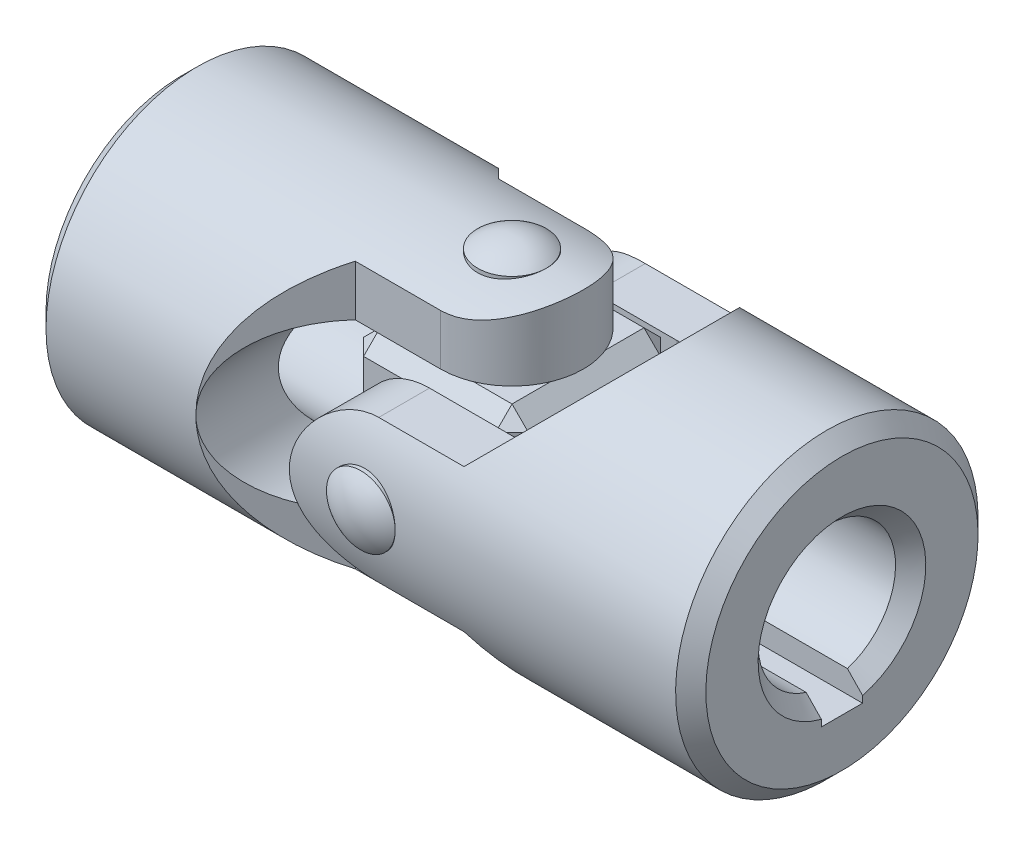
ISO-10303-21;
HEADER;
FILE_DESCRIPTION(('STEP AP214'),'2;1');
FILE_NAME('part.step','',(''),(''),'','','');
FILE_SCHEMA(('AUTOMOTIVE_DESIGN { 1 0 10303 214 1 1 1 1 }'));
ENDSEC;
DATA;
#1=APPLICATION_CONTEXT('core data for automotive mechanical design processes');
#2=APPLICATION_PROTOCOL_DEFINITION('international standard','automotive_design',2000,#1);
#3=PRODUCT_CONTEXT('',#1,'mechanical');
#4=PRODUCT('Part','Part','',(#3));
#5=PRODUCT_RELATED_PRODUCT_CATEGORY('part','',(#4));
#6=PRODUCT_DEFINITION_FORMATION('','',#4);
#7=PRODUCT_DEFINITION_CONTEXT('part definition',#1,'design');
#8=PRODUCT_DEFINITION('design','',#6,#7);
#9=PRODUCT_DEFINITION_SHAPE('','',#8);
#10=(LENGTH_UNIT() NAMED_UNIT(*) SI_UNIT(.MILLI.,.METRE.));
#11=(NAMED_UNIT(*) PLANE_ANGLE_UNIT() SI_UNIT($,.RADIAN.));
#12=(NAMED_UNIT(*) SI_UNIT($,.STERADIAN.) SOLID_ANGLE_UNIT());
#13=UNCERTAINTY_MEASURE_WITH_UNIT(LENGTH_MEASURE(1.E-05),#10,'distance_accuracy_value','');
#14=(GEOMETRIC_REPRESENTATION_CONTEXT(3) GLOBAL_UNCERTAINTY_ASSIGNED_CONTEXT((#13)) GLOBAL_UNIT_ASSIGNED_CONTEXT((#10,
#11,#12)) REPRESENTATION_CONTEXT('',''));
#15=CARTESIAN_POINT('',(0.,0.,0.));
#16=DIRECTION('',(0.,0.,1.));
#17=DIRECTION('',(1.,0.,0.));
#18=AXIS2_PLACEMENT_3D('',#15,#16,#17);
#19=CARTESIAN_POINT('',(0.,11.,0.));
#20=DIRECTION('',(0.,-1.,0.));
#21=DIRECTION('',(-1.,0.,0.));
#22=AXIS2_PLACEMENT_3D('',#19,#20,#21);
#23=CYLINDRICAL_SURFACE('',#22,2.5);
#24=CARTESIAN_POINT('',(0.,11.,0.));
#25=DIRECTION('',(0.,1.,0.));
#26=DIRECTION('',(1.,0.,0.));
#27=AXIS2_PLACEMENT_3D('',#24,#25,#26);
#28=CIRCLE('',#27,2.5);
#29=CARTESIAN_POINT('',(2.5,11.,0.));
#30=VERTEX_POINT('',#29);
#31=EDGE_CURVE('P0_E10',#30,#30,#28,.T.);
#32=ORIENTED_EDGE('',*,*,#31,.F.);
#33=EDGE_LOOP('',(#32));
#34=FACE_BOUND('',#33,.T.);
#35=CARTESIAN_POINT('',(0.,-11.,0.));
#36=DIRECTION('',(0.,-1.,0.));
#37=DIRECTION('',(0.,0.,-1.));
#38=AXIS2_PLACEMENT_3D('',#35,#36,#37);
#39=CIRCLE('',#38,2.5);
#40=CARTESIAN_POINT('',(0.,-11.,-2.5));
#41=VERTEX_POINT('',#40);
#42=EDGE_CURVE('P0_E20',#41,#41,#39,.T.);
#43=ORIENTED_EDGE('',*,*,#42,.F.);
#44=EDGE_LOOP('',(#43));
#45=FACE_BOUND('',#44,.T.);
#46=ADVANCED_FACE('P0_F14',(#34,#45),#23,.T.);
#47=CARTESIAN_POINT('',(0.,7.88886363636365,0.));
#48=DIRECTION('',(0.,-1.,0.));
#49=DIRECTION('',(0.,0.,-1.));
#50=AXIS2_PLACEMENT_3D('',#47,#48,#49);
#51=SPHERICAL_SURFACE('',#50,3.99113636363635);
#52=ORIENTED_EDGE('',*,*,#31,.T.);
#53=EDGE_LOOP('',(#52));
#54=FACE_BOUND('',#53,.T.);
#55=ADVANCED_FACE('P0_F29',(#54),#51,.T.);
#56=CARTESIAN_POINT('',(0.,-7.88886363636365,0.));
#57=DIRECTION('',(0.,1.,0.));
#58=DIRECTION('',(0.,0.,-1.));
#59=AXIS2_PLACEMENT_3D('',#56,#57,#58);
#60=SPHERICAL_SURFACE('',#59,3.99113636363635);
#61=ORIENTED_EDGE('',*,*,#42,.T.);
#62=EDGE_LOOP('',(#61));
#63=FACE_BOUND('',#62,.T.);
#64=ADVANCED_FACE('P0_F26',(#63),#60,.T.);
#65=CLOSED_SHELL('',(#46,#55,#64));
#66=MANIFOLD_SOLID_BREP('P0_B1',#65);
#67=CARTESIAN_POINT('',(0.,0.,11.));
#68=DIRECTION('',(0.,0.,-1.));
#69=DIRECTION('',(-1.,0.,0.));
#70=AXIS2_PLACEMENT_3D('',#67,#68,#69);
#71=CYLINDRICAL_SURFACE('',#70,2.5);
#72=CARTESIAN_POINT('',(0.,0.,11.));
#73=DIRECTION('',(0.,0.,1.));
#74=DIRECTION('',(1.,0.,0.));
#75=AXIS2_PLACEMENT_3D('',#72,#73,#74);
#76=CIRCLE('',#75,2.5);
#77=CARTESIAN_POINT('',(2.5,0.,11.));
#78=VERTEX_POINT('',#77);
#79=EDGE_CURVE('P1_E10',#78,#78,#76,.T.);
#80=ORIENTED_EDGE('',*,*,#79,.F.);
#81=EDGE_LOOP('',(#80));
#82=FACE_BOUND('',#81,.T.);
#83=CARTESIAN_POINT('',(0.,0.,-11.));
#84=DIRECTION('',(0.,0.,-1.));
#85=DIRECTION('',(0.,1.,0.));
#86=AXIS2_PLACEMENT_3D('',#83,#84,#85);
#87=CIRCLE('',#86,2.5);
#88=CARTESIAN_POINT('',(0.,2.5,-11.));
#89=VERTEX_POINT('',#88);
#90=EDGE_CURVE('P1_E20',#89,#89,#87,.T.);
#91=ORIENTED_EDGE('',*,*,#90,.F.);
#92=EDGE_LOOP('',(#91));
#93=FACE_BOUND('',#92,.T.);
#94=ADVANCED_FACE('P1_F14',(#82,#93),#71,.T.);
#95=CARTESIAN_POINT('',(0.,0.,7.88886363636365));
#96=DIRECTION('',(0.,0.,-1.));
#97=DIRECTION('',(0.,1.,0.));
#98=AXIS2_PLACEMENT_3D('',#95,#96,#97);
#99=SPHERICAL_SURFACE('',#98,3.99113636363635);
#100=ORIENTED_EDGE('',*,*,#79,.T.);
#101=EDGE_LOOP('',(#100));
#102=FACE_BOUND('',#101,.T.);
#103=ADVANCED_FACE('P1_F29',(#102),#99,.T.);
#104=CARTESIAN_POINT('',(0.,0.,-7.88886363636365));
#105=DIRECTION('',(0.,0.,1.));
#106=DIRECTION('',(0.,1.,0.));
#107=AXIS2_PLACEMENT_3D('',#104,#105,#106);
#108=SPHERICAL_SURFACE('',#107,3.99113636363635);
#109=ORIENTED_EDGE('',*,*,#90,.T.);
#110=EDGE_LOOP('',(#109));
#111=FACE_BOUND('',#110,.T.);
#112=ADVANCED_FACE('P1_F26',(#111),#108,.T.);
#113=CLOSED_SHELL('',(#94,#103,#112));
#114=MANIFOLD_SOLID_BREP('P1_B1',#113);
#115=CARTESIAN_POINT('',(0.,-11.,-5.2));
#116=DIRECTION('',(0.,0.,1.));
#117=DIRECTION('',(1.,0.,0.));
#118=AXIS2_PLACEMENT_3D('',#115,#116,#117);
#119=PLANE('',#118);
#120=DIRECTION('',(0.,1.,0.));
#121=VECTOR('',#120,1.);
#122=CARTESIAN_POINT('',(0.,-11.,-5.2));
#123=LINE('',#122,#121);
#124=CARTESIAN_POINT('',(0.,6.,-5.2));
#125=VERTEX_POINT('',#124);
#126=CARTESIAN_POINT('',(0.,9.69329665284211,-5.2));
#127=VERTEX_POINT('',#126);
#128=EDGE_CURVE('P2_E349',#125,#127,#123,.T.);
#129=ORIENTED_EDGE('',*,*,#128,.F.);
#130=DIRECTION('',(-1.,0.,0.));
#131=VECTOR('',#130,1.);
#132=CARTESIAN_POINT('',(0.,6.,-5.2));
#133=LINE('',#132,#131);
#134=CARTESIAN_POINT('',(-6.,6.,-5.2));
#135=VERTEX_POINT('',#134);
#136=EDGE_CURVE('P2_E179',#125,#135,#133,.T.);
#137=ORIENTED_EDGE('',*,*,#136,.T.);
#138=CARTESIAN_POINT('',(-6.00000000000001,0.,-5.2));
#139=DIRECTION('',(0.,0.,1.));
#140=DIRECTION('',(1.,0.,0.));
#141=AXIS2_PLACEMENT_3D('',#138,#139,#140);
#142=CIRCLE('',#141,6.);
#143=CARTESIAN_POINT('',(-6.20000000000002,5.99666574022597,-5.2));
#144=VERTEX_POINT('',#143);
#145=EDGE_CURVE('P2_E196',#135,#144,#142,.T.);
#146=ORIENTED_EDGE('',*,*,#145,.T.);
#147=DIRECTION('',(0.,1.,0.));
#148=VECTOR('',#147,1.);
#149=CARTESIAN_POINT('',(-6.20000000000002,-11.,-5.2));
#150=LINE('',#149,#148);
#151=CARTESIAN_POINT('',(-6.20000000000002,9.6932966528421,-5.2));
#152=VERTEX_POINT('',#151);
#153=EDGE_CURVE('P2_E356',#144,#152,#150,.T.);
#154=ORIENTED_EDGE('',*,*,#153,.T.);
#155=DIRECTION('',(1.,0.,0.));
#156=VECTOR('',#155,1.);
#157=CARTESIAN_POINT('',(-24.,9.69329665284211,-5.19999999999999));
#158=LINE('',#157,#156);
#159=EDGE_CURVE('P2_E283',#127,#152,#158,.F.);
#160=ORIENTED_EDGE('',*,*,#159,.F.);
#161=EDGE_LOOP('',(#129,#137,#146,#154,#160));
#162=FACE_BOUND('',#161,.T.);
#163=ADVANCED_FACE('P2_F16',(#162),#119,.F.);
#164=CARTESIAN_POINT('',(-6.20000000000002,-11.,-5.2));
#165=DIRECTION('',(-0.707106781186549,0.,0.707106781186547));
#166=DIRECTION('',(0.707106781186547,0.,0.707106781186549));
#167=AXIS2_PLACEMENT_3D('',#164,#165,#166);
#168=PLANE('',#167);
#169=CARTESIAN_POINT('',(-1.00000000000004,0.,0.));
#170=DIRECTION('',(-0.707106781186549,0.,0.707106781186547));
#171=DIRECTION('',(0.707106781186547,0.,0.707106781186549));
#172=AXIS2_PLACEMENT_3D('',#169,#170,#171);
#173=ELLIPSE('',#172,15.556349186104,11.);
#174=CARTESIAN_POINT('',(-12.,0.,-11.));
#175=VERTEX_POINT('',#174);
#176=CARTESIAN_POINT('',(-6.20000000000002,-9.69329665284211,-5.2));
#177=VERTEX_POINT('',#176);
#178=EDGE_CURVE('P2_E286',#175,#177,#173,.T.);
#179=ORIENTED_EDGE('',*,*,#178,.F.);
#180=CARTESIAN_POINT('',(-6.00000000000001,0.,-4.99999999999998));
#181=DIRECTION('',(-0.707106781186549,0.,0.707106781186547));
#182=DIRECTION('',(-0.707106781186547,0.,-0.707106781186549));
#183=AXIS2_PLACEMENT_3D('',#180,#181,#182);
#184=ELLIPSE('',#183,8.48528137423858,6.);
#185=CARTESIAN_POINT('',(-6.20000000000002,-5.99666574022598,-5.2));
#186=VERTEX_POINT('',#185);
#187=EDGE_CURVE('P2_E192',#175,#186,#184,.T.);
#188=ORIENTED_EDGE('',*,*,#187,.T.);
#189=EDGE_CURVE('P2_E353',#177,#186,#150,.T.);
#190=ORIENTED_EDGE('',*,*,#189,.F.);
#191=EDGE_LOOP('',(#179,#188,#190));
#192=FACE_BOUND('',#191,.T.);
#193=ADVANCED_FACE('P2_F234',(#192),#168,.F.);
#194=CARTESIAN_POINT('',(-6.20000000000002,-11.,5.2));
#195=DIRECTION('',(-0.707106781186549,0.,-0.707106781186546));
#196=DIRECTION('',(-0.707106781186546,0.,0.707106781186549));
#197=AXIS2_PLACEMENT_3D('',#194,#195,#196);
#198=PLANE('',#197);
#199=DIRECTION('',(0.,1.,0.));
#200=VECTOR('',#199,1.);
#201=CARTESIAN_POINT('',(-6.20000000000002,-11.,5.2));
#202=LINE('',#201,#200);
#203=CARTESIAN_POINT('',(-6.20000000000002,-9.69329665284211,5.2));
#204=VERTEX_POINT('',#203);
#205=CARTESIAN_POINT('',(-6.20000000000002,-5.99666574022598,5.2));
#206=VERTEX_POINT('',#205);
#207=EDGE_CURVE('P2_E359',#204,#206,#202,.T.);
#208=ORIENTED_EDGE('',*,*,#207,.T.);
#209=CARTESIAN_POINT('',(-6.00000000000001,0.,4.99999999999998));
#210=DIRECTION('',(-0.707106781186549,0.,-0.707106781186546));
#211=DIRECTION('',(0.707106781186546,0.,-0.707106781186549));
#212=AXIS2_PLACEMENT_3D('',#209,#210,#211);
#213=ELLIPSE('',#212,8.48528137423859,6.);
#214=CARTESIAN_POINT('',(-12.,0.,11.));
#215=VERTEX_POINT('',#214);
#216=EDGE_CURVE('P2_E185',#206,#215,#213,.T.);
#217=ORIENTED_EDGE('',*,*,#216,.T.);
#218=CARTESIAN_POINT('',(-1.00000000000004,0.,0.));
#219=DIRECTION('',(-0.707106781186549,0.,-0.707106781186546));
#220=DIRECTION('',(0.707106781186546,0.,-0.707106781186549));
#221=AXIS2_PLACEMENT_3D('',#218,#219,#220);
#222=ELLIPSE('',#221,15.556349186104,11.);
#223=EDGE_CURVE('P2_E297',#204,#215,#222,.T.);
#224=ORIENTED_EDGE('',*,*,#223,.F.);
#225=EDGE_LOOP('',(#208,#217,#224));
#226=FACE_BOUND('',#225,.T.);
#227=ADVANCED_FACE('P2_F239',(#226),#198,.F.);
#228=CARTESIAN_POINT('',(0.,-11.,5.2));
#229=DIRECTION('',(0.,0.,-1.));
#230=DIRECTION('',(-1.,0.,0.));
#231=AXIS2_PLACEMENT_3D('',#228,#229,#230);
#232=PLANE('',#231);
#233=CARTESIAN_POINT('',(-6.00000000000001,0.,5.2));
#234=DIRECTION('',(0.,0.,-1.));
#235=DIRECTION('',(-1.,0.,0.));
#236=AXIS2_PLACEMENT_3D('',#233,#234,#235);
#237=CIRCLE('',#236,6.);
#238=CARTESIAN_POINT('',(-6.20000000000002,5.99666574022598,5.2));
#239=VERTEX_POINT('',#238);
#240=CARTESIAN_POINT('',(-6.,6.,5.2));
#241=VERTEX_POINT('',#240);
#242=EDGE_CURVE('P2_E311',#239,#241,#237,.T.);
#243=ORIENTED_EDGE('',*,*,#242,.T.);
#244=DIRECTION('',(1.,0.,0.));
#245=VECTOR('',#244,1.);
#246=CARTESIAN_POINT('',(0.,6.,5.2));
#247=LINE('',#246,#245);
#248=CARTESIAN_POINT('',(0.,6.,5.2));
#249=VERTEX_POINT('',#248);
#250=EDGE_CURVE('P2_E176',#241,#249,#247,.T.);
#251=ORIENTED_EDGE('',*,*,#250,.T.);
#252=DIRECTION('',(0.,1.,0.));
#253=VECTOR('',#252,1.);
#254=CARTESIAN_POINT('',(0.,-11.,5.2));
#255=LINE('',#254,#253);
#256=CARTESIAN_POINT('',(0.,9.69329665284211,5.2));
#257=VERTEX_POINT('',#256);
#258=EDGE_CURVE('P2_E204',#249,#257,#255,.T.);
#259=ORIENTED_EDGE('',*,*,#258,.T.);
#260=DIRECTION('',(1.,0.,0.));
#261=VECTOR('',#260,1.);
#262=CARTESIAN_POINT('',(-24.,9.69329665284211,5.2));
#263=LINE('',#262,#261);
#264=CARTESIAN_POINT('',(-6.20000000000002,9.69329665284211,5.2));
#265=VERTEX_POINT('',#264);
#266=EDGE_CURVE('P2_E300',#265,#257,#263,.T.);
#267=ORIENTED_EDGE('',*,*,#266,.F.);
#268=EDGE_CURVE('P2_E361',#239,#265,#202,.T.);
#269=ORIENTED_EDGE('',*,*,#268,.F.);
#270=EDGE_LOOP('',(#243,#251,#259,#267,#269));
#271=FACE_BOUND('',#270,.T.);
#272=ADVANCED_FACE('P2_F243',(#271),#232,.F.);
#273=CARTESIAN_POINT('',(0.,-11.,0.));
#274=DIRECTION('',(0.,1.,0.));
#275=DIRECTION('',(0.,0.,-1.));
#276=AXIS2_PLACEMENT_3D('',#273,#274,#275);
#277=CYLINDRICAL_SURFACE('',#276,5.2);
#278=ORIENTED_EDGE('',*,*,#258,.F.);
#279=CARTESIAN_POINT('',(0.,6.,0.));
#280=DIRECTION('',(0.,1.,0.));
#281=DIRECTION('',(1.,0.,0.));
#282=AXIS2_PLACEMENT_3D('',#279,#280,#281);
#283=CIRCLE('',#282,5.2);
#284=EDGE_CURVE('P2_E305',#249,#125,#283,.T.);
#285=ORIENTED_EDGE('',*,*,#284,.T.);
#286=ORIENTED_EDGE('',*,*,#128,.T.);
#287=CARTESIAN_POINT('',(0.,9.69329665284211,5.2));
#288=CARTESIAN_POINT('',(0.137285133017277,9.69325927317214,5.20002455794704));
#289=CARTESIAN_POINT('',(0.274553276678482,9.69621198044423,5.19456447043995));
#290=CARTESIAN_POINT('',(0.547919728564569,9.70782011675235,5.17286231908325));
#291=CARTESIAN_POINT('',(0.684018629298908,9.71647246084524,5.15662608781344));
#292=CARTESIAN_POINT('',(0.95335971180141,9.73914389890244,5.11367052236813));
#293=CARTESIAN_POINT('',(1.08661306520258,9.7531348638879,5.0870061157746));
#294=CARTESIAN_POINT('',(1.35006536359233,9.78599003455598,5.02351307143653));
#295=CARTESIAN_POINT('',(1.48026400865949,9.80485471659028,4.98668344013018));
#296=CARTESIAN_POINT('',(1.73651432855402,9.8468033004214,4.90332855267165));
#297=CARTESIAN_POINT('',(1.8625740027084,9.86987841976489,4.8568234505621));
#298=CARTESIAN_POINT('',(2.11014776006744,9.91957630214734,4.75449705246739));
#299=CARTESIAN_POINT('',(2.23166009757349,9.94620041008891,4.69867222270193));
#300=CARTESIAN_POINT('',(2.58865543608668,10.0303390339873,4.51774231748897));
#301=CARTESIAN_POINT('',(2.8164985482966,10.0921028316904,4.37921408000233));
#302=CARTESIAN_POINT('',(3.26303971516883,10.2253906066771,4.05877180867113));
#303=CARTESIAN_POINT('',(3.47987046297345,10.2972976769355,3.87443675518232));
#304=CARTESIAN_POINT('',(3.88104241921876,10.4396991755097,3.47246473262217));
#305=CARTESIAN_POINT('',(4.06537549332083,10.5101932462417,3.25481945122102));
#306=CARTESIAN_POINT('',(4.31887289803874,10.6116076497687,2.90003488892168));
#307=CARTESIAN_POINT('',(4.40144852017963,10.6455560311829,2.77313315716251));
#308=CARTESIAN_POINT('',(4.5555241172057,10.7101775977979,2.5120008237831));
#309=CARTESIAN_POINT('',(4.62702842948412,10.7408520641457,2.37777312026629));
#310=CARTESIAN_POINT('',(4.75827033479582,10.7980391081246,2.10287048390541));
#311=CARTESIAN_POINT('',(4.81801043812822,10.8245525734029,1.96219693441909));
#312=CARTESIAN_POINT('',(4.92508877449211,10.8726357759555,1.67538711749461));
#313=CARTESIAN_POINT('',(4.97242816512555,10.8942059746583,1.52925136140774));
#314=CARTESIAN_POINT('',(5.05147547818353,10.9305194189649,1.24229233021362));
#315=CARTESIAN_POINT('',(5.08399677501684,10.9456141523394,1.10173734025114));
#316=CARTESIAN_POINT('',(5.13729342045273,10.9704706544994,0.817957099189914));
#317=CARTESIAN_POINT('',(5.15806977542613,10.9802328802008,0.674732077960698));
#318=CARTESIAN_POINT('',(5.187609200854,10.99414022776,0.386835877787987));
#319=CARTESIAN_POINT('',(5.19637719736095,10.9982876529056,0.242165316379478));
#320=CARTESIAN_POINT('',(5.20179985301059,11.0008506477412,-0.0474500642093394));
#321=CARTESIAN_POINT('',(5.19845515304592,10.9992665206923,-0.192394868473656));
#322=CARTESIAN_POINT('',(5.18043423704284,10.9907617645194,-0.470011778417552));
#323=CARTESIAN_POINT('',(5.16666485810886,10.9842682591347,-0.60275700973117));
#324=CARTESIAN_POINT('',(5.12902280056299,10.9666129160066,-0.86653385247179));
#325=CARTESIAN_POINT('',(5.1051469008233,10.9554495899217,-0.997564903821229));
#326=CARTESIAN_POINT('',(5.04754753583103,10.9287274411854,-1.25694073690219));
#327=CARTESIAN_POINT('',(5.01382753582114,10.9131701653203,-1.38528644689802));
#328=CARTESIAN_POINT('',(4.93687318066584,10.8780309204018,-1.63854477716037));
#329=CARTESIAN_POINT('',(4.89363518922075,10.8584474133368,-1.76345606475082));
#330=CARTESIAN_POINT('',(4.74881982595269,10.7936867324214,-2.13542747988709));
#331=CARTESIAN_POINT('',(4.63294669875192,10.7428870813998,-2.37612329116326));
#332=CARTESIAN_POINT('',(4.36720139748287,10.6309910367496,-2.83514664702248));
#333=CARTESIAN_POINT('',(4.21731623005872,10.5698907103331,-3.05346559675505));
#334=CARTESIAN_POINT('',(3.8728028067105,10.4370092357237,-3.48186110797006));
#335=CARTESIAN_POINT('',(3.67542157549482,10.3647613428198,-3.68958094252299));
#336=CARTESIAN_POINT('',(3.24880946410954,10.2212770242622,-4.0702531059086));
#337=CARTESIAN_POINT('',(3.01955504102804,10.1500413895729,-4.24317950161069));
#338=CARTESIAN_POINT('',(2.64908020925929,10.0480099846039,-4.47719536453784));
#339=CARTESIAN_POINT('',(2.51751455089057,10.0140244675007,-4.5524934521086));
#340=CARTESIAN_POINT('',(2.24763801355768,9.94960944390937,-4.69160309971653));
#341=CARTESIAN_POINT('',(2.10933012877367,9.91917837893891,-4.75541970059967));
#342=CARTESIAN_POINT('',(1.82705012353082,9.86301283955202,-4.87084180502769));
#343=CARTESIAN_POINT('',(1.68308751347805,9.83727085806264,-4.922466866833));
#344=CARTESIAN_POINT('',(1.39041843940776,9.79144379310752,-5.01300298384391));
#345=CARTESIAN_POINT('',(1.24171408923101,9.7713562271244,-5.05191961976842));
#346=CARTESIAN_POINT('',(0.912815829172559,9.73457266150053,-5.12249906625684));
#347=CARTESIAN_POINT('',(0.731882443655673,9.71919007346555,-5.15149104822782));
#348=CARTESIAN_POINT('',(0.458549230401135,9.70370762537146,-5.18055614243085));
#349=CARTESIAN_POINT('',(0.36706241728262,9.69981199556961,-5.18784072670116));
#350=CARTESIAN_POINT('',(0.1837254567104,9.6946038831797,-5.19756406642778));
#351=CARTESIAN_POINT('',(0.0918751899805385,9.69329233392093,-5.20000107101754));
#352=CARTESIAN_POINT('',(0.,9.69329665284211,-5.2));
#353=B_SPLINE_CURVE_WITH_KNOTS('',3,(#287,#288,#289,#290,#291,#292,#293,#294,#295,#296,#297,
#298,#299,#300,#301,#302,#303,#304,#305,#306,#307,#308,#309,#310,#311,#312,#313,#314,#315,#316,
#317,#318,#319,#320,#321,#322,#323,#324,#325,#326,#327,#328,#329,#330,#331,#332,#333,#334,#335,
#336,#337,#338,#339,#340,#341,#342,#343,#344,#345,#346,#347,#348,#349,#350,#351,#352),
.UNSPECIFIED.,.F.,.F.,(4,2,2,2,2,2,2,2,2,2,2,2,2,2,2,2,2,2,2,2,2,2,2,2,2,2,2,2,2,2,2,2,4),(0.,
0.411688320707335,0.82315399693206,1.2324809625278,1.64184795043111,2.0503706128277,
2.459048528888,3.27671515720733,4.15379218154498,5.03108843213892,5.49607293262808,
5.96087480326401,6.42557738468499,6.8902365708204,7.32482324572,7.7593726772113,
8.19374379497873,8.6280919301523,9.02846455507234,9.4289648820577,9.82932439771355,
10.2298371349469,11.0418659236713,11.8542054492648,12.7369930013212,13.6204361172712,
14.0859833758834,14.5513257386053,15.0159164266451,15.4803028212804,16.0305352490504,
16.3059707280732,16.5815056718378),.UNSPECIFIED.);
#354=EDGE_CURVE('P2_E258',#257,#127,#353,.T.);
#355=ORIENTED_EDGE('',*,*,#354,.F.);
#356=EDGE_LOOP('',(#278,#285,#286,#355));
#357=FACE_BOUND('',#356,.T.);
#358=ADVANCED_FACE('P2_F247',(#357),#277,.T.);
#359=CARTESIAN_POINT('',(-24.,0.,0.));
#360=DIRECTION('',(-1.,0.,0.));
#361=DIRECTION('',(0.,0.,1.));
#362=AXIS2_PLACEMENT_3D('',#359,#360,#361);
#363=PLANE('',#362);
#364=DIRECTION('',(0.,0.,1.));
#365=VECTOR('',#364,1.);
#366=CARTESIAN_POINT('',(-24.,-1.5,-6.4));
#367=LINE('',#366,#365);
#368=CARTESIAN_POINT('',(-24.,-1.5,-6.4));
#369=VERTEX_POINT('',#368);
#370=CARTESIAN_POINT('',(-24.,-1.5,-5.91269819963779));
#371=VERTEX_POINT('',#370);
#372=EDGE_CURVE('P2_E139',#369,#371,#367,.T.);
#373=ORIENTED_EDGE('',*,*,#372,.F.);
#374=DIRECTION('',(0.,-1.,0.));
#375=VECTOR('',#374,1.);
#376=CARTESIAN_POINT('',(-24.,-1.5,-6.4));
#377=LINE('',#376,#375);
#378=CARTESIAN_POINT('',(-24.,1.5,-6.4));
#379=VERTEX_POINT('',#378);
#380=EDGE_CURVE('P2_E135',#379,#369,#377,.T.);
#381=ORIENTED_EDGE('',*,*,#380,.F.);
#382=DIRECTION('',(0.,0.,-1.));
#383=VECTOR('',#382,1.);
#384=CARTESIAN_POINT('',(-24.,1.5,-6.4));
#385=LINE('',#384,#383);
#386=CARTESIAN_POINT('',(-24.,1.5,-5.91269819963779));
#387=VERTEX_POINT('',#386);
#388=EDGE_CURVE('P2_E142',#387,#379,#385,.T.);
#389=ORIENTED_EDGE('',*,*,#388,.F.);
#390=CARTESIAN_POINT('',(-24.,0.,0.));
#391=DIRECTION('',(-1.,0.,0.));
#392=DIRECTION('',(0.,0.,1.));
#393=AXIS2_PLACEMENT_3D('',#390,#391,#392);
#394=CIRCLE('',#393,6.1);
#395=EDGE_CURVE('P2_E318',#387,#371,#394,.F.);
#396=ORIENTED_EDGE('',*,*,#395,.T.);
#397=EDGE_LOOP('',(#373,#381,#389,#396));
#398=FACE_BOUND('',#397,.T.);
#399=CARTESIAN_POINT('',(-24.,0.,0.));
#400=DIRECTION('',(-1.,0.,0.));
#401=DIRECTION('',(0.,0.,1.));
#402=AXIS2_PLACEMENT_3D('',#399,#400,#401);
#403=CIRCLE('',#402,9.89999999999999);
#404=CARTESIAN_POINT('',(-24.,0.,9.89999999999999));
#405=VERTEX_POINT('',#404);
#406=EDGE_CURVE('P2_E315',#405,#405,#403,.T.);
#407=ORIENTED_EDGE('',*,*,#406,.T.);
#408=EDGE_LOOP('',(#407));
#409=FACE_BOUND('',#408,.T.);
#410=ADVANCED_FACE('P2_F149',(#398,#409),#363,.T.);
#411=CARTESIAN_POINT('',(-24.,0.,0.));
#412=DIRECTION('',(1.,0.,0.));
#413=DIRECTION('',(0.,0.,-1.));
#414=AXIS2_PLACEMENT_3D('',#411,#412,#413);
#415=CYLINDRICAL_SURFACE('',#414,11.);
#416=CARTESIAN_POINT('',(-22.9,0.,0.));
#417=DIRECTION('',(-1.,0.,0.));
#418=DIRECTION('',(0.,0.,1.));
#419=AXIS2_PLACEMENT_3D('',#416,#417,#418);
#420=CIRCLE('',#419,11.);
#421=CARTESIAN_POINT('',(-22.9,0.,11.));
#422=VERTEX_POINT('',#421);
#423=EDGE_CURVE('P2_E320',#422,#422,#420,.F.);
#424=ORIENTED_EDGE('',*,*,#423,.T.);
#425=EDGE_LOOP('',(#424));
#426=FACE_BOUND('',#425,.T.);
#427=CARTESIAN_POINT('',(2.5,-11.,0.));
#428=CARTESIAN_POINT('',(2.49999546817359,-10.9999974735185,-0.138518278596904));
#429=CARTESIAN_POINT('',(2.48844877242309,-10.9973570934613,-0.277090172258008));
#430=CARTESIAN_POINT('',(2.44262052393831,-10.987079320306,-0.550288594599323));
#431=CARTESIAN_POINT('',(2.40832360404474,-10.9794385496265,-0.68491239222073));
#432=CARTESIAN_POINT('',(2.31813195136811,-10.9600095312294,-0.946227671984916));
#433=CARTESIAN_POINT('',(2.26226067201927,-10.9482257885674,-1.07292759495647));
#434=CARTESIAN_POINT('',(2.13058288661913,-10.921778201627,-1.31515227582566));
#435=CARTESIAN_POINT('',(2.05477657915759,-10.9071143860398,-1.43067714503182));
#436=CARTESIAN_POINT('',(1.88399795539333,-10.8762265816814,-1.64926760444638));
#437=CARTESIAN_POINT('',(1.78874742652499,-10.8599819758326,-1.75211293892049));
#438=CARTESIAN_POINT('',(1.58238102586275,-10.827906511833,-1.9405138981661));
#439=CARTESIAN_POINT('',(1.47126364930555,-10.8120756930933,-2.02606788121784));
#440=CARTESIAN_POINT('',(1.23466794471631,-10.7824158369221,-2.17844599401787));
#441=CARTESIAN_POINT('',(1.10903300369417,-10.7686131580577,-2.24503254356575));
#442=CARTESIAN_POINT('',(0.847990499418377,-10.7448696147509,-2.3560606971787));
#443=CARTESIAN_POINT('',(0.71258420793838,-10.7349282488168,-2.40050517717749));
#444=CARTESIAN_POINT('',(0.438240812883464,-10.7202434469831,-2.46525349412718));
#445=CARTESIAN_POINT('',(0.299400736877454,-10.715415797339,-2.48594892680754));
#446=CARTESIAN_POINT('',(0.0201417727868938,-10.7112523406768,-2.50382988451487));
#447=CARTESIAN_POINT('',(-0.120276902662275,-10.711915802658,-2.50101853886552));
#448=CARTESIAN_POINT('',(-0.395772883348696,-10.7185835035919,-2.47228016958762));
#449=CARTESIAN_POINT('',(-0.53090090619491,-10.7244819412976,-2.44681104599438));
#450=CARTESIAN_POINT('',(-0.794914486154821,-10.7407873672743,-2.37420684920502));
#451=CARTESIAN_POINT('',(-0.923799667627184,-10.7511946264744,-2.32707047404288));
#452=CARTESIAN_POINT('',(-1.17294067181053,-10.7754474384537,-2.21205734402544));
#453=CARTESIAN_POINT('',(-1.29311351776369,-10.7893215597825,-2.14400712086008));
#454=CARTESIAN_POINT('',(-1.52050255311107,-10.8189276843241,-1.98921977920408));
#455=CARTESIAN_POINT('',(-1.62771684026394,-10.8346599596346,-1.90247992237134));
#456=CARTESIAN_POINT('',(-1.82877856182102,-10.8666615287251,-1.71036518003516));
#457=CARTESIAN_POINT('',(-1.92225442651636,-10.882934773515,-1.60460166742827));
#458=CARTESIAN_POINT('',(-2.09020588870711,-10.9138502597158,-1.37871229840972));
#459=CARTESIAN_POINT('',(-2.16468108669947,-10.9284924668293,-1.2585861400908));
#460=CARTESIAN_POINT('',(-2.2926203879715,-10.9545497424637,-1.00690799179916));
#461=CARTESIAN_POINT('',(-2.34603277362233,-10.9659568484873,-0.875328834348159));
#462=CARTESIAN_POINT('',(-2.42988400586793,-10.9841998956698,-0.604745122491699));
#463=CARTESIAN_POINT('',(-2.46032646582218,-10.9910365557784,-0.465741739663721));
#464=CARTESIAN_POINT('',(-2.49682623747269,-10.9992650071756,-0.187439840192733));
#465=CARTESIAN_POINT('',(-2.50339069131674,-11.0007700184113,-0.0482110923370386));
#466=CARTESIAN_POINT('',(-2.49332696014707,-10.9984842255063,0.229353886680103));
#467=CARTESIAN_POINT('',(-2.47670048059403,-10.9946938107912,0.367690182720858));
#468=CARTESIAN_POINT('',(-2.42114683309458,-10.9823148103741,0.637841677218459));
#469=CARTESIAN_POINT('',(-2.38248845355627,-10.973784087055,0.769715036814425));
#470=CARTESIAN_POINT('',(-2.28426897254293,-10.9528806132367,1.0251039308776));
#471=CARTESIAN_POINT('',(-2.22470599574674,-10.9405075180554,1.14861871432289));
#472=CARTESIAN_POINT('',(-2.08533085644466,-10.9130143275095,1.38586085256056));
#473=CARTESIAN_POINT('',(-2.00522437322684,-10.8978552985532,1.49941068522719));
#474=CARTESIAN_POINT('',(-1.8274206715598,-10.866546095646,1.71163773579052));
#475=CARTESIAN_POINT('',(-1.72972097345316,-10.8503957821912,1.8103128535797));
#476=CARTESIAN_POINT('',(-1.51716903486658,-10.8185287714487,1.99201706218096));
#477=CARTESIAN_POINT('',(-1.40201275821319,-10.8028272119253,2.07469366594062));
#478=CARTESIAN_POINT('',(-1.15915360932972,-10.7740023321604,2.21953814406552));
#479=CARTESIAN_POINT('',(-1.03145129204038,-10.7608788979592,2.28170692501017));
#480=CARTESIAN_POINT('',(-0.767819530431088,-10.7388274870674,2.38333597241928));
#481=CARTESIAN_POINT('',(-0.631942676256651,-10.7298753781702,2.42292716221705));
#482=CARTESIAN_POINT('',(-0.355233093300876,-10.7171411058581,2.47865258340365));
#483=CARTESIAN_POINT('',(-0.214401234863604,-10.7133580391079,2.49479091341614));
#484=CARTESIAN_POINT('',(0.064658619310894,-10.7114502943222,2.50296739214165));
#485=CARTESIAN_POINT('',(0.202869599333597,-10.7131941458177,2.4955654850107));
#486=CARTESIAN_POINT('',(0.476018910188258,-10.7218446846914,2.45813115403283));
#487=CARTESIAN_POINT('',(0.610957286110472,-10.7287513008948,2.42809904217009));
#488=CARTESIAN_POINT('',(0.873243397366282,-10.7468826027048,2.34653692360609));
#489=CARTESIAN_POINT('',(1.0006196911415,-10.758089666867,2.29509457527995));
#490=CARTESIAN_POINT('',(1.24501470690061,-10.783564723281,2.1722453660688));
#491=CARTESIAN_POINT('',(1.36203225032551,-10.7978330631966,2.10083623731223));
#492=CARTESIAN_POINT('',(1.58513442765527,-10.828211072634,1.93824996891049));
#493=CARTESIAN_POINT('',(1.69092572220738,-10.8443540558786,1.84667645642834));
#494=CARTESIAN_POINT('',(1.88582318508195,-10.8764454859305,1.64715628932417));
#495=CARTESIAN_POINT('',(1.97492547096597,-10.8923938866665,1.53920583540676));
#496=CARTESIAN_POINT('',(2.13513806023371,-10.9225693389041,1.30814060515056));
#497=CARTESIAN_POINT('',(2.20597382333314,-10.9367686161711,1.1848316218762));
#498=CARTESIAN_POINT('',(2.32579997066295,-10.9615640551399,0.927755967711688));
#499=CARTESIAN_POINT('',(2.37480799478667,-10.9721631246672,0.793997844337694));
#500=CARTESIAN_POINT('',(2.44122790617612,-10.9867559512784,0.550163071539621));
#501=CARTESIAN_POINT('',(2.46322398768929,-10.9916908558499,0.441368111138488));
#502=CARTESIAN_POINT('',(2.49261147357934,-10.9983138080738,0.221726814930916));
#503=CARTESIAN_POINT('',(2.50000362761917,-11.0000020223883,0.110880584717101));
#504=CARTESIAN_POINT('',(2.5,-11.,0.));
#505=B_SPLINE_CURVE_WITH_KNOTS('',3,(#427,#428,#429,#430,#431,#432,#433,#434,#435,#436,#437,
#438,#439,#440,#441,#442,#443,#444,#445,#446,#447,#448,#449,#450,#451,#452,#453,#454,#455,#456,
#457,#458,#459,#460,#461,#462,#463,#464,#465,#466,#467,#468,#469,#470,#471,#472,#473,#474,#475,
#476,#477,#478,#479,#480,#481,#482,#483,#484,#485,#486,#487,#488,#489,#490,#491,#492,#493,#494,
#495,#496,#497,#498,#499,#500,#501,#502,#503,#504),.UNSPECIFIED.,.T.,.F.,(4,2,2,2,2,2,2,2,2,2,2,
2,2,2,2,2,2,2,2,2,2,2,2,2,2,2,2,2,2,2,2,2,2,2,2,2,2,2,4),(0.,0.415148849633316,
0.830578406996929,1.24555761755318,1.66053269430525,2.08192389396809,2.50335508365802,
2.92985362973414,3.35629676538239,3.77560244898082,4.19485231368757,4.60581714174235,
5.01680666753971,5.4313015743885,5.84585725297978,6.27011531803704,6.69438230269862,
7.11968464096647,7.54492006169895,7.96106941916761,8.37718817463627,8.78833576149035,
9.19952024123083,9.61696129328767,10.0344612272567,10.4603132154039,10.8861463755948,
11.3094844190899,11.732748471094,12.1460204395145,12.5592867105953,12.9708773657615,
13.382514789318,13.8031102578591,14.2238034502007,14.6504927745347,15.0768366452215,
15.4091704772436,15.74148724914),.UNSPECIFIED.);
#506=CARTESIAN_POINT('',(2.5,-11.,0.));
#507=VERTEX_POINT('',#506);
#508=EDGE_CURVE('P2_E278',#507,#507,#505,.T.);
#509=ORIENTED_EDGE('',*,*,#508,.T.);
#510=EDGE_LOOP('',(#509));
#511=FACE_BOUND('',#510,.T.);
#512=CARTESIAN_POINT('',(0.,10.7121426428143,-2.5));
#513=CARTESIAN_POINT('',(0.138466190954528,10.7121454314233,-2.49999543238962));
#514=CARTESIAN_POINT('',(0.276986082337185,10.7148566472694,-2.48845712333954));
#515=CARTESIAN_POINT('',(0.550076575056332,10.7253866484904,-2.44266520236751));
#516=CARTESIAN_POINT('',(0.684644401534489,10.7332089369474,-2.40839601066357));
#517=CARTESIAN_POINT('',(0.945841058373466,10.7530304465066,-2.31828540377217));
#518=CARTESIAN_POINT('',(1.07247880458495,10.7650248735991,-2.26246873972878));
#519=CARTESIAN_POINT('',(1.31459839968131,10.7918333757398,-2.13091974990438));
#520=CARTESIAN_POINT('',(1.43008029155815,10.8066474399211,-2.05518750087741));
#521=CARTESIAN_POINT('',(1.6487154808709,10.8377278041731,-1.88448528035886));
#522=CARTESIAN_POINT('',(1.75163578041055,10.8540139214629,-1.78922044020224));
#523=CARTESIAN_POINT('',(1.94018250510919,10.8860302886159,-1.58279346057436));
#524=CARTESIAN_POINT('',(2.02580751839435,10.9017604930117,-1.4716300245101));
#525=CARTESIAN_POINT('',(2.17826304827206,10.93110941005,-1.23499021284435));
#526=CARTESIAN_POINT('',(2.24486820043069,10.9447020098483,-1.10936512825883));
#527=CARTESIAN_POINT('',(2.35593341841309,10.9680197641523,-0.848343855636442));
#528=CARTESIAN_POINT('',(2.40039617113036,10.9777453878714,-0.712948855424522));
#529=CARTESIAN_POINT('',(2.4651780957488,10.992093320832,-0.438655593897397));
#530=CARTESIAN_POINT('',(2.48589197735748,10.9967989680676,-0.299854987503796));
#531=CARTESIAN_POINT('',(2.5038235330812,11.0008659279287,-0.0206744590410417));
#532=CARTESIAN_POINT('',(2.50104410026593,11.0002278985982,0.119705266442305));
#533=CARTESIAN_POINT('',(2.47235927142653,10.9937426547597,0.395333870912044));
#534=CARTESIAN_POINT('',(2.44687947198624,10.9879913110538,0.53062963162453));
#535=CARTESIAN_POINT('',(2.37419692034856,10.972035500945,0.794973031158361));
#536=CARTESIAN_POINT('',(2.32699313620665,10.9618308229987,0.92402037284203));
#537=CARTESIAN_POINT('',(2.21183459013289,10.9379627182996,1.17336944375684));
#538=CARTESIAN_POINT('',(2.14372109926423,10.9242729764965,1.29359524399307));
#539=CARTESIAN_POINT('',(1.9887954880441,10.8949317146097,1.52106399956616));
#540=CARTESIAN_POINT('',(1.90198063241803,10.8792799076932,1.62830505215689));
#541=CARTESIAN_POINT('',(1.7098085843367,10.8473171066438,1.82929354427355));
#542=CARTESIAN_POINT('',(1.60407898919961,10.8309992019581,1.92268414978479));
#543=CARTESIAN_POINT('',(1.37828918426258,10.7998704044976,2.09047920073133));
#544=CARTESIAN_POINT('',(1.25822852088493,10.7850595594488,2.16488304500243));
#545=CARTESIAN_POINT('',(1.00657601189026,10.7586016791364,2.29276887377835));
#546=CARTESIAN_POINT('',(0.874946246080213,10.7469656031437,2.3461786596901));
#547=CARTESIAN_POINT('',(0.604251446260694,10.7283231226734,2.43000958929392));
#548=CARTESIAN_POINT('',(0.465187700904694,10.7213159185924,2.46043470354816));
#549=CARTESIAN_POINT('',(0.186845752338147,10.7128889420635,2.49686920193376));
#550=CARTESIAN_POINT('',(0.0476393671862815,10.7113498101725,2.50340025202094));
#551=CARTESIAN_POINT('',(-0.229873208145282,10.7137104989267,2.49327772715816));
#552=CARTESIAN_POINT('',(-0.368179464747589,10.7176099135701,2.47662588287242));
#553=CARTESIAN_POINT('',(-0.638118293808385,10.7302951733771,2.42106417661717));
#554=CARTESIAN_POINT('',(-0.769814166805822,10.7390169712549,2.38244586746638));
#555=CARTESIAN_POINT('',(-1.02486559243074,10.7603057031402,2.28436509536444));
#556=CARTESIAN_POINT('',(-1.14822029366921,10.7728730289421,2.22490050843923));
#557=CARTESIAN_POINT('',(-1.38533303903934,10.8006961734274,2.08568096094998));
#558=CARTESIAN_POINT('',(-1.49889893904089,10.8159929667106,2.00560710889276));
#559=CARTESIAN_POINT('',(-1.71117330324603,10.847445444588,1.82785558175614));
#560=CARTESIAN_POINT('',(-1.80987976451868,10.8636012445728,1.73017553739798));
#561=CARTESIAN_POINT('',(-1.99168109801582,10.8953477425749,1.51761489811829));
#562=CARTESIAN_POINT('',(-2.07441892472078,10.9109203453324,1.40242575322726));
#563=CARTESIAN_POINT('',(-2.21937081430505,10.9394030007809,1.159481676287));
#564=CARTESIAN_POINT('',(-2.28158587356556,10.9523131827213,1.03172735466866));
#565=CARTESIAN_POINT('',(-2.38324041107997,10.9739405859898,0.768105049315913));
#566=CARTESIAN_POINT('',(-2.42283032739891,10.9826854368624,0.632297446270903));
#567=CARTESIAN_POINT('',(-2.47857654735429,10.9951167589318,0.355736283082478));
#568=CARTESIAN_POINT('',(-2.4947365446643,10.9988040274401,0.214983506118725));
#569=CARTESIAN_POINT('',(-2.50298711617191,11.0006787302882,-0.064092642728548));
#570=CARTESIAN_POINT('',(-2.49560907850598,10.9989875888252,-0.202399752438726));
#571=CARTESIAN_POINT('',(-2.45818905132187,10.9905580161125,-0.475747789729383));
#572=CARTESIAN_POINT('',(-2.42814753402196,10.9838196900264,-0.610788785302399));
#573=CARTESIAN_POINT('',(-2.3465163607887,10.96606448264,-0.873322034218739));
#574=CARTESIAN_POINT('',(-2.29500755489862,10.9550636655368,-1.00084058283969));
#575=CARTESIAN_POINT('',(-2.17198077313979,10.9299536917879,-1.24549315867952));
#576=CARTESIAN_POINT('',(-2.10046069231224,10.9158442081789,-1.36262609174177));
#577=CARTESIAN_POINT('',(-1.93773803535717,10.8856935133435,-1.58575630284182));
#578=CARTESIAN_POINT('',(-1.84616508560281,10.8696188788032,-1.69147898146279));
#579=CARTESIAN_POINT('',(-1.64667602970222,10.8375213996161,-1.88623829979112));
#580=CARTESIAN_POINT('',(-1.53875594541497,10.8214985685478,-1.97527086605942));
#581=CARTESIAN_POINT('',(-1.30772800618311,10.7910549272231,-2.13539007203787));
#582=CARTESIAN_POINT('',(-1.18442028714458,10.7766611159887,-2.2061937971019));
#583=CARTESIAN_POINT('',(-0.927351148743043,10.7514502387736,-2.32596037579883));
#584=CARTESIAN_POINT('',(-0.793598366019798,10.7406302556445,-2.37494105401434));
#585=CARTESIAN_POINT('',(-0.549832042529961,10.72571344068,-2.44129910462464));
#586=CARTESIAN_POINT('',(-0.441103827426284,10.7206593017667,-2.46326828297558));
#587=CARTESIAN_POINT('',(-0.221595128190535,10.7138728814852,-2.49262014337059));
#588=CARTESIAN_POINT('',(-0.110814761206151,10.712140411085,-2.50000365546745));
#589=CARTESIAN_POINT('',(0.,10.7121426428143,-2.5));
#590=B_SPLINE_CURVE_WITH_KNOTS('',3,(#512,#513,#514,#515,#516,#517,#518,#519,#520,#521,#522,
#523,#524,#525,#526,#527,#528,#529,#530,#531,#532,#533,#534,#535,#536,#537,#538,#539,#540,#541,
#542,#543,#544,#545,#546,#547,#548,#549,#550,#551,#552,#553,#554,#555,#556,#557,#558,#559,#560,
#561,#562,#563,#564,#565,#566,#567,#568,#569,#570,#571,#572,#573,#574,#575,#576,#577,#578,#579,
#580,#581,#582,#583,#584,#585,#586,#587,#588,#589),.UNSPECIFIED.,.T.,.F.,(4,2,2,2,2,2,2,2,2,2,2,
2,2,2,2,2,2,2,2,2,2,2,2,2,2,2,2,2,2,2,2,2,2,2,2,2,2,2,4),(0.,0.414992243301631,0.83026921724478,
1.2450705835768,1.65987035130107,2.08146637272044,2.5030967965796,2.92953338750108,
3.35591821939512,3.77510878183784,4.1942477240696,4.60569006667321,5.01715195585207,
5.43181796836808,5.84654467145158,6.27057865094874,6.69462605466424,7.12011925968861,
7.54553894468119,7.96161330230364,8.37765660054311,8.78830262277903,9.19899049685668,
9.6164612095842,10.0339881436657,10.4599792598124,10.8859496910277,11.3090538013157,
11.7320912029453,12.1456463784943,12.5591929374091,12.9711958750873,13.3832421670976,
13.8036601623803,14.2241806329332,14.6508801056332,15.0772304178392,15.4093684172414,
15.7414875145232),.UNSPECIFIED.);
#591=CARTESIAN_POINT('',(0.,10.7121426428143,-2.5));
#592=VERTEX_POINT('',#591);
#593=EDGE_CURVE('P2_E273',#592,#592,#590,.T.);
#594=ORIENTED_EDGE('',*,*,#593,.T.);
#595=EDGE_LOOP('',(#594));
#596=FACE_BOUND('',#595,.T.);
#597=ORIENTED_EDGE('',*,*,#266,.T.);
#598=ORIENTED_EDGE('',*,*,#354,.T.);
#599=ORIENTED_EDGE('',*,*,#159,.T.);
#600=EDGE_CURVE('P2_E287',#152,#175,#173,.T.);
#601=ORIENTED_EDGE('',*,*,#600,.T.);
#602=ORIENTED_EDGE('',*,*,#178,.T.);
#603=DIRECTION('',(1.,0.,0.));
#604=VECTOR('',#603,1.);
#605=CARTESIAN_POINT('',(-24.,-9.69329665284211,-5.19999999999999));
#606=LINE('',#605,#604);
#607=CARTESIAN_POINT('',(0.,-9.69329665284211,-5.2));
#608=VERTEX_POINT('',#607);
#609=EDGE_CURVE('P2_E290',#177,#608,#606,.T.);
#610=ORIENTED_EDGE('',*,*,#609,.T.);
#611=CARTESIAN_POINT('',(0.,-9.69329665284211,-5.2));
#612=CARTESIAN_POINT('',(0.137285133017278,-9.69325927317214,-5.20002455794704));
#613=CARTESIAN_POINT('',(0.274553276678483,-9.69621198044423,-5.19456447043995));
#614=CARTESIAN_POINT('',(0.547919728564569,-9.70782011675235,-5.17286231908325));
#615=CARTESIAN_POINT('',(0.684018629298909,-9.71647246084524,-5.15662608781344));
#616=CARTESIAN_POINT('',(0.953359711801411,-9.73914389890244,-5.11367052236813));
#617=CARTESIAN_POINT('',(1.08661306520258,-9.7531348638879,-5.0870061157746));
#618=CARTESIAN_POINT('',(1.35006536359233,-9.78599003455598,-5.02351307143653));
#619=CARTESIAN_POINT('',(1.48026400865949,-9.80485471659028,-4.98668344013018));
#620=CARTESIAN_POINT('',(1.73651432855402,-9.8468033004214,-4.90332855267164));
#621=CARTESIAN_POINT('',(1.8625740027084,-9.86987841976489,-4.8568234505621));
#622=CARTESIAN_POINT('',(2.11014776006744,-9.91957630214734,-4.75449705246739));
#623=CARTESIAN_POINT('',(2.23166009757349,-9.94620041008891,-4.69867222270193));
#624=CARTESIAN_POINT('',(2.58865543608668,-10.0303390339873,-4.51774231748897));
#625=CARTESIAN_POINT('',(2.8164985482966,-10.0921028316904,-4.37921408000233));
#626=CARTESIAN_POINT('',(3.26303971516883,-10.2253906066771,-4.05877180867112));
#627=CARTESIAN_POINT('',(3.47987046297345,-10.2972976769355,-3.87443675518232));
#628=CARTESIAN_POINT('',(3.88104241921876,-10.4396991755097,-3.47246473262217));
#629=CARTESIAN_POINT('',(4.06537549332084,-10.5101932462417,-3.25481945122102));
#630=CARTESIAN_POINT('',(4.31887289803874,-10.6116076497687,-2.90003488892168));
#631=CARTESIAN_POINT('',(4.40144852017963,-10.6455560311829,-2.7731331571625));
#632=CARTESIAN_POINT('',(4.5555241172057,-10.7101775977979,-2.51200082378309));
#633=CARTESIAN_POINT('',(4.62702842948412,-10.7408520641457,-2.37777312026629));
#634=CARTESIAN_POINT('',(4.75827033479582,-10.7980391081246,-2.10287048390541));
#635=CARTESIAN_POINT('',(4.81801043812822,-10.8245525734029,-1.96219693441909));
#636=CARTESIAN_POINT('',(4.92508877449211,-10.8726357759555,-1.67538711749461));
#637=CARTESIAN_POINT('',(4.97242816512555,-10.8942059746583,-1.52925136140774));
#638=CARTESIAN_POINT('',(5.05147547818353,-10.9305194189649,-1.24229233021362));
#639=CARTESIAN_POINT('',(5.08399677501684,-10.9456141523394,-1.10173734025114));
#640=CARTESIAN_POINT('',(5.13729342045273,-10.9704706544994,-0.817957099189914));
#641=CARTESIAN_POINT('',(5.15806977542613,-10.9802328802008,-0.674732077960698));
#642=CARTESIAN_POINT('',(5.187609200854,-10.99414022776,-0.386835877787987));
#643=CARTESIAN_POINT('',(5.19637719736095,-10.9982876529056,-0.242165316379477));
#644=CARTESIAN_POINT('',(5.20179985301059,-11.0008506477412,0.0474500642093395));
#645=CARTESIAN_POINT('',(5.19845515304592,-10.9992665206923,0.192394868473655));
#646=CARTESIAN_POINT('',(5.18043423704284,-10.9907617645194,0.47001177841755));
#647=CARTESIAN_POINT('',(5.16666485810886,-10.9842682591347,0.602757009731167));
#648=CARTESIAN_POINT('',(5.12902280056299,-10.9666129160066,0.866533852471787));
#649=CARTESIAN_POINT('',(5.1051469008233,-10.9554495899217,0.997564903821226));
#650=CARTESIAN_POINT('',(5.04754753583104,-10.9287274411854,1.25694073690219));
#651=CARTESIAN_POINT('',(5.01382753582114,-10.9131701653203,1.38528644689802));
#652=CARTESIAN_POINT('',(4.93687318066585,-10.8780309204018,1.63854477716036));
#653=CARTESIAN_POINT('',(4.89363518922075,-10.8584474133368,1.76345606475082));
#654=CARTESIAN_POINT('',(4.74881982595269,-10.7936867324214,2.13542747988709));
#655=CARTESIAN_POINT('',(4.63294669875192,-10.7428870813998,2.37612329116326));
#656=CARTESIAN_POINT('',(4.36720139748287,-10.6309910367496,2.83514664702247));
#657=CARTESIAN_POINT('',(4.21731623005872,-10.5698907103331,3.05346559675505));
#658=CARTESIAN_POINT('',(3.8728028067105,-10.4370092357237,3.48186110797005));
#659=CARTESIAN_POINT('',(3.67542157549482,-10.3647613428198,3.68958094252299));
#660=CARTESIAN_POINT('',(3.24880946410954,-10.2212770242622,4.07025310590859));
#661=CARTESIAN_POINT('',(3.01955504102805,-10.1500413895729,4.24317950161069));
#662=CARTESIAN_POINT('',(2.64908020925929,-10.0480099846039,4.47719536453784));
#663=CARTESIAN_POINT('',(2.51751455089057,-10.0140244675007,4.5524934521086));
#664=CARTESIAN_POINT('',(2.24763801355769,-9.94960944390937,4.69160309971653));
#665=CARTESIAN_POINT('',(2.10933012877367,-9.91917837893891,4.75541970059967));
#666=CARTESIAN_POINT('',(1.82705012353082,-9.86301283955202,4.87084180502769));
#667=CARTESIAN_POINT('',(1.68308751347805,-9.83727085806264,4.92246686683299));
#668=CARTESIAN_POINT('',(1.39041843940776,-9.79144379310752,5.01300298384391));
#669=CARTESIAN_POINT('',(1.24171408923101,-9.7713562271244,5.05191961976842));
#670=CARTESIAN_POINT('',(0.912815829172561,-9.73457266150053,5.12249906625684));
#671=CARTESIAN_POINT('',(0.731882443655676,-9.71919007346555,5.15149104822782));
#672=CARTESIAN_POINT('',(0.458549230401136,-9.70370762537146,5.18055614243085));
#673=CARTESIAN_POINT('',(0.367062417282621,-9.69981199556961,5.18784072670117));
#674=CARTESIAN_POINT('',(0.183725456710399,-9.6946038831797,5.19756406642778));
#675=CARTESIAN_POINT('',(0.0918751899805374,-9.69329233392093,5.20000107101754));
#676=CARTESIAN_POINT('',(0.,-9.69329665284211,5.2));
#677=B_SPLINE_CURVE_WITH_KNOTS('',3,(#611,#612,#613,#614,#615,#616,#617,#618,#619,#620,#621,
#622,#623,#624,#625,#626,#627,#628,#629,#630,#631,#632,#633,#634,#635,#636,#637,#638,#639,#640,
#641,#642,#643,#644,#645,#646,#647,#648,#649,#650,#651,#652,#653,#654,#655,#656,#657,#658,#659,
#660,#661,#662,#663,#664,#665,#666,#667,#668,#669,#670,#671,#672,#673,#674,#675,#676),
.UNSPECIFIED.,.F.,.F.,(4,2,2,2,2,2,2,2,2,2,2,2,2,2,2,2,2,2,2,2,2,2,2,2,2,2,2,2,2,2,2,2,4),(0.,
0.411688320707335,0.82315399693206,1.2324809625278,1.64184795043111,2.0503706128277,
2.459048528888,3.27671515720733,4.15379218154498,5.03108843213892,5.49607293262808,
5.96087480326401,6.42557738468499,6.8902365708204,7.32482324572,7.7593726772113,
8.19374379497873,8.6280919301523,9.02846455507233,9.4289648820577,9.82932439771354,
10.2298371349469,11.0418659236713,11.8542054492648,12.7369930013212,13.6204361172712,
14.0859833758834,14.5513257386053,15.0159164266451,15.4803028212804,16.0305352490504,
16.3059707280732,16.5815056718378),.UNSPECIFIED.);
#678=CARTESIAN_POINT('',(0.,-9.69329665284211,5.2));
#679=VERTEX_POINT('',#678);
#680=EDGE_CURVE('P2_E251',#608,#679,#677,.T.);
#681=ORIENTED_EDGE('',*,*,#680,.T.);
#682=DIRECTION('',(1.,0.,0.));
#683=VECTOR('',#682,1.);
#684=CARTESIAN_POINT('',(-24.,-9.69329665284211,5.2));
#685=LINE('',#684,#683);
#686=EDGE_CURVE('P2_E293',#679,#204,#685,.F.);
#687=ORIENTED_EDGE('',*,*,#686,.T.);
#688=ORIENTED_EDGE('',*,*,#223,.T.);
#689=EDGE_CURVE('P2_E296',#215,#265,#222,.T.);
#690=ORIENTED_EDGE('',*,*,#689,.T.);
#691=EDGE_LOOP('',(#597,#598,#599,#601,#602,#610,#681,#687,#688,#690));
#692=FACE_BOUND('',#691,.T.);
#693=ADVANCED_FACE('P2_F266',(#426,#511,#596,#692),#415,.T.);
#694=CARTESIAN_POINT('',(-24.,0.,0.));
#695=DIRECTION('',(1.,0.,0.));
#696=DIRECTION('',(0.,0.,-1.));
#697=AXIS2_PLACEMENT_3D('',#694,#695,#696);
#698=CYLINDRICAL_SURFACE('',#697,5.);
#699=DIRECTION('',(1.,0.,0.));
#700=VECTOR('',#699,1.);
#701=CARTESIAN_POINT('',(-24.,-1.5,-4.76969600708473));
#702=LINE('',#701,#700);
#703=CARTESIAN_POINT('',(-22.9,-1.5,-4.76969600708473));
#704=VERTEX_POINT('',#703);
#705=CARTESIAN_POINT('',(-11.8094750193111,-1.5,-4.76969600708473));
#706=VERTEX_POINT('',#705);
#707=EDGE_CURVE('P2_E158',#704,#706,#702,.T.);
#708=ORIENTED_EDGE('',*,*,#707,.F.);
#709=CARTESIAN_POINT('',(-22.9,0.,0.));
#710=DIRECTION('',(-1.,0.,0.));
#711=DIRECTION('',(0.,0.,1.));
#712=AXIS2_PLACEMENT_3D('',#709,#710,#711);
#713=CIRCLE('',#712,5.);
#714=CARTESIAN_POINT('',(-22.9,1.5,-4.76969600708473));
#715=VERTEX_POINT('',#714);
#716=EDGE_CURVE('P2_E312',#704,#715,#713,.T.);
#717=ORIENTED_EDGE('',*,*,#716,.T.);
#718=DIRECTION('',(1.,0.,0.));
#719=VECTOR('',#718,1.);
#720=CARTESIAN_POINT('',(-24.,1.5,-4.76969600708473));
#721=LINE('',#720,#719);
#722=CARTESIAN_POINT('',(-11.8094750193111,1.5,-4.76969600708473));
#723=VERTEX_POINT('',#722);
#724=EDGE_CURVE('P2_E31',#723,#715,#721,.F.);
#725=ORIENTED_EDGE('',*,*,#724,.F.);
#726=CARTESIAN_POINT('',(-12.,0.,-5.));
#727=CARTESIAN_POINT('',(-12.0000063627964,-0.118803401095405,-5.0000064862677));
#728=CARTESIAN_POINT('',(-11.9964675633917,-0.237558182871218,-4.99576243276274));
#729=CARTESIAN_POINT('',(-11.9824121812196,-0.474087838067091,-4.97888342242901));
#730=CARTESIAN_POINT('',(-11.9718947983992,-0.591862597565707,-4.96624750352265));
#731=CARTESIAN_POINT('',(-11.9441093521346,-0.825474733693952,-4.93280067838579));
#732=CARTESIAN_POINT('',(-11.9268388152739,-0.941311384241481,-4.9119867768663));
#733=CARTESIAN_POINT('',(-11.8859338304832,-1.17018155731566,-4.86255145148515));
#734=CARTESIAN_POINT('',(-11.862296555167,-1.28321381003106,-4.83392655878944));
#735=CARTESIAN_POINT('',(-11.7828745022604,-1.61550772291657,-4.73740362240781));
#736=CARTESIAN_POINT('',(-11.7183695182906,-1.82964493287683,-4.65860789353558));
#737=CARTESIAN_POINT('',(-11.5705679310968,-2.23973970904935,-4.47594785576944));
#738=CARTESIAN_POINT('',(-11.4872649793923,-2.43569110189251,-4.37207507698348));
#739=CARTESIAN_POINT('',(-11.335203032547,-2.7487493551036,-4.17931765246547));
#740=CARTESIAN_POINT('',(-11.2701545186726,-2.87121824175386,-4.09605321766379));
#741=CARTESIAN_POINT('',(-11.1349560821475,-3.10654667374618,-3.92057491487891));
#742=CARTESIAN_POINT('',(-11.0648062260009,-3.21940634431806,-3.82836116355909));
#743=CARTESIAN_POINT('',(-10.9206690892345,-3.43568816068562,-3.63553308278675));
#744=CARTESIAN_POINT('',(-10.8466719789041,-3.53908406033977,-3.53489678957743));
#745=CARTESIAN_POINT('',(-10.6964931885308,-3.73607907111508,-3.32600704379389));
#746=CARTESIAN_POINT('',(-10.6203117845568,-3.82967941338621,-3.21775455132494));
#747=CARTESIAN_POINT('',(-10.4659094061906,-4.00872533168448,-2.99186847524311));
#748=CARTESIAN_POINT('',(-10.3876766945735,-4.09398918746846,-2.87409893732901));
#749=CARTESIAN_POINT('',(-10.2324091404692,-4.25431125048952,-2.63097870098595));
#750=CARTESIAN_POINT('',(-10.1553747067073,-4.32936604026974,-2.50562548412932));
#751=CARTESIAN_POINT('',(-10.0050115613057,-4.46882104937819,-2.24746866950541));
#752=CARTESIAN_POINT('',(-9.93167441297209,-4.53324636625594,-2.11468364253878));
#753=CARTESIAN_POINT('',(-9.79155403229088,-4.65107409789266,-1.84110422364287));
#754=CARTESIAN_POINT('',(-9.72476524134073,-4.70448590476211,-1.70031678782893));
#755=CARTESIAN_POINT('',(-9.59583630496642,-4.8038705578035,-1.39667622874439));
#756=CARTESIAN_POINT('',(-9.53471789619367,-4.8486776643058,-1.23299156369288));
#757=CARTESIAN_POINT('',(-9.43187191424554,-4.92202476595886,-0.896180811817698));
#758=CARTESIAN_POINT('',(-9.39009732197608,-4.95060424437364,-0.723078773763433));
#759=CARTESIAN_POINT('',(-9.34688431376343,-4.97982440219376,-0.457661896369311));
#760=CARTESIAN_POINT('',(-9.33571370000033,-4.98729261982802,-0.367618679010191));
#761=CARTESIAN_POINT('',(-9.3206515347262,-4.99733565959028,-0.186635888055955));
#762=CARTESIAN_POINT('',(-9.31675930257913,-4.99991093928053,-0.09569639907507));
#763=CARTESIAN_POINT('',(-9.31649708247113,-5.00008454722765,0.0861953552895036));
#764=CARTESIAN_POINT('',(-9.32012711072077,-4.99768286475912,0.177147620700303));
#765=CARTESIAN_POINT('',(-9.33469045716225,-4.98797701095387,0.358199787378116));
#766=CARTESIAN_POINT('',(-9.34562466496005,-4.9806722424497,0.448299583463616));
#767=CARTESIAN_POINT('',(-9.3753832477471,-4.9605577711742,0.63429034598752));
#768=CARTESIAN_POINT('',(-9.39478515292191,-4.94734291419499,0.730044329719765));
#769=CARTESIAN_POINT('',(-9.44038747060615,-4.9157405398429,0.919072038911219));
#770=CARTESIAN_POINT('',(-9.4665926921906,-4.89734936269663,1.01234395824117));
#771=CARTESIAN_POINT('',(-9.55374344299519,-4.83487145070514,1.28826795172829));
#772=CARTESIAN_POINT('',(-9.62315426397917,-4.78352415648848,1.46664526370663));
#773=CARTESIAN_POINT('',(-9.76004871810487,-4.67632227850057,1.77568076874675));
#774=CARTESIAN_POINT('',(-9.82500795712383,-4.62355194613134,1.90862269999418));
#775=CARTESIAN_POINT('',(-9.96043831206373,-4.50808681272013,2.16730339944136));
#776=CARTESIAN_POINT('',(-10.030912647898,-4.44538619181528,2.29303788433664));
#777=CARTESIAN_POINT('',(-10.1749187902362,-4.31043075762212,2.53766285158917));
#778=CARTESIAN_POINT('',(-10.2484546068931,-4.23816312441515,2.65654383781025));
#779=CARTESIAN_POINT('',(-10.3965270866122,-4.0843540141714,2.88743564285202));
#780=CARTESIAN_POINT('',(-10.4710635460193,-4.00281439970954,2.99944783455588));
#781=CARTESIAN_POINT('',(-10.6234207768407,-3.82600354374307,3.22226109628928));
#782=CARTESIAN_POINT('',(-10.7012092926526,-3.73023700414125,3.33269201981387));
#783=CARTESIAN_POINT('',(-10.8544640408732,-3.52848927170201,3.54559939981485));
#784=CARTESIAN_POINT('',(-10.9299299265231,-3.42250656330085,3.64807467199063));
#785=CARTESIAN_POINT('',(-11.0768164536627,-3.20056123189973,3.84425294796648));
#786=CARTESIAN_POINT('',(-11.1482451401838,-3.08461970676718,3.9379736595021));
#787=CARTESIAN_POINT('',(-11.2856610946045,-2.84274064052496,4.11599426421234));
#788=CARTESIAN_POINT('',(-11.3516481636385,-2.71680273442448,4.20029381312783));
#789=CARTESIAN_POINT('',(-11.508533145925,-2.38827463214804,4.39878554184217));
#790=CARTESIAN_POINT('',(-11.5949894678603,-2.17932731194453,4.50631929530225));
#791=CARTESIAN_POINT('',(-11.7084038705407,-1.85137170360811,4.64613821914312));
#792=CARTESIAN_POINT('',(-11.7435044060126,-1.73959798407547,4.68917312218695));
#793=CARTESIAN_POINT('',(-11.8076429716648,-1.51170856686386,4.76751793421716));
#794=CARTESIAN_POINT('',(-11.8366840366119,-1.39559507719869,4.80283171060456));
#795=CARTESIAN_POINT('',(-11.8883051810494,-1.15874024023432,4.86543453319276));
#796=CARTESIAN_POINT('',(-11.9108298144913,-1.03796855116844,4.89265476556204));
#797=CARTESIAN_POINT('',(-11.9485572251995,-0.793680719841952,4.93816722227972));
#798=CARTESIAN_POINT('',(-11.9637636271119,-0.670165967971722,4.95646386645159));
#799=CARTESIAN_POINT('',(-11.9864827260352,-0.421443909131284,4.98377697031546));
#800=CARTESIAN_POINT('',(-11.9939975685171,-0.29623708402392,4.99279601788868));
#801=CARTESIAN_POINT('',(-12.0011416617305,-0.0452813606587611,5.00137053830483));
#802=CARTESIAN_POINT('',(-12.0007717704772,0.0804674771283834,5.00092704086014));
#803=CARTESIAN_POINT('',(-11.9926791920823,0.316217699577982,4.9912131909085));
#804=CARTESIAN_POINT('',(-11.9858451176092,0.426296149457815,4.98300958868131));
#805=CARTESIAN_POINT('',(-11.9662234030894,0.64517857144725,4.95942180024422));
#806=CARTESIAN_POINT('',(-11.9534339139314,0.753982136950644,4.94403538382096));
#807=CARTESIAN_POINT('',(-11.922153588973,0.969508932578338,4.90632392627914));
#808=CARTESIAN_POINT('',(-11.9036645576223,1.07623280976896,4.88400108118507));
#809=CARTESIAN_POINT('',(-11.8613292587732,1.28701083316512,4.83274114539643));
#810=CARTESIAN_POINT('',(-11.8374809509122,1.39106394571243,4.80380153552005));
#811=CARTESIAN_POINT('',(-11.7578099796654,1.70100357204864,4.70677908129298));
#812=CARTESIAN_POINT('',(-11.6942654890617,1.90197317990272,4.62897463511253));
#813=CARTESIAN_POINT('',(-11.5507082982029,2.28736622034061,4.45119251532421));
#814=CARTESIAN_POINT('',(-11.4706895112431,2.4717835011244,4.35120664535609));
#815=CARTESIAN_POINT('',(-11.3219640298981,2.77431022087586,4.16241303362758));
#816=CARTESIAN_POINT('',(-11.2561875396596,2.89671891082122,4.07807881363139));
#817=CARTESIAN_POINT('',(-11.1195873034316,3.13182124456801,3.90043631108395));
#818=CARTESIAN_POINT('',(-11.048763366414,3.24451452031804,3.80712768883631));
#819=CARTESIAN_POINT('',(-10.9033290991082,3.46039828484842,3.61204642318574));
#820=CARTESIAN_POINT('',(-10.8287080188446,3.56355916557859,3.51024916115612));
#821=CARTESIAN_POINT('',(-10.6773842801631,3.75997885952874,3.2989938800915));
#822=CARTESIAN_POINT('',(-10.6006819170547,3.85323906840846,3.18953694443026));
#823=CARTESIAN_POINT('',(-10.4454072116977,4.03144708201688,2.96121350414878));
#824=CARTESIAN_POINT('',(-10.3668259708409,4.11621624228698,2.84221365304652));
#825=CARTESIAN_POINT('',(-10.2110601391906,4.27543853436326,2.59654816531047));
#826=CARTESIAN_POINT('',(-10.1338760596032,4.34988795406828,2.46987979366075));
#827=CARTESIAN_POINT('',(-9.98352281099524,4.48797579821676,2.20902653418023));
#828=CARTESIAN_POINT('',(-9.9103434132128,4.55164272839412,2.07486275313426));
#829=CARTESIAN_POINT('',(-9.77095158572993,4.66777738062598,1.79841659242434));
#830=CARTESIAN_POINT('',(-9.70473280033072,4.72025536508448,1.6561418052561));
#831=CARTESIAN_POINT('',(-9.57850891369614,4.81674752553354,1.35146946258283));
#832=CARTESIAN_POINT('',(-9.51940536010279,4.85976816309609,1.18836978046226));
#833=CARTESIAN_POINT('',(-9.42087013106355,4.92964324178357,0.853057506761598));
#834=CARTESIAN_POINT('',(-9.38138936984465,4.95653805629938,0.680868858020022));
#835=CARTESIAN_POINT('',(-9.34161185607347,4.98335884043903,0.417267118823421));
#836=CARTESIAN_POINT('',(-9.33159299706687,4.9900439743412,0.327939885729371));
#837=CARTESIAN_POINT('',(-9.31874657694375,4.99859875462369,0.148522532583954));
#838=CARTESIAN_POINT('',(-9.31591841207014,5.00046880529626,0.058432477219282));
#839=CARTESIAN_POINT('',(-9.31763235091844,4.99933140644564,-0.121644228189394));
#840=CARTESIAN_POINT('',(-9.32217462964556,4.99632384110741,-0.211630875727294));
#841=CARTESIAN_POINT('',(-9.33836659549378,4.98551920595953,-0.390705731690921));
#842=CARTESIAN_POINT('',(-9.3500200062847,4.97771962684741,-0.479793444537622));
#843=CARTESIAN_POINT('',(-9.38139896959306,4.95646386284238,-0.665670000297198));
#844=CARTESIAN_POINT('',(-9.40184751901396,4.94249693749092,-0.762277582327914));
#845=CARTESIAN_POINT('',(-9.44956299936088,4.90931375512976,-0.952897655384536));
#846=CARTESIAN_POINT('',(-9.47683489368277,4.89009367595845,-1.04690820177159));
#847=CARTESIAN_POINT('',(-9.56715037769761,4.82502893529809,-1.32490519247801));
#848=CARTESIAN_POINT('',(-9.6386203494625,4.7718260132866,-1.50447425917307));
#849=CARTESIAN_POINT('',(-9.77905708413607,4.66101333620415,-1.81560530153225));
#850=CARTESIAN_POINT('',(-9.84555788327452,4.60651894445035,-1.94948557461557));
#851=CARTESIAN_POINT('',(-9.98390215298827,4.48741065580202,-2.20989471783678));
#852=CARTESIAN_POINT('',(-10.0557487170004,4.42279087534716,-2.33641925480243));
#853=CARTESIAN_POINT('',(-10.2023092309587,4.28378589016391,-2.58247503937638));
#854=CARTESIAN_POINT('',(-10.2770269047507,4.20938767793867,-2.70199665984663));
#855=CARTESIAN_POINT('',(-10.427250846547,4.0510934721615,-2.93399936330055));
#856=CARTESIAN_POINT('',(-10.5027569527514,3.96719939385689,-3.04648185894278));
#857=CARTESIAN_POINT('',(-10.6566194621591,3.78559728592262,-3.26970299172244));
#858=CARTESIAN_POINT('',(-10.734933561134,3.68741297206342,-3.38008420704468));
#859=CARTESIAN_POINT('',(-10.8889534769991,3.48062708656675,-3.59266286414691));
#860=CARTESIAN_POINT('',(-10.964658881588,3.37202387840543,-3.694859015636));
#861=CARTESIAN_POINT('',(-11.1116914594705,3.14465963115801,-3.89018127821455));
#862=CARTESIAN_POINT('',(-11.1830276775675,3.0259208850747,-3.98332637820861));
#863=CARTESIAN_POINT('',(-11.3198898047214,2.77827797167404,-4.15984718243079));
#864=CARTESIAN_POINT('',(-11.385415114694,2.64937275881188,-4.24322187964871));
#865=CARTESIAN_POINT('',(-11.538800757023,2.31715775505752,-4.43658392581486));
#866=CARTESIAN_POINT('',(-11.6222639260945,2.10785901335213,-4.54010823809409));
#867=CARTESIAN_POINT('',(-11.7310328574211,1.780046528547,-4.67390583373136));
#868=CARTESIAN_POINT('',(-11.7645471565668,1.66848545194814,-4.71491832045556));
#869=CARTESIAN_POINT('',(-11.825520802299,1.44122911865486,-4.78927419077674));
#870=CARTESIAN_POINT('',(-11.8529809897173,1.32553443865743,-4.82261863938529));
#871=CARTESIAN_POINT('',(-11.9171448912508,1.0133323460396,-4.90034346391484));
#872=CARTESIAN_POINT('',(-11.9480401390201,0.813745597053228,-4.93754678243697));
#873=CARTESIAN_POINT('',(-11.9894611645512,0.409390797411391,-4.98736819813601));
#874=CARTESIAN_POINT('',(-11.9999890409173,0.204623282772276,-4.99998882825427));
#875=CARTESIAN_POINT('',(-12.,0.,-5.));
#876=B_SPLINE_CURVE_WITH_KNOTS('',3,(#726,#727,#728,#729,#730,#731,#732,#733,#734,#735,#736,
#737,#738,#739,#740,#741,#742,#743,#744,#745,#746,#747,#748,#749,#750,#751,#752,#753,#754,#755,
#756,#757,#758,#759,#760,#761,#762,#763,#764,#765,#766,#767,#768,#769,#770,#771,#772,#773,#774,
#775,#776,#777,#778,#779,#780,#781,#782,#783,#784,#785,#786,#787,#788,#789,#790,#791,#792,#793,
#794,#795,#796,#797,#798,#799,#800,#801,#802,#803,#804,#805,#806,#807,#808,#809,#810,#811,#812,
#813,#814,#815,#816,#817,#818,#819,#820,#821,#822,#823,#824,#825,#826,#827,#828,#829,#830,#831,
#832,#833,#834,#835,#836,#837,#838,#839,#840,#841,#842,#843,#844,#845,#846,#847,#848,#849,#850,
#851,#852,#853,#854,#855,#856,#857,#858,#859,#860,#861,#862,#863,#864,#865,#866,#867,#868,#869,
#870,#871,#872,#873,#874,#875),.UNSPECIFIED.,.T.,.F.,(4,2,2,2,2,2,2,2,2,2,2,2,2,2,2,2,2,2,2,2,2,
2,2,2,2,2,2,2,2,2,2,2,2,2,2,2,2,2,2,2,2,2,2,2,2,2,2,2,2,2,2,2,2,2,2,2,2,2,2,2,2,2,2,2,2,2,2,2,2,
2,2,2,2,2,4),(0.,0.356198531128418,0.712437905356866,1.06880787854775,1.42533637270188,
2.13333209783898,2.84156728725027,3.32622201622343,3.81087042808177,4.29682459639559,
4.78271761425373,5.27755036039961,5.77254834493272,6.26636031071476,6.75974940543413,
7.29936255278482,7.83765708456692,8.11040822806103,8.38313386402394,8.65586008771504,
8.92861953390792,9.22392701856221,9.51944381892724,10.1116379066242,10.5823769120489,
11.0533928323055,11.5250464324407,11.9966054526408,12.4928422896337,12.9891528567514,
13.4844367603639,13.9797387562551,14.7274446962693,15.10150349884,15.4753745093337,
15.8523389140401,16.2291164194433,16.6057887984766,16.9824201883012,17.3138076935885,
17.6452981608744,17.9766837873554,18.3081957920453,18.9794342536,19.6509211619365,
20.1379627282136,20.6250227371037,21.1135480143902,21.6020043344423,22.0992028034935,
22.5965796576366,23.0926203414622,23.5882040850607,24.1228614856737,24.6561746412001,
24.9262177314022,25.196238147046,25.4662649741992,25.7364333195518,26.0351569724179,
26.3340985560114,26.9331443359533,27.4099325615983,27.8869988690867,28.3647063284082,
28.8423176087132,29.3434029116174,29.844567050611,30.3446559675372,30.8447963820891,
31.5852621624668,31.9553671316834,32.325420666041,32.9389891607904,33.5524944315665),.UNSPECIFIED.);
#877=EDGE_CURVE('P2_E197',#706,#723,#876,.T.);
#878=ORIENTED_EDGE('',*,*,#877,.F.);
#879=EDGE_LOOP('',(#708,#717,#725,#878));
#880=FACE_BOUND('',#879,.T.);
#881=ADVANCED_FACE('P2_F207',(#880),#698,.F.);
#882=CARTESIAN_POINT('',(0.,-11.,0.));
#883=DIRECTION('',(0.,1.,0.));
#884=DIRECTION('',(0.,0.,-1.));
#885=AXIS2_PLACEMENT_3D('',#882,#883,#884);
#886=CYLINDRICAL_SURFACE('',#885,2.5);
#887=CARTESIAN_POINT('',(0.,6.,0.));
#888=DIRECTION('',(0.,1.,0.));
#889=DIRECTION('',(1.,0.,0.));
#890=AXIS2_PLACEMENT_3D('',#887,#888,#889);
#891=CIRCLE('',#890,2.5);
#892=CARTESIAN_POINT('',(2.5,6.,0.));
#893=VERTEX_POINT('',#892);
#894=EDGE_CURVE('P2_E182',#893,#893,#891,.F.);
#895=ORIENTED_EDGE('',*,*,#894,.T.);
#896=EDGE_LOOP('',(#895));
#897=FACE_BOUND('',#896,.T.);
#898=ORIENTED_EDGE('',*,*,#593,.F.);
#899=EDGE_LOOP('',(#898));
#900=FACE_BOUND('',#899,.T.);
#901=ADVANCED_FACE('P2_F383',(#897,#900),#886,.F.);
#902=CARTESIAN_POINT('',(0.,-6.,0.));
#903=DIRECTION('',(0.,-1.,0.));
#904=DIRECTION('',(0.,0.,1.));
#905=AXIS2_PLACEMENT_3D('',#902,#903,#904);
#906=CIRCLE('',#905,2.5);
#907=CARTESIAN_POINT('',(0.,-6.,2.5));
#908=VERTEX_POINT('',#907);
#909=EDGE_CURVE('P2_E173',#908,#908,#906,.F.);
#910=ORIENTED_EDGE('',*,*,#909,.T.);
#911=EDGE_LOOP('',(#910));
#912=FACE_BOUND('',#911,.T.);
#913=ORIENTED_EDGE('',*,*,#508,.F.);
#914=EDGE_LOOP('',(#913));
#915=FACE_BOUND('',#914,.T.);
#916=ADVANCED_FACE('P2_F228',(#912,#915),#886,.F.);
#917=ORIENTED_EDGE('',*,*,#189,.T.);
#918=CARTESIAN_POINT('',(-6.00000000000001,-6.,-5.2));
#919=VERTEX_POINT('',#918);
#920=EDGE_CURVE('P2_E193',#186,#919,#142,.T.);
#921=ORIENTED_EDGE('',*,*,#920,.T.);
#922=DIRECTION('',(1.,0.,0.));
#923=VECTOR('',#922,1.);
#924=CARTESIAN_POINT('',(0.,-6.,-5.2));
#925=LINE('',#924,#923);
#926=CARTESIAN_POINT('',(0.,-6.,-5.2));
#927=VERTEX_POINT('',#926);
#928=EDGE_CURVE('P2_E170',#919,#927,#925,.T.);
#929=ORIENTED_EDGE('',*,*,#928,.T.);
#930=EDGE_CURVE('P2_E205',#608,#927,#123,.T.);
#931=ORIENTED_EDGE('',*,*,#930,.F.);
#932=ORIENTED_EDGE('',*,*,#609,.F.);
#933=EDGE_LOOP('',(#917,#921,#929,#931,#932));
#934=FACE_BOUND('',#933,.T.);
#935=ADVANCED_FACE('P2_F224',(#934),#119,.F.);
#936=ORIENTED_EDGE('',*,*,#153,.F.);
#937=EDGE_CURVE('P2_E189',#144,#175,#184,.T.);
#938=ORIENTED_EDGE('',*,*,#937,.T.);
#939=ORIENTED_EDGE('',*,*,#600,.F.);
#940=EDGE_LOOP('',(#936,#938,#939));
#941=FACE_BOUND('',#940,.T.);
#942=ADVANCED_FACE('P2_F227',(#941),#168,.F.);
#943=ORIENTED_EDGE('',*,*,#689,.F.);
#944=EDGE_CURVE('P2_E188',#215,#239,#213,.T.);
#945=ORIENTED_EDGE('',*,*,#944,.T.);
#946=ORIENTED_EDGE('',*,*,#268,.T.);
#947=EDGE_LOOP('',(#943,#945,#946));
#948=FACE_BOUND('',#947,.T.);
#949=ADVANCED_FACE('P2_F232',(#948),#198,.F.);
#950=DIRECTION('',(-1.,0.,0.));
#951=VECTOR('',#950,1.);
#952=CARTESIAN_POINT('',(0.,-6.,5.2));
#953=LINE('',#952,#951);
#954=CARTESIAN_POINT('',(0.,-6.,5.2));
#955=VERTEX_POINT('',#954);
#956=CARTESIAN_POINT('',(-6.00000000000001,-6.,5.2));
#957=VERTEX_POINT('',#956);
#958=EDGE_CURVE('P2_E39',#955,#957,#953,.T.);
#959=ORIENTED_EDGE('',*,*,#958,.T.);
#960=EDGE_CURVE('P2_E308',#957,#206,#237,.T.);
#961=ORIENTED_EDGE('',*,*,#960,.T.);
#962=ORIENTED_EDGE('',*,*,#207,.F.);
#963=ORIENTED_EDGE('',*,*,#686,.F.);
#964=EDGE_CURVE('P2_E264',#679,#955,#255,.T.);
#965=ORIENTED_EDGE('',*,*,#964,.T.);
#966=EDGE_LOOP('',(#959,#961,#962,#963,#965));
#967=FACE_BOUND('',#966,.T.);
#968=ADVANCED_FACE('P2_F237',(#967),#232,.F.);
#969=ORIENTED_EDGE('',*,*,#930,.T.);
#970=CARTESIAN_POINT('',(0.,-6.,0.));
#971=DIRECTION('',(0.,-1.,0.));
#972=DIRECTION('',(0.,0.,1.));
#973=AXIS2_PLACEMENT_3D('',#970,#971,#972);
#974=CIRCLE('',#973,5.2);
#975=EDGE_CURVE('P2_E303',#927,#955,#974,.T.);
#976=ORIENTED_EDGE('',*,*,#975,.T.);
#977=ORIENTED_EDGE('',*,*,#964,.F.);
#978=ORIENTED_EDGE('',*,*,#680,.F.);
#979=EDGE_LOOP('',(#969,#976,#977,#978));
#980=FACE_BOUND('',#979,.T.);
#981=ADVANCED_FACE('P2_F217',(#980),#277,.T.);
#982=CARTESIAN_POINT('',(-6.00000000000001,0.,11.));
#983=DIRECTION('',(0.,0.,-1.));
#984=DIRECTION('',(-1.,0.,0.));
#985=AXIS2_PLACEMENT_3D('',#982,#983,#984);
#986=CYLINDRICAL_SURFACE('',#985,6.);
#987=CARTESIAN_POINT('',(-6.00000000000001,0.,-6.4));
#988=DIRECTION('',(0.,0.,-1.));
#989=DIRECTION('',(-1.,0.,0.));
#990=AXIS2_PLACEMENT_3D('',#987,#988,#989);
#991=CIRCLE('',#990,6.);
#992=CARTESIAN_POINT('',(-11.8094750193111,1.5,-6.4));
#993=VERTEX_POINT('',#992);
#994=CARTESIAN_POINT('',(-11.8094750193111,-1.5,-6.4));
#995=VERTEX_POINT('',#994);
#996=EDGE_CURVE('P2_E11',#993,#995,#991,.F.);
#997=ORIENTED_EDGE('',*,*,#996,.T.);
#998=DIRECTION('',(0.,0.,-1.));
#999=VECTOR('',#998,1.);
#1000=CARTESIAN_POINT('',(-11.8094750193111,-1.5,11.));
#1001=LINE('',#1000,#999);
#1002=EDGE_CURVE('P2_E160',#995,#706,#1001,.F.);
#1003=ORIENTED_EDGE('',*,*,#1002,.T.);
#1004=ORIENTED_EDGE('',*,*,#877,.T.);
#1005=DIRECTION('',(0.,0.,-1.));
#1006=VECTOR('',#1005,1.);
#1007=CARTESIAN_POINT('',(-11.8094750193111,1.5,11.));
#1008=LINE('',#1007,#1006);
#1009=EDGE_CURVE('P2_E156',#723,#993,#1008,.T.);
#1010=ORIENTED_EDGE('',*,*,#1009,.T.);
#1011=EDGE_LOOP('',(#997,#1003,#1004,#1010));
#1012=FACE_BOUND('',#1011,.T.);
#1013=DIRECTION('',(0.,0.,-1.));
#1014=VECTOR('',#1013,1.);
#1015=CARTESIAN_POINT('',(-6.,6.,11.));
#1016=LINE('',#1015,#1014);
#1017=EDGE_CURVE('P2_E164',#241,#135,#1016,.T.);
#1018=ORIENTED_EDGE('',*,*,#1017,.F.);
#1019=ORIENTED_EDGE('',*,*,#242,.F.);
#1020=ORIENTED_EDGE('',*,*,#944,.F.);
#1021=ORIENTED_EDGE('',*,*,#216,.F.);
#1022=ORIENTED_EDGE('',*,*,#960,.F.);
#1023=DIRECTION('',(0.,0.,-1.));
#1024=VECTOR('',#1023,1.);
#1025=CARTESIAN_POINT('',(-6.00000000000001,-6.,11.));
#1026=LINE('',#1025,#1024);
#1027=EDGE_CURVE('P2_E163',#957,#919,#1026,.T.);
#1028=ORIENTED_EDGE('',*,*,#1027,.T.);
#1029=ORIENTED_EDGE('',*,*,#920,.F.);
#1030=ORIENTED_EDGE('',*,*,#187,.F.);
#1031=ORIENTED_EDGE('',*,*,#937,.F.);
#1032=ORIENTED_EDGE('',*,*,#145,.F.);
#1033=EDGE_LOOP('',(#1018,#1019,#1020,#1021,#1022,#1028,#1029,#1030,#1031,#1032));
#1034=FACE_BOUND('',#1033,.T.);
#1035=ADVANCED_FACE('P2_F211',(#1012,#1034),#986,.F.);
#1036=CARTESIAN_POINT('',(-6.,6.,11.));
#1037=DIRECTION('',(0.,1.,0.));
#1038=DIRECTION('',(1.,0.,0.));
#1039=AXIS2_PLACEMENT_3D('',#1036,#1037,#1038);
#1040=PLANE('',#1039);
#1041=ORIENTED_EDGE('',*,*,#284,.F.);
#1042=ORIENTED_EDGE('',*,*,#250,.F.);
#1043=ORIENTED_EDGE('',*,*,#1017,.T.);
#1044=ORIENTED_EDGE('',*,*,#136,.F.);
#1045=EDGE_LOOP('',(#1041,#1042,#1043,#1044));
#1046=FACE_BOUND('',#1045,.T.);
#1047=ORIENTED_EDGE('',*,*,#894,.F.);
#1048=EDGE_LOOP('',(#1047));
#1049=FACE_BOUND('',#1048,.T.);
#1050=ADVANCED_FACE('P2_F216',(#1046,#1049),#1040,.F.);
#1051=CARTESIAN_POINT('',(12.,-6.,11.));
#1052=DIRECTION('',(0.,-1.,0.));
#1053=DIRECTION('',(0.,0.,1.));
#1054=AXIS2_PLACEMENT_3D('',#1051,#1052,#1053);
#1055=PLANE('',#1054);
#1056=ORIENTED_EDGE('',*,*,#1027,.F.);
#1057=ORIENTED_EDGE('',*,*,#958,.F.);
#1058=ORIENTED_EDGE('',*,*,#975,.F.);
#1059=ORIENTED_EDGE('',*,*,#928,.F.);
#1060=EDGE_LOOP('',(#1056,#1057,#1058,#1059));
#1061=FACE_BOUND('',#1060,.T.);
#1062=ORIENTED_EDGE('',*,*,#909,.F.);
#1063=EDGE_LOOP('',(#1062));
#1064=FACE_BOUND('',#1063,.T.);
#1065=ADVANCED_FACE('P2_F220',(#1061,#1064),#1055,.F.);
#1066=CARTESIAN_POINT('',(-22.9,0.,0.));
#1067=DIRECTION('',(-1.,0.,0.));
#1068=DIRECTION('',(0.,0.,1.));
#1069=AXIS2_PLACEMENT_3D('',#1066,#1067,#1068);
#1070=CONICAL_SURFACE('',#1069,5.,0.78539816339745);
#1071=CARTESIAN_POINT('',(-27.7192321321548,-1.5,-9.70398473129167));
#1072=CARTESIAN_POINT('',(-27.4388087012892,-1.5,-9.42021604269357));
#1073=CARTESIAN_POINT('',(-27.1585162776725,-1.5,-9.13631754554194));
#1074=CARTESIAN_POINT('',(-26.5981453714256,-1.5,-8.56796718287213));
#1075=CARTESIAN_POINT('',(-26.3180671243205,-1.5,-8.28351508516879));
#1076=CARTESIAN_POINT('',(-25.7552151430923,-1.5,-7.71085004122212));
#1077=CARTESIAN_POINT('',(-25.4724472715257,-1.5,-7.4226313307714));
#1078=CARTESIAN_POINT('',(-24.9078124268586,-1.5,-6.84565422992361));
#1079=CARTESIAN_POINT('',(-24.6259450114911,-1.5,-6.55689627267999));
#1080=CARTESIAN_POINT('',(-24.1491539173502,-1.5,-6.06663832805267));
#1081=CARTESIAN_POINT('',(-23.9539534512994,-1.5,-5.86540763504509));
#1082=CARTESIAN_POINT('',(-23.5642382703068,-1.5,-5.46225837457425));
#1083=CARTESIAN_POINT('',(-23.3697235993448,-1.5,-5.26033976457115));
#1084=CARTESIAN_POINT('',(-22.9812500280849,-1.5,-4.85514561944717));
#1085=CARTESIAN_POINT('',(-22.7872931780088,-1.5,-4.65186811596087));
#1086=CARTESIAN_POINT('',(-22.4008333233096,-1.5,-4.24402527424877));
#1087=CARTESIAN_POINT('',(-22.208329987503,-1.5,-4.03946025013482));
#1088=CARTESIAN_POINT('',(-21.8271699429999,-1.5,-3.63018499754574));
#1089=CARTESIAN_POINT('',(-21.638494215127,-1.5,-3.42549256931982));
#1090=CARTESIAN_POINT('',(-21.3579815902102,-1.5,-3.11600775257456));
#1091=CARTESIAN_POINT('',(-21.2648510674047,-1.5,-3.01238922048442));
#1092=CARTESIAN_POINT('',(-21.0797538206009,-1.5,-2.80412632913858));
#1093=CARTESIAN_POINT('',(-20.9877870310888,-1.5,-2.69948202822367));
#1094=CARTESIAN_POINT('',(-20.8057777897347,-1.5,-2.48923835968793));
#1095=CARTESIAN_POINT('',(-20.7157292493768,-1.5,-2.38364428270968));
#1096=CARTESIAN_POINT('',(-20.5378353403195,-1.5,-2.17062478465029));
#1097=CARTESIAN_POINT('',(-20.4499898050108,-1.5,-2.06319950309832));
#1098=CARTESIAN_POINT('',(-20.2776210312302,-1.5,-1.84593703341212));
#1099=CARTESIAN_POINT('',(-20.1930931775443,-1.5,-1.7361035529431));
#1100=CARTESIAN_POINT('',(-20.0700617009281,-1.5,-1.56862435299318));
#1101=CARTESIAN_POINT('',(-20.0296861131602,-1.5,-1.51235537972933));
#1102=CARTESIAN_POINT('',(-19.9505373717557,-1.5,-1.39870428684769));
#1103=CARTESIAN_POINT('',(-19.9117640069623,-1.5,-1.34132231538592));
#1104=CARTESIAN_POINT('',(-19.8553038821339,-1.5,-1.25446790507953));
#1105=CARTESIAN_POINT('',(-19.8368367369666,-1.5,-1.22550202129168));
#1106=CARTESIAN_POINT('',(-19.8004839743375,-1.5,-1.16720152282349));
#1107=CARTESIAN_POINT('',(-19.7825984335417,-1.5,-1.13786686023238));
#1108=CARTESIAN_POINT('',(-19.7474936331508,-1.5,-1.07879432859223));
#1109=CARTESIAN_POINT('',(-19.7302744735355,-1.5,-1.04905639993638));
#1110=CARTESIAN_POINT('',(-19.6966081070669,-1.5,-0.989148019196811));
#1111=CARTESIAN_POINT('',(-19.680160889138,-1.5,-0.95897757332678));
#1112=CARTESIAN_POINT('',(-19.6323807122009,-1.5,-0.868207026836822));
#1113=CARTESIAN_POINT('',(-19.6023462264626,-1.5,-0.806911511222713));
#1114=CARTESIAN_POINT('',(-19.5469176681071,-1.5,-0.682238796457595));
#1115=CARTESIAN_POINT('',(-19.5215221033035,-1.5,-0.618862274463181));
#1116=CARTESIAN_POINT('',(-19.4840069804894,-1.5,-0.510648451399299));
#1117=CARTESIAN_POINT('',(-19.4702417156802,-1.5,-0.466383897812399));
#1118=CARTESIAN_POINT('',(-19.4460404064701,-1.5,-0.376951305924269));
#1119=CARTESIAN_POINT('',(-19.4356036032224,-1.5,-0.331783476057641));
#1120=CARTESIAN_POINT('',(-19.4185704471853,-1.5,-0.240911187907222));
#1121=CARTESIAN_POINT('',(-19.4119585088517,-1.5,-0.19520969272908));
#1122=CARTESIAN_POINT('',(-19.4028653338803,-1.5,-0.103391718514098));
#1123=CARTESIAN_POINT('',(-19.4003840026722,-1.5,-0.0572752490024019));
#1124=CARTESIAN_POINT('',(-19.3996974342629,-1.5,0.03516961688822));
#1125=CARTESIAN_POINT('',(-19.4015088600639,-1.5,0.0814981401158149));
#1126=CARTESIAN_POINT('',(-19.4093339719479,-1.5,0.173794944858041));
#1127=CARTESIAN_POINT('',(-19.4153478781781,-1.5,0.219763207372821));
#1128=CARTESIAN_POINT('',(-19.4312766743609,-1.5,0.311199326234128));
#1129=CARTESIAN_POINT('',(-19.4412071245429,-1.5,0.35666443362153));
#1130=CARTESIAN_POINT('',(-19.4644955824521,-1.5,0.446696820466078));
#1131=CARTESIAN_POINT('',(-19.4778538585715,-1.5,0.491264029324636));
#1132=CARTESIAN_POINT('',(-19.5241909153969,-1.5,0.629136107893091));
#1133=CARTESIAN_POINT('',(-19.5623057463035,-1.5,0.720715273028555));
#1134=CARTESIAN_POINT('',(-19.6473499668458,-1.5,0.899702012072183));
#1135=CARTESIAN_POINT('',(-19.6942961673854,-1.5,0.98710122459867));
#1136=CARTESIAN_POINT('',(-19.7946060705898,-1.5,1.15952406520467));
#1137=CARTESIAN_POINT('',(-19.8480412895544,-1.5,1.24450552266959));
#1138=CARTESIAN_POINT('',(-19.9588793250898,-1.5,1.4116971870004));
#1139=CARTESIAN_POINT('',(-20.016278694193,-1.5,1.49390971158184));
#1140=CARTESIAN_POINT('',(-20.1462403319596,-1.5,1.67337824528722));
#1141=CARTESIAN_POINT('',(-20.219452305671,-1.5,1.77016086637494));
#1142=CARTESIAN_POINT('',(-20.3686443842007,-1.5,1.96157732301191));
#1143=CARTESIAN_POINT('',(-20.4446249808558,-1.5,2.05621077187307));
#1144=CARTESIAN_POINT('',(-20.598614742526,-1.5,2.24397094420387));
#1145=CARTESIAN_POINT('',(-20.6766259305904,-1.5,2.33709600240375));
#1146=CARTESIAN_POINT('',(-20.8340750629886,-1.5,2.52213293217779));
#1147=CARTESIAN_POINT('',(-20.9135130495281,-1.5,2.61404476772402));
#1148=CARTESIAN_POINT('',(-21.0685606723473,-1.5,2.79132693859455));
#1149=CARTESIAN_POINT('',(-21.1441066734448,-1.5,2.87675304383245));
#1150=CARTESIAN_POINT('',(-21.2959400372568,-1.5,3.04694684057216));
#1151=CARTESIAN_POINT('',(-21.3722274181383,-1.5,3.13171451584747));
#1152=CARTESIAN_POINT('',(-21.5252150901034,-1.5,3.30052383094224));
#1153=CARTESIAN_POINT('',(-21.6019140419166,-1.5,3.38456668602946));
#1154=CARTESIAN_POINT('',(-21.7557873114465,-1.5,3.55220848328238));
#1155=CARTESIAN_POINT('',(-21.832961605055,-1.5,3.63580744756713));
#1156=CARTESIAN_POINT('',(-21.9103226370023,-1.5,3.71923213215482));
#1157=B_SPLINE_CURVE_WITH_KNOTS('',3,(#1071,#1072,#1073,#1074,#1075,#1076,#1077,#1078,#1079,
#1080,#1081,#1082,#1083,#1084,#1085,#1086,#1087,#1088,#1089,#1090,#1091,#1092,#1093,#1094,#1095,
#1096,#1097,#1098,#1099,#1100,#1101,#1102,#1103,#1104,#1105,#1106,#1107,#1108,#1109,#1110,#1111,
#1112,#1113,#1114,#1115,#1116,#1117,#1118,#1119,#1120,#1121,#1122,#1123,#1124,#1125,#1126,#1127,
#1128,#1129,#1130,#1131,#1132,#1133,#1134,#1135,#1136,#1137,#1138,#1139,#1140,#1141,#1142,#1143,
#1144,#1145,#1146,#1147,#1148,#1149,#1150,#1151,#1152,#1153,#1154,#1155,#1156),.UNSPECIFIED.,
.F.,.F.,(4,2,2,2,2,2,2,2,2,2,2,2,2,2,2,2,2,2,2,2,2,2,2,2,2,2,2,2,2,2,2,2,2,2,2,2,2,2,2,2,2,2,4),
(0.,1.19685359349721,2.39443882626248,3.605738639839,4.81630404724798,5.65735759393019,
6.49846413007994,7.3413524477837,8.18404253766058,9.0191652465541,9.43711929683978,
9.85504971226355,10.2713562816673,10.687631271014,11.1033050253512,11.311053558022,
11.5187746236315,11.621824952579,11.7248888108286,11.8279680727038,11.9310458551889,
12.1356754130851,12.3402390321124,12.4791982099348,12.6181256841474,12.7564829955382,
12.894837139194,13.0337292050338,13.1726285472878,13.312085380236,13.4515531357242,
13.7483275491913,14.0456727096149,14.3466573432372,14.6473834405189,15.0113690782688,
15.3754196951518,15.7398480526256,16.1042872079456,16.4463979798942,16.7885171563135,
17.1298557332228,17.4711771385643),.UNSPECIFIED.);
#1158=EDGE_CURVE('P2_E24',#371,#704,#1157,.T.);
#1159=ORIENTED_EDGE('',*,*,#1158,.F.);
#1160=ORIENTED_EDGE('',*,*,#395,.F.);
#1161=CARTESIAN_POINT('',(-21.9103226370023,1.5,3.71923213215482));
#1162=CARTESIAN_POINT('',(-21.8063491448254,1.5,3.60708816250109));
#1163=CARTESIAN_POINT('',(-21.7026961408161,1.5,3.49464255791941));
#1164=CARTESIAN_POINT('',(-21.4963008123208,1.5,3.26887398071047));
#1165=CARTESIAN_POINT('',(-21.3935586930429,1.5,3.15555082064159));
#1166=CARTESIAN_POINT('',(-21.1887043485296,1.5,2.92713706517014));
#1167=CARTESIAN_POINT('',(-21.0865993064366,1.5,2.81204001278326));
#1168=CARTESIAN_POINT('',(-20.884125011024,1.5,2.58034708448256));
#1169=CARTESIAN_POINT('',(-20.7837555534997,1.5,2.46375138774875));
#1170=CARTESIAN_POINT('',(-20.6055003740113,1.5,2.25217359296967));
#1171=CARTESIAN_POINT('',(-20.5271619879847,1.5,2.157574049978));
#1172=CARTESIAN_POINT('',(-20.3727068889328,1.5,1.96658193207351));
#1173=CARTESIAN_POINT('',(-20.2965900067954,1.5,1.87018949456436));
#1174=CARTESIAN_POINT('',(-20.1476121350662,1.5,1.67503454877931));
#1175=CARTESIAN_POINT('',(-20.0747482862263,1.5,1.57627424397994));
#1176=CARTESIAN_POINT('',(-19.933862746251,1.5,1.37540439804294));
#1177=CARTESIAN_POINT('',(-19.8658385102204,1.5,1.27329665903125));
#1178=CARTESIAN_POINT('',(-19.7397499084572,1.5,1.06817943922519));
#1179=CARTESIAN_POINT('',(-19.6814085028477,1.5,0.965345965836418));
#1180=CARTESIAN_POINT('',(-19.6025887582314,1.5,0.80677211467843));
#1181=CARTESIAN_POINT('',(-19.5777700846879,1.5,0.753209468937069));
#1182=CARTESIAN_POINT('',(-19.5318628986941,1.5,0.64452815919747));
#1183=CARTESIAN_POINT('',(-19.5107733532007,1.5,0.589409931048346));
#1184=CARTESIAN_POINT('',(-19.4627462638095,1.5,0.445998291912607));
#1185=CARTESIAN_POINT('',(-19.4391917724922,1.5,0.356483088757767));
#1186=CARTESIAN_POINT('',(-19.4154355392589,1.5,0.220341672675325));
#1187=CARTESIAN_POINT('',(-19.4094462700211,1.5,0.174696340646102));
#1188=CARTESIAN_POINT('',(-19.4016048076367,1.5,0.0830411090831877));
#1189=CARTESIAN_POINT('',(-19.3997523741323,1.5,0.0370312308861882));
#1190=CARTESIAN_POINT('',(-19.4003020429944,1.5,-0.0551014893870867));
#1191=CARTESIAN_POINT('',(-19.402717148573,1.5,-0.101224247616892));
#1192=CARTESIAN_POINT('',(-19.4116829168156,1.5,-0.193067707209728));
#1193=CARTESIAN_POINT('',(-19.4182343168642,1.5,-0.23878833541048));
#1194=CARTESIAN_POINT('',(-19.4351376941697,1.5,-0.329613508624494));
#1195=CARTESIAN_POINT('',(-19.4454978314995,1.5,-0.374716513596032));
#1196=CARTESIAN_POINT('',(-19.4695418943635,1.5,-0.464016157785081));
#1197=CARTESIAN_POINT('',(-19.483226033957,1.5,-0.508212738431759));
#1198=CARTESIAN_POINT('',(-19.5317292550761,1.5,-0.648694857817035));
#1199=CARTESIAN_POINT('',(-19.5720396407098,1.5,-0.74308473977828));
#1200=CARTESIAN_POINT('',(-19.6617270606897,1.5,-0.927470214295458));
#1201=CARTESIAN_POINT('',(-19.7111221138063,1.5,-1.01745661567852));
#1202=CARTESIAN_POINT('',(-19.8162575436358,1.5,-1.19463724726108));
#1203=CARTESIAN_POINT('',(-19.8720483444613,1.5,-1.28180119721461));
#1204=CARTESIAN_POINT('',(-19.9587235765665,1.5,-1.41043771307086));
#1205=CARTESIAN_POINT('',(-19.9880999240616,1.5,-1.45294676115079));
#1206=CARTESIAN_POINT('',(-20.0476974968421,1.5,-1.53736756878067));
#1207=CARTESIAN_POINT('',(-20.0779186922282,1.5,-1.57927934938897));
#1208=CARTESIAN_POINT('',(-20.1755686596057,1.5,-1.71233243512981));
#1209=CARTESIAN_POINT('',(-20.2443322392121,1.5,-1.80249322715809));
#1210=CARTESIAN_POINT('',(-20.3841995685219,1.5,-1.98098657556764));
#1211=CARTESIAN_POINT('',(-20.4553036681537,1.5,-2.0693188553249));
#1212=CARTESIAN_POINT('',(-20.5992345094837,1.5,-2.24463193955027));
#1213=CARTESIAN_POINT('',(-20.6720620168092,1.5,-2.33161211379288));
#1214=CARTESIAN_POINT('',(-20.8189815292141,1.5,-2.50449961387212));
#1215=CARTESIAN_POINT('',(-20.8930735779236,1.5,-2.5904069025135));
#1216=CARTESIAN_POINT('',(-21.1170271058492,1.5,-2.84716332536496));
#1217=CARTESIAN_POINT('',(-21.2683250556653,1.5,-3.01675803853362));
#1218=CARTESIAN_POINT('',(-21.5732306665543,1.5,-3.35376054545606));
#1219=CARTESIAN_POINT('',(-21.7268376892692,1.5,-3.52116892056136));
#1220=CARTESIAN_POINT('',(-22.0350240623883,1.5,-3.85387295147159));
#1221=CARTESIAN_POINT('',(-22.1895972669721,1.5,-4.01917430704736));
#1222=CARTESIAN_POINT('',(-22.4998489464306,1.5,-4.34875578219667));
#1223=CARTESIAN_POINT('',(-22.6555274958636,1.5,-4.51303583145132));
#1224=CARTESIAN_POINT('',(-23.1234518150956,1.5,-5.00445543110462));
#1225=CARTESIAN_POINT('',(-23.4368698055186,1.5,-5.33047797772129));
#1226=CARTESIAN_POINT('',(-24.0792927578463,1.5,-5.99508900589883));
#1227=CARTESIAN_POINT('',(-24.4083774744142,1.5,-6.33360015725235));
#1228=CARTESIAN_POINT('',(-25.0678590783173,1.5,-7.00954213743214));
#1229=CARTESIAN_POINT('',(-25.398256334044,1.5,-7.34697260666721));
#1230=CARTESIAN_POINT('',(-26.0601531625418,1.5,-8.02136458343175));
#1231=CARTESIAN_POINT('',(-26.3916534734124,1.5,-8.35832536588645));
#1232=CARTESIAN_POINT('',(-27.0551220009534,1.5,-9.03157643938));
#1233=CARTESIAN_POINT('',(-27.38709003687,1.5,-9.36786690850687));
#1234=CARTESIAN_POINT('',(-27.7192321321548,1.5,-9.70398473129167));
#1235=B_SPLINE_CURVE_WITH_KNOTS('',3,(#1161,#1162,#1163,#1164,#1165,#1166,#1167,#1168,#1169,
#1170,#1171,#1172,#1173,#1174,#1175,#1176,#1177,#1178,#1179,#1180,#1181,#1182,#1183,#1184,#1185,
#1186,#1187,#1188,#1189,#1190,#1191,#1192,#1193,#1194,#1195,#1196,#1197,#1198,#1199,#1200,#1201,
#1202,#1203,#1204,#1205,#1206,#1207,#1208,#1209,#1210,#1211,#1212,#1213,#1214,#1215,#1216,#1217,
#1218,#1219,#1220,#1221,#1222,#1223,#1224,#1225,#1226,#1227,#1228,#1229,#1230,#1231,#1232,#1233,
#1234),.UNSPECIFIED.,.F.,.F.,(4,2,2,2,2,2,2,2,2,2,2,2,2,2,2,2,2,2,2,2,2,2,2,2,2,2,2,2,2,2,2,2,2,
2,2,2,4),(0.,0.458786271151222,0.91767339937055,1.37924054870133,1.84075301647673,
2.20920442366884,2.57762770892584,2.94572052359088,3.31361832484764,3.6677801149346,
3.84475996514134,4.02169071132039,4.29814191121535,4.43609188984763,4.57403385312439,
4.71239685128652,4.8507845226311,4.98947042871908,5.12816526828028,5.43522285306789,
5.7428961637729,6.05318791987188,6.20819758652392,6.36320177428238,6.70331028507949,
7.04346987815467,7.38378353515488,7.72410895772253,8.40588817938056,9.08748226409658,
9.76641267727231,10.4453893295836,11.8020965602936,13.2184190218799,14.6351719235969,
16.0532386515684,17.470857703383),.UNSPECIFIED.);
#1236=EDGE_CURVE('P2_E144',#715,#387,#1235,.T.);
#1237=ORIENTED_EDGE('',*,*,#1236,.F.);
#1238=ORIENTED_EDGE('',*,*,#716,.F.);
#1239=EDGE_LOOP('',(#1159,#1160,#1237,#1238));
#1240=FACE_BOUND('',#1239,.T.);
#1241=ADVANCED_FACE('P2_F223',(#1240),#1070,.F.);
#1242=CARTESIAN_POINT('',(-24.,0.,0.));
#1243=DIRECTION('',(1.,0.,0.));
#1244=DIRECTION('',(0.,0.,-1.));
#1245=AXIS2_PLACEMENT_3D('',#1242,#1243,#1244);
#1246=CONICAL_SURFACE('',#1245,9.89999999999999,0.785398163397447);
#1247=ORIENTED_EDGE('',*,*,#423,.F.);
#1248=EDGE_LOOP('',(#1247));
#1249=FACE_BOUND('',#1248,.T.);
#1250=ORIENTED_EDGE('',*,*,#406,.F.);
#1251=EDGE_LOOP('',(#1250));
#1252=FACE_BOUND('',#1251,.T.);
#1253=ADVANCED_FACE('P2_F18',(#1249,#1252),#1246,.T.);
#1254=CARTESIAN_POINT('',(5.2,-1.5,-6.4));
#1255=DIRECTION('',(0.,0.,-1.));
#1256=DIRECTION('',(-1.,0.,0.));
#1257=AXIS2_PLACEMENT_3D('',#1254,#1255,#1256);
#1258=PLANE('',#1257);
#1259=DIRECTION('',(-1.,0.,0.));
#1260=VECTOR('',#1259,1.);
#1261=CARTESIAN_POINT('',(5.2,1.5,-6.4));
#1262=LINE('',#1261,#1260);
#1263=EDGE_CURVE('P2_E130',#993,#379,#1262,.T.);
#1264=ORIENTED_EDGE('',*,*,#1263,.T.);
#1265=ORIENTED_EDGE('',*,*,#380,.T.);
#1266=DIRECTION('',(-1.,0.,0.));
#1267=VECTOR('',#1266,1.);
#1268=CARTESIAN_POINT('',(5.2,-1.5,-6.4));
#1269=LINE('',#1268,#1267);
#1270=EDGE_CURVE('P2_E138',#995,#369,#1269,.T.);
#1271=ORIENTED_EDGE('',*,*,#1270,.F.);
#1272=ORIENTED_EDGE('',*,*,#996,.F.);
#1273=EDGE_LOOP('',(#1264,#1265,#1271,#1272));
#1274=FACE_BOUND('',#1273,.T.);
#1275=ADVANCED_FACE('P2_F132',(#1274),#1258,.F.);
#1276=CARTESIAN_POINT('',(5.2,-1.5,-6.4));
#1277=DIRECTION('',(0.,-1.,0.));
#1278=DIRECTION('',(0.,0.,1.));
#1279=AXIS2_PLACEMENT_3D('',#1276,#1277,#1278);
#1280=PLANE('',#1279);
#1281=ORIENTED_EDGE('',*,*,#1270,.T.);
#1282=ORIENTED_EDGE('',*,*,#372,.T.);
#1283=ORIENTED_EDGE('',*,*,#1158,.T.);
#1284=ORIENTED_EDGE('',*,*,#707,.T.);
#1285=ORIENTED_EDGE('',*,*,#1002,.F.);
#1286=EDGE_LOOP('',(#1281,#1282,#1283,#1284,#1285));
#1287=FACE_BOUND('',#1286,.T.);
#1288=ADVANCED_FACE('P2_F333',(#1287),#1280,.F.);
#1289=CARTESIAN_POINT('',(5.2,1.5,-6.4));
#1290=DIRECTION('',(0.,1.,0.));
#1291=DIRECTION('',(0.,0.,-1.));
#1292=AXIS2_PLACEMENT_3D('',#1289,#1290,#1291);
#1293=PLANE('',#1292);
#1294=ORIENTED_EDGE('',*,*,#724,.T.);
#1295=ORIENTED_EDGE('',*,*,#1236,.T.);
#1296=ORIENTED_EDGE('',*,*,#388,.T.);
#1297=ORIENTED_EDGE('',*,*,#1263,.F.);
#1298=ORIENTED_EDGE('',*,*,#1009,.F.);
#1299=EDGE_LOOP('',(#1294,#1295,#1296,#1297,#1298));
#1300=FACE_BOUND('',#1299,.T.);
#1301=ADVANCED_FACE('P2_F143',(#1300),#1293,.F.);
#1302=CLOSED_SHELL('',(#163,#193,#227,#272,#358,#410,#693,#881,#901,#916,#935,#942,#949,#968,
#981,#1035,#1050,#1065,#1241,#1253,#1275,#1288,#1301));
#1303=MANIFOLD_SOLID_BREP('P2_B1',#1302);
#1304=CARTESIAN_POINT('',(0.,0.,6.));
#1305=DIRECTION('',(0.,0.,-1.));
#1306=DIRECTION('',(-1.,0.,0.));
#1307=AXIS2_PLACEMENT_3D('',#1304,#1305,#1306);
#1308=CYLINDRICAL_SURFACE('',#1307,2.5);
#1309=CARTESIAN_POINT('',(0.,0.,0.));
#1310=DIRECTION('',(0.,0.707106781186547,-0.707106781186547));
#1311=DIRECTION('',(0.,-0.707106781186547,-0.707106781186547));
#1312=AXIS2_PLACEMENT_3D('',#1309,#1310,#1311);
#1313=ELLIPSE('',#1312,3.53553390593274,2.5);
#1314=CARTESIAN_POINT('',(2.5,0.,0.));
#1315=VERTEX_POINT('',#1314);
#1316=CARTESIAN_POINT('',(-2.5,0.,0.));
#1317=VERTEX_POINT('',#1316);
#1318=EDGE_CURVE('P3_E119',#1315,#1317,#1313,.F.);
#1319=ORIENTED_EDGE('',*,*,#1318,.F.);
#1320=CARTESIAN_POINT('',(0.,0.,0.));
#1321=DIRECTION('',(0.,-0.707106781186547,-0.707106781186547));
#1322=DIRECTION('',(0.,0.707106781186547,-0.707106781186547));
#1323=AXIS2_PLACEMENT_3D('',#1320,#1321,#1322);
#1324=ELLIPSE('',#1323,3.53553390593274,2.5);
#1325=EDGE_CURVE('P3_E123',#1317,#1315,#1324,.F.);
#1326=ORIENTED_EDGE('',*,*,#1325,.F.);
#1327=EDGE_LOOP('',(#1319,#1326));
#1328=FACE_BOUND('',#1327,.T.);
#1329=CARTESIAN_POINT('',(0.,0.,6.));
#1330=DIRECTION('',(0.,0.,1.));
#1331=DIRECTION('',(1.,0.,0.));
#1332=AXIS2_PLACEMENT_3D('',#1329,#1330,#1331);
#1333=CIRCLE('',#1332,2.5);
#1334=CARTESIAN_POINT('',(2.5,0.,6.));
#1335=VERTEX_POINT('',#1334);
#1336=EDGE_CURVE('P3_E130',#1335,#1335,#1333,.T.);
#1337=ORIENTED_EDGE('',*,*,#1336,.T.);
#1338=EDGE_LOOP('',(#1337));
#1339=FACE_BOUND('',#1338,.T.);
#1340=ADVANCED_FACE('P3_F16',(#1328,#1339),#1308,.F.);
#1341=CARTESIAN_POINT('',(5.99999999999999,5.99999999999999,6.));
#1342=DIRECTION('',(0.,0.,-1.));
#1343=DIRECTION('',(-1.,0.,0.));
#1344=AXIS2_PLACEMENT_3D('',#1341,#1342,#1343);
#1345=PLANE('',#1344);
#1346=DIRECTION('',(0.,-1.,0.));
#1347=VECTOR('',#1346,1.);
#1348=CARTESIAN_POINT('',(-4.80000000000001,5.99999999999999,6.));
#1349=LINE('',#1348,#1347);
#1350=CARTESIAN_POINT('',(-4.80000000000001,4.79999999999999,6.));
#1351=VERTEX_POINT('',#1350);
#1352=CARTESIAN_POINT('',(-4.80000000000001,-4.80000000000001,6.));
#1353=VERTEX_POINT('',#1352);
#1354=EDGE_CURVE('P3_E142',#1351,#1353,#1349,.T.);
#1355=ORIENTED_EDGE('',*,*,#1354,.T.);
#1356=DIRECTION('',(1.,0.,0.));
#1357=VECTOR('',#1356,1.);
#1358=CARTESIAN_POINT('',(5.99999999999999,-4.80000000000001,6.));
#1359=LINE('',#1358,#1357);
#1360=CARTESIAN_POINT('',(4.8,-4.80000000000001,6.));
#1361=VERTEX_POINT('',#1360);
#1362=EDGE_CURVE('P3_E144',#1353,#1361,#1359,.T.);
#1363=ORIENTED_EDGE('',*,*,#1362,.T.);
#1364=DIRECTION('',(0.,1.,0.));
#1365=VECTOR('',#1364,1.);
#1366=CARTESIAN_POINT('',(4.8,5.99999999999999,6.));
#1367=LINE('',#1366,#1365);
#1368=CARTESIAN_POINT('',(4.8,4.79999999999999,6.));
#1369=VERTEX_POINT('',#1368);
#1370=EDGE_CURVE('P3_E133',#1361,#1369,#1367,.T.);
#1371=ORIENTED_EDGE('',*,*,#1370,.T.);
#1372=DIRECTION('',(-1.,0.,0.));
#1373=VECTOR('',#1372,1.);
#1374=CARTESIAN_POINT('',(5.99999999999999,4.79999999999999,6.));
#1375=LINE('',#1374,#1373);
#1376=EDGE_CURVE('P3_E140',#1369,#1351,#1375,.T.);
#1377=ORIENTED_EDGE('',*,*,#1376,.T.);
#1378=EDGE_LOOP('',(#1355,#1363,#1371,#1377));
#1379=FACE_BOUND('',#1378,.T.);
#1380=ORIENTED_EDGE('',*,*,#1336,.F.);
#1381=EDGE_LOOP('',(#1380));
#1382=FACE_BOUND('',#1381,.T.);
#1383=ADVANCED_FACE('P3_F285',(#1379,#1382),#1345,.F.);
#1384=CARTESIAN_POINT('',(5.99999999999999,5.99999999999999,-6.));
#1385=DIRECTION('',(0.,0.,-1.));
#1386=DIRECTION('',(-1.,0.,0.));
#1387=AXIS2_PLACEMENT_3D('',#1384,#1385,#1386);
#1388=PLANE('',#1387);
#1389=DIRECTION('',(0.,-1.,0.));
#1390=VECTOR('',#1389,1.);
#1391=CARTESIAN_POINT('',(4.8,-6.00000000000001,-6.));
#1392=LINE('',#1391,#1390);
#1393=CARTESIAN_POINT('',(4.8,4.79999999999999,-6.));
#1394=VERTEX_POINT('',#1393);
#1395=CARTESIAN_POINT('',(4.8,-4.8,-6.));
#1396=VERTEX_POINT('',#1395);
#1397=EDGE_CURVE('P3_E183',#1394,#1396,#1392,.T.);
#1398=ORIENTED_EDGE('',*,*,#1397,.T.);
#1399=DIRECTION('',(-1.,0.,0.));
#1400=VECTOR('',#1399,1.);
#1401=CARTESIAN_POINT('',(-6.00000000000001,-4.8,-6.));
#1402=LINE('',#1401,#1400);
#1403=CARTESIAN_POINT('',(-4.8,-4.8,-6.));
#1404=VERTEX_POINT('',#1403);
#1405=EDGE_CURVE('P3_E11',#1396,#1404,#1402,.T.);
#1406=ORIENTED_EDGE('',*,*,#1405,.T.);
#1407=DIRECTION('',(0.,1.,0.));
#1408=VECTOR('',#1407,1.);
#1409=CARTESIAN_POINT('',(-4.8,5.99999999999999,-6.));
#1410=LINE('',#1409,#1408);
#1411=CARTESIAN_POINT('',(-4.8,4.79999999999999,-6.));
#1412=VERTEX_POINT('',#1411);
#1413=EDGE_CURVE('P3_E25',#1404,#1412,#1410,.T.);
#1414=ORIENTED_EDGE('',*,*,#1413,.T.);
#1415=DIRECTION('',(1.,0.,0.));
#1416=VECTOR('',#1415,1.);
#1417=CARTESIAN_POINT('',(5.99999999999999,4.79999999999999,-6.));
#1418=LINE('',#1417,#1416);
#1419=EDGE_CURVE('P3_E185',#1412,#1394,#1418,.T.);
#1420=ORIENTED_EDGE('',*,*,#1419,.T.);
#1421=EDGE_LOOP('',(#1398,#1406,#1414,#1420));
#1422=FACE_BOUND('',#1421,.T.);
#1423=CARTESIAN_POINT('',(0.,0.,-6.));
#1424=DIRECTION('',(0.,0.,1.));
#1425=DIRECTION('',(1.,0.,0.));
#1426=AXIS2_PLACEMENT_3D('',#1423,#1424,#1425);
#1427=CIRCLE('',#1426,2.5);
#1428=CARTESIAN_POINT('',(2.5,0.,-6.));
#1429=VERTEX_POINT('',#1428);
#1430=EDGE_CURVE('P3_E262',#1429,#1429,#1427,.T.);
#1431=ORIENTED_EDGE('',*,*,#1430,.T.);
#1432=EDGE_LOOP('',(#1431));
#1433=FACE_BOUND('',#1432,.T.);
#1434=ADVANCED_FACE('P3_F270',(#1422,#1433),#1388,.T.);
#1435=CARTESIAN_POINT('',(5.99999999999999,-6.00000000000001,6.));
#1436=DIRECTION('',(-1.,0.,0.));
#1437=DIRECTION('',(0.,0.,1.));
#1438=AXIS2_PLACEMENT_3D('',#1435,#1436,#1437);
#1439=PLANE('',#1438);
#1440=DIRECTION('',(0.,0.,1.));
#1441=VECTOR('',#1440,1.);
#1442=CARTESIAN_POINT('',(5.99999999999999,4.79999999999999,6.));
#1443=LINE('',#1442,#1441);
#1444=CARTESIAN_POINT('',(5.99999999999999,4.79999999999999,-4.8));
#1445=VERTEX_POINT('',#1444);
#1446=CARTESIAN_POINT('',(5.99999999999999,4.79999999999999,4.8));
#1447=VERTEX_POINT('',#1446);
#1448=EDGE_CURVE('P3_E174',#1445,#1447,#1443,.T.);
#1449=ORIENTED_EDGE('',*,*,#1448,.T.);
#1450=DIRECTION('',(0.,-1.,0.));
#1451=VECTOR('',#1450,1.);
#1452=CARTESIAN_POINT('',(5.99999999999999,-6.00000000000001,4.8));
#1453=LINE('',#1452,#1451);
#1454=CARTESIAN_POINT('',(5.99999999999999,-4.8,4.8));
#1455=VERTEX_POINT('',#1454);
#1456=EDGE_CURVE('P3_E180',#1447,#1455,#1453,.T.);
#1457=ORIENTED_EDGE('',*,*,#1456,.T.);
#1458=DIRECTION('',(0.,0.,-1.));
#1459=VECTOR('',#1458,1.);
#1460=CARTESIAN_POINT('',(5.99999999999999,-4.8,6.));
#1461=LINE('',#1460,#1459);
#1462=CARTESIAN_POINT('',(5.99999999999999,-4.8,-4.8));
#1463=VERTEX_POINT('',#1462);
#1464=EDGE_CURVE('P3_E178',#1455,#1463,#1461,.T.);
#1465=ORIENTED_EDGE('',*,*,#1464,.T.);
#1466=DIRECTION('',(0.,1.,0.));
#1467=VECTOR('',#1466,1.);
#1468=CARTESIAN_POINT('',(5.99999999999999,5.99999999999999,-4.8));
#1469=LINE('',#1468,#1467);
#1470=EDGE_CURVE('P3_E176',#1463,#1445,#1469,.T.);
#1471=ORIENTED_EDGE('',*,*,#1470,.T.);
#1472=EDGE_LOOP('',(#1449,#1457,#1465,#1471));
#1473=FACE_BOUND('',#1472,.T.);
#1474=ADVANCED_FACE('P3_F293',(#1473),#1439,.F.);
#1475=CARTESIAN_POINT('',(-6.00000000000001,5.99999999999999,6.));
#1476=DIRECTION('',(0.,-1.,0.));
#1477=DIRECTION('',(0.,0.,-1.));
#1478=AXIS2_PLACEMENT_3D('',#1475,#1476,#1477);
#1479=PLANE('',#1478);
#1480=DIRECTION('',(0.,0.,1.));
#1481=VECTOR('',#1480,1.);
#1482=CARTESIAN_POINT('',(-4.80000000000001,5.99999999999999,6.));
#1483=LINE('',#1482,#1481);
#1484=CARTESIAN_POINT('',(-4.80000000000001,5.99999999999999,-4.8));
#1485=VERTEX_POINT('',#1484);
#1486=CARTESIAN_POINT('',(-4.80000000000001,5.99999999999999,4.8));
#1487=VERTEX_POINT('',#1486);
#1488=EDGE_CURVE('P3_E169',#1485,#1487,#1483,.T.);
#1489=ORIENTED_EDGE('',*,*,#1488,.T.);
#1490=DIRECTION('',(1.,0.,0.));
#1491=VECTOR('',#1490,1.);
#1492=CARTESIAN_POINT('',(-6.00000000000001,5.99999999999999,4.8));
#1493=LINE('',#1492,#1491);
#1494=CARTESIAN_POINT('',(4.8,5.99999999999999,4.8));
#1495=VERTEX_POINT('',#1494);
#1496=EDGE_CURVE('P3_E171',#1487,#1495,#1493,.T.);
#1497=ORIENTED_EDGE('',*,*,#1496,.T.);
#1498=DIRECTION('',(0.,0.,-1.));
#1499=VECTOR('',#1498,1.);
#1500=CARTESIAN_POINT('',(4.8,5.99999999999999,6.));
#1501=LINE('',#1500,#1499);
#1502=CARTESIAN_POINT('',(4.8,5.99999999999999,-4.8));
#1503=VERTEX_POINT('',#1502);
#1504=EDGE_CURVE('P3_E165',#1495,#1503,#1501,.T.);
#1505=ORIENTED_EDGE('',*,*,#1504,.T.);
#1506=DIRECTION('',(-1.,0.,0.));
#1507=VECTOR('',#1506,1.);
#1508=CARTESIAN_POINT('',(-6.00000000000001,5.99999999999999,-4.8));
#1509=LINE('',#1508,#1507);
#1510=EDGE_CURVE('P3_E167',#1503,#1485,#1509,.T.);
#1511=ORIENTED_EDGE('',*,*,#1510,.T.);
#1512=EDGE_LOOP('',(#1489,#1497,#1505,#1511));
#1513=FACE_BOUND('',#1512,.T.);
#1514=CARTESIAN_POINT('',(0.,5.99999999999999,0.));
#1515=DIRECTION('',(0.,1.,0.));
#1516=DIRECTION('',(0.,0.,1.));
#1517=AXIS2_PLACEMENT_3D('',#1514,#1515,#1516);
#1518=CIRCLE('',#1517,2.5);
#1519=CARTESIAN_POINT('',(0.,5.99999999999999,2.5));
#1520=VERTEX_POINT('',#1519);
#1521=EDGE_CURVE('P3_E252',#1520,#1520,#1518,.T.);
#1522=ORIENTED_EDGE('',*,*,#1521,.F.);
#1523=EDGE_LOOP('',(#1522));
#1524=FACE_BOUND('',#1523,.T.);
#1525=ADVANCED_FACE('P3_F299',(#1513,#1524),#1479,.F.);
#1526=CARTESIAN_POINT('',(-6.00000000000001,-6.00000000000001,6.));
#1527=DIRECTION('',(1.,0.,0.));
#1528=DIRECTION('',(0.,0.,-1.));
#1529=AXIS2_PLACEMENT_3D('',#1526,#1527,#1528);
#1530=PLANE('',#1529);
#1531=DIRECTION('',(0.,0.,1.));
#1532=VECTOR('',#1531,1.);
#1533=CARTESIAN_POINT('',(-6.00000000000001,-4.8,6.));
#1534=LINE('',#1533,#1532);
#1535=CARTESIAN_POINT('',(-6.00000000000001,-4.8,-4.8));
#1536=VERTEX_POINT('',#1535);
#1537=CARTESIAN_POINT('',(-6.00000000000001,-4.8,4.8));
#1538=VERTEX_POINT('',#1537);
#1539=EDGE_CURVE('P3_E160',#1536,#1538,#1534,.T.);
#1540=ORIENTED_EDGE('',*,*,#1539,.T.);
#1541=DIRECTION('',(0.,1.,0.));
#1542=VECTOR('',#1541,1.);
#1543=CARTESIAN_POINT('',(-6.00000000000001,-6.00000000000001,4.8));
#1544=LINE('',#1543,#1542);
#1545=CARTESIAN_POINT('',(-6.00000000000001,4.79999999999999,4.8));
#1546=VERTEX_POINT('',#1545);
#1547=EDGE_CURVE('P3_E162',#1538,#1546,#1544,.T.);
#1548=ORIENTED_EDGE('',*,*,#1547,.T.);
#1549=DIRECTION('',(0.,0.,-1.));
#1550=VECTOR('',#1549,1.);
#1551=CARTESIAN_POINT('',(-6.00000000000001,4.79999999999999,6.));
#1552=LINE('',#1551,#1550);
#1553=CARTESIAN_POINT('',(-6.00000000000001,4.79999999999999,-4.8));
#1554=VERTEX_POINT('',#1553);
#1555=EDGE_CURVE('P3_E156',#1546,#1554,#1552,.T.);
#1556=ORIENTED_EDGE('',*,*,#1555,.T.);
#1557=DIRECTION('',(0.,-1.,0.));
#1558=VECTOR('',#1557,1.);
#1559=CARTESIAN_POINT('',(-6.00000000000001,-6.00000000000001,-4.8));
#1560=LINE('',#1559,#1558);
#1561=EDGE_CURVE('P3_E158',#1554,#1536,#1560,.T.);
#1562=ORIENTED_EDGE('',*,*,#1561,.T.);
#1563=EDGE_LOOP('',(#1540,#1548,#1556,#1562));
#1564=FACE_BOUND('',#1563,.T.);
#1565=ADVANCED_FACE('P3_F280',(#1564),#1530,.F.);
#1566=CARTESIAN_POINT('',(-6.00000000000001,-6.00000000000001,6.));
#1567=DIRECTION('',(0.,1.,0.));
#1568=DIRECTION('',(0.,0.,1.));
#1569=AXIS2_PLACEMENT_3D('',#1566,#1567,#1568);
#1570=PLANE('',#1569);
#1571=DIRECTION('',(1.,0.,0.));
#1572=VECTOR('',#1571,1.);
#1573=CARTESIAN_POINT('',(5.99999999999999,-6.00000000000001,-4.8));
#1574=LINE('',#1573,#1572);
#1575=CARTESIAN_POINT('',(-4.80000000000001,-6.00000000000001,-4.8));
#1576=VERTEX_POINT('',#1575);
#1577=CARTESIAN_POINT('',(4.8,-6.00000000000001,-4.8));
#1578=VERTEX_POINT('',#1577);
#1579=EDGE_CURVE('P3_E149',#1576,#1578,#1574,.T.);
#1580=ORIENTED_EDGE('',*,*,#1579,.T.);
#1581=DIRECTION('',(0.,0.,1.));
#1582=VECTOR('',#1581,1.);
#1583=CARTESIAN_POINT('',(4.8,-6.00000000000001,6.));
#1584=LINE('',#1583,#1582);
#1585=CARTESIAN_POINT('',(4.8,-6.00000000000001,4.8));
#1586=VERTEX_POINT('',#1585);
#1587=EDGE_CURVE('P3_E154',#1578,#1586,#1584,.T.);
#1588=ORIENTED_EDGE('',*,*,#1587,.T.);
#1589=DIRECTION('',(-1.,0.,0.));
#1590=VECTOR('',#1589,1.);
#1591=CARTESIAN_POINT('',(-6.00000000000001,-6.00000000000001,4.8));
#1592=LINE('',#1591,#1590);
#1593=CARTESIAN_POINT('',(-4.80000000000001,-6.00000000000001,4.8));
#1594=VERTEX_POINT('',#1593);
#1595=EDGE_CURVE('P3_E151',#1586,#1594,#1592,.T.);
#1596=ORIENTED_EDGE('',*,*,#1595,.T.);
#1597=DIRECTION('',(0.,0.,-1.));
#1598=VECTOR('',#1597,1.);
#1599=CARTESIAN_POINT('',(-4.80000000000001,-6.00000000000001,6.));
#1600=LINE('',#1599,#1598);
#1601=EDGE_CURVE('P3_E147',#1594,#1576,#1600,.T.);
#1602=ORIENTED_EDGE('',*,*,#1601,.T.);
#1603=EDGE_LOOP('',(#1580,#1588,#1596,#1602));
#1604=FACE_BOUND('',#1603,.T.);
#1605=CARTESIAN_POINT('',(0.,-6.00000000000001,0.));
#1606=DIRECTION('',(0.,1.,0.));
#1607=DIRECTION('',(0.,0.,1.));
#1608=AXIS2_PLACEMENT_3D('',#1605,#1606,#1607);
#1609=CIRCLE('',#1608,2.5);
#1610=CARTESIAN_POINT('',(0.,-6.00000000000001,2.5));
#1611=VERTEX_POINT('',#1610);
#1612=EDGE_CURVE('P3_E258',#1611,#1611,#1609,.T.);
#1613=ORIENTED_EDGE('',*,*,#1612,.T.);
#1614=EDGE_LOOP('',(#1613));
#1615=FACE_BOUND('',#1614,.T.);
#1616=ADVANCED_FACE('P3_F272',(#1604,#1615),#1570,.F.);
#1617=CARTESIAN_POINT('',(0.,0.,0.));
#1618=DIRECTION('',(0.,0.707106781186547,-0.707106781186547));
#1619=DIRECTION('',(0.,-0.707106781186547,-0.707106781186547));
#1620=AXIS2_PLACEMENT_3D('',#1617,#1618,#1619);
#1621=ELLIPSE('',#1620,3.53553390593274,2.5);
#1622=EDGE_CURVE('P3_E122',#1315,#1317,#1621,.T.);
#1623=ORIENTED_EDGE('',*,*,#1622,.F.);
#1624=CARTESIAN_POINT('',(0.,0.,0.));
#1625=DIRECTION('',(0.,-0.707106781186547,-0.707106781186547));
#1626=DIRECTION('',(0.,0.707106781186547,-0.707106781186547));
#1627=AXIS2_PLACEMENT_3D('',#1624,#1625,#1626);
#1628=ELLIPSE('',#1627,3.53553390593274,2.5);
#1629=EDGE_CURVE('P3_E114',#1317,#1315,#1628,.T.);
#1630=ORIENTED_EDGE('',*,*,#1629,.F.);
#1631=EDGE_LOOP('',(#1623,#1630));
#1632=FACE_BOUND('',#1631,.T.);
#1633=ORIENTED_EDGE('',*,*,#1430,.F.);
#1634=EDGE_LOOP('',(#1633));
#1635=FACE_BOUND('',#1634,.T.);
#1636=ADVANCED_FACE('P3_F135',(#1632,#1635),#1308,.F.);
#1637=CARTESIAN_POINT('',(0.,-6.00000000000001,0.));
#1638=DIRECTION('',(0.,1.,0.));
#1639=DIRECTION('',(0.,0.,1.));
#1640=AXIS2_PLACEMENT_3D('',#1637,#1638,#1639);
#1641=CYLINDRICAL_SURFACE('',#1640,2.5);
#1642=ORIENTED_EDGE('',*,*,#1622,.T.);
#1643=ORIENTED_EDGE('',*,*,#1325,.T.);
#1644=EDGE_LOOP('',(#1642,#1643));
#1645=FACE_BOUND('',#1644,.T.);
#1646=ORIENTED_EDGE('',*,*,#1612,.F.);
#1647=EDGE_LOOP('',(#1646));
#1648=FACE_BOUND('',#1647,.T.);
#1649=ADVANCED_FACE('P3_F127',(#1645,#1648),#1641,.F.);
#1650=ORIENTED_EDGE('',*,*,#1318,.T.);
#1651=ORIENTED_EDGE('',*,*,#1629,.T.);
#1652=EDGE_LOOP('',(#1650,#1651));
#1653=FACE_BOUND('',#1652,.T.);
#1654=ORIENTED_EDGE('',*,*,#1521,.T.);
#1655=EDGE_LOOP('',(#1654));
#1656=FACE_BOUND('',#1655,.T.);
#1657=ADVANCED_FACE('P3_F116',(#1653,#1656),#1641,.F.);
#1658=CARTESIAN_POINT('',(-6.00000000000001,5.99999999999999,-4.8));
#1659=DIRECTION('',(0.,0.707106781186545,-0.70710678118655));
#1660=DIRECTION('',(0.,0.70710678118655,0.707106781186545));
#1661=AXIS2_PLACEMENT_3D('',#1658,#1659,#1660);
#1662=PLANE('',#1661);
#1663=DIRECTION('',(0.,-0.70710678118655,-0.707106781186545));
#1664=VECTOR('',#1663,1.);
#1665=CARTESIAN_POINT('',(-4.8,4.79999999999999,-6.));
#1666=LINE('',#1665,#1664);
#1667=EDGE_CURVE('P3_E20',#1485,#1412,#1666,.T.);
#1668=ORIENTED_EDGE('',*,*,#1667,.F.);
#1669=ORIENTED_EDGE('',*,*,#1510,.F.);
#1670=DIRECTION('',(0.,0.70710678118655,0.707106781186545));
#1671=VECTOR('',#1670,1.);
#1672=CARTESIAN_POINT('',(4.8,4.79999999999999,-6.));
#1673=LINE('',#1672,#1671);
#1674=EDGE_CURVE('P3_E245',#1394,#1503,#1673,.T.);
#1675=ORIENTED_EDGE('',*,*,#1674,.F.);
#1676=ORIENTED_EDGE('',*,*,#1419,.F.);
#1677=EDGE_LOOP('',(#1668,#1669,#1675,#1676));
#1678=FACE_BOUND('',#1677,.T.);
#1679=ADVANCED_FACE('P3_F18',(#1678),#1662,.T.);
#1680=CARTESIAN_POINT('',(-4.8,4.79999999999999,-6.));
#1681=DIRECTION('',(-0.577350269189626,0.577350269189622,-0.577350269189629));
#1682=DIRECTION('',(-0.70710678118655,0.,0.707106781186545));
#1683=AXIS2_PLACEMENT_3D('',#1680,#1681,#1682);
#1684=PLANE('',#1683);
#1685=DIRECTION('',(-0.707106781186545,-0.70710678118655,0.));
#1686=VECTOR('',#1685,1.);
#1687=CARTESIAN_POINT('',(-5.40000000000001,5.39999999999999,-4.8));
#1688=LINE('',#1687,#1686);
#1689=EDGE_CURVE('P3_E240',#1485,#1554,#1688,.T.);
#1690=ORIENTED_EDGE('',*,*,#1689,.F.);
#1691=ORIENTED_EDGE('',*,*,#1667,.T.);
#1692=DIRECTION('',(-0.70710678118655,0.,0.707106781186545));
#1693=VECTOR('',#1692,1.);
#1694=CARTESIAN_POINT('',(-4.8,4.79999999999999,-6.));
#1695=LINE('',#1694,#1693);
#1696=EDGE_CURVE('P3_E243',#1554,#1412,#1695,.F.);
#1697=ORIENTED_EDGE('',*,*,#1696,.F.);
#1698=EDGE_LOOP('',(#1690,#1691,#1697));
#1699=FACE_BOUND('',#1698,.T.);
#1700=ADVANCED_FACE('P3_F376',(#1699),#1684,.T.);
#1701=CARTESIAN_POINT('',(4.8,4.79999999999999,-6.));
#1702=DIRECTION('',(0.577350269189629,0.577350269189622,-0.577350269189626));
#1703=DIRECTION('',(-0.707106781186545,0.,-0.70710678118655));
#1704=AXIS2_PLACEMENT_3D('',#1701,#1702,#1703);
#1705=PLANE('',#1704);
#1706=DIRECTION('',(-0.707106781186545,0.,-0.70710678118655));
#1707=VECTOR('',#1706,1.);
#1708=CARTESIAN_POINT('',(4.8,4.79999999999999,-6.));
#1709=LINE('',#1708,#1707);
#1710=EDGE_CURVE('P3_E234',#1394,#1445,#1709,.F.);
#1711=ORIENTED_EDGE('',*,*,#1710,.F.);
#1712=ORIENTED_EDGE('',*,*,#1674,.T.);
#1713=DIRECTION('',(-0.707106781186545,0.70710678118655,0.));
#1714=VECTOR('',#1713,1.);
#1715=CARTESIAN_POINT('',(5.4,5.39999999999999,-4.8));
#1716=LINE('',#1715,#1714);
#1717=EDGE_CURVE('P3_E237',#1445,#1503,#1716,.T.);
#1718=ORIENTED_EDGE('',*,*,#1717,.F.);
#1719=EDGE_LOOP('',(#1711,#1712,#1718));
#1720=FACE_BOUND('',#1719,.T.);
#1721=ADVANCED_FACE('P3_F373',(#1720),#1705,.T.);
#1722=CARTESIAN_POINT('',(-6.00000000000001,-6.00000000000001,-4.8));
#1723=DIRECTION('',(-0.707106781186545,0.,-0.70710678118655));
#1724=DIRECTION('',(-0.70710678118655,0.,0.707106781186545));
#1725=AXIS2_PLACEMENT_3D('',#1722,#1723,#1724);
#1726=PLANE('',#1725);
#1727=ORIENTED_EDGE('',*,*,#1696,.T.);
#1728=ORIENTED_EDGE('',*,*,#1413,.F.);
#1729=DIRECTION('',(0.70710678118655,0.,-0.707106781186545));
#1730=VECTOR('',#1729,1.);
#1731=CARTESIAN_POINT('',(-4.8,-4.8,-6.));
#1732=LINE('',#1731,#1730);
#1733=EDGE_CURVE('P3_E33',#1536,#1404,#1732,.T.);
#1734=ORIENTED_EDGE('',*,*,#1733,.F.);
#1735=ORIENTED_EDGE('',*,*,#1561,.F.);
#1736=EDGE_LOOP('',(#1727,#1728,#1734,#1735));
#1737=FACE_BOUND('',#1736,.T.);
#1738=ADVANCED_FACE('P3_F369',(#1737),#1726,.T.);
#1739=CARTESIAN_POINT('',(-6.00000000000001,4.79999999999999,6.));
#1740=DIRECTION('',(0.70710678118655,-0.707106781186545,0.));
#1741=DIRECTION('',(0.707106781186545,0.70710678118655,0.));
#1742=AXIS2_PLACEMENT_3D('',#1739,#1740,#1741);
#1743=PLANE('',#1742);
#1744=ORIENTED_EDGE('',*,*,#1689,.T.);
#1745=ORIENTED_EDGE('',*,*,#1555,.F.);
#1746=DIRECTION('',(0.707106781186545,0.70710678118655,0.));
#1747=VECTOR('',#1746,1.);
#1748=CARTESIAN_POINT('',(-6.00000000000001,4.79999999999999,4.8));
#1749=LINE('',#1748,#1747);
#1750=EDGE_CURVE('P3_E228',#1487,#1546,#1749,.F.);
#1751=ORIENTED_EDGE('',*,*,#1750,.F.);
#1752=ORIENTED_EDGE('',*,*,#1488,.F.);
#1753=EDGE_LOOP('',(#1744,#1745,#1751,#1752));
#1754=FACE_BOUND('',#1753,.T.);
#1755=ADVANCED_FACE('P3_F365',(#1754),#1743,.F.);
#1756=CARTESIAN_POINT('',(5.99999999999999,4.79999999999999,6.));
#1757=DIRECTION('',(0.,-0.707106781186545,-0.70710678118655));
#1758=DIRECTION('',(0.,0.70710678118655,-0.707106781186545));
#1759=AXIS2_PLACEMENT_3D('',#1756,#1757,#1758);
#1760=PLANE('',#1759);
#1761=DIRECTION('',(0.,0.70710678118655,-0.707106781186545));
#1762=VECTOR('',#1761,1.);
#1763=CARTESIAN_POINT('',(4.8,5.99999999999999,4.8));
#1764=LINE('',#1763,#1762);
#1765=EDGE_CURVE('P3_E222',#1495,#1369,#1764,.F.);
#1766=ORIENTED_EDGE('',*,*,#1765,.F.);
#1767=ORIENTED_EDGE('',*,*,#1496,.F.);
#1768=DIRECTION('',(0.,-0.70710678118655,0.707106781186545));
#1769=VECTOR('',#1768,1.);
#1770=CARTESIAN_POINT('',(-4.80000000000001,5.39999999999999,5.4));
#1771=LINE('',#1770,#1769);
#1772=EDGE_CURVE('P3_E225',#1351,#1487,#1771,.F.);
#1773=ORIENTED_EDGE('',*,*,#1772,.F.);
#1774=ORIENTED_EDGE('',*,*,#1376,.F.);
#1775=EDGE_LOOP('',(#1766,#1767,#1773,#1774));
#1776=FACE_BOUND('',#1775,.T.);
#1777=ADVANCED_FACE('P3_F361',(#1776),#1760,.F.);
#1778=CARTESIAN_POINT('',(4.8,5.99999999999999,6.));
#1779=DIRECTION('',(-0.70710678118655,-0.707106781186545,0.));
#1780=DIRECTION('',(0.707106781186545,-0.70710678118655,0.));
#1781=AXIS2_PLACEMENT_3D('',#1778,#1779,#1780);
#1782=PLANE('',#1781);
#1783=ORIENTED_EDGE('',*,*,#1717,.T.);
#1784=ORIENTED_EDGE('',*,*,#1504,.F.);
#1785=DIRECTION('',(0.707106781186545,-0.70710678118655,0.));
#1786=VECTOR('',#1785,1.);
#1787=CARTESIAN_POINT('',(4.8,5.99999999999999,4.8));
#1788=LINE('',#1787,#1786);
#1789=EDGE_CURVE('P3_E220',#1447,#1495,#1788,.F.);
#1790=ORIENTED_EDGE('',*,*,#1789,.F.);
#1791=ORIENTED_EDGE('',*,*,#1448,.F.);
#1792=EDGE_LOOP('',(#1783,#1784,#1790,#1791));
#1793=FACE_BOUND('',#1792,.T.);
#1794=ADVANCED_FACE('P3_F357',(#1793),#1782,.F.);
#1795=CARTESIAN_POINT('',(5.99999999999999,-6.00000000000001,-4.8));
#1796=DIRECTION('',(0.70710678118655,0.,-0.707106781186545));
#1797=DIRECTION('',(-0.707106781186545,0.,-0.70710678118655));
#1798=AXIS2_PLACEMENT_3D('',#1795,#1796,#1797);
#1799=PLANE('',#1798);
#1800=ORIENTED_EDGE('',*,*,#1710,.T.);
#1801=ORIENTED_EDGE('',*,*,#1470,.F.);
#1802=DIRECTION('',(0.707106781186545,0.,0.70710678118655));
#1803=VECTOR('',#1802,1.);
#1804=CARTESIAN_POINT('',(5.4,-4.8,-5.4));
#1805=LINE('',#1804,#1803);
#1806=EDGE_CURVE('P3_E217',#1396,#1463,#1805,.T.);
#1807=ORIENTED_EDGE('',*,*,#1806,.F.);
#1808=ORIENTED_EDGE('',*,*,#1397,.F.);
#1809=EDGE_LOOP('',(#1800,#1801,#1807,#1808));
#1810=FACE_BOUND('',#1809,.T.);
#1811=ADVANCED_FACE('P3_F353',(#1810),#1799,.T.);
#1812=CARTESIAN_POINT('',(-6.00000000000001,-6.00000000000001,-4.8));
#1813=DIRECTION('',(0.,-0.707106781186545,-0.70710678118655));
#1814=DIRECTION('',(0.,0.70710678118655,-0.707106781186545));
#1815=AXIS2_PLACEMENT_3D('',#1812,#1813,#1814);
#1816=PLANE('',#1815);
#1817=DIRECTION('',(0.,-0.70710678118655,0.707106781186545));
#1818=VECTOR('',#1817,1.);
#1819=CARTESIAN_POINT('',(-4.8,-4.8,-6.));
#1820=LINE('',#1819,#1818);
#1821=EDGE_CURVE('P3_E232',#1404,#1576,#1820,.T.);
#1822=ORIENTED_EDGE('',*,*,#1821,.F.);
#1823=ORIENTED_EDGE('',*,*,#1405,.F.);
#1824=DIRECTION('',(0.,0.70710678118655,-0.707106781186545));
#1825=VECTOR('',#1824,1.);
#1826=CARTESIAN_POINT('',(4.8,-6.00000000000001,-4.8));
#1827=LINE('',#1826,#1825);
#1828=EDGE_CURVE('P3_E214',#1578,#1396,#1827,.T.);
#1829=ORIENTED_EDGE('',*,*,#1828,.F.);
#1830=ORIENTED_EDGE('',*,*,#1579,.F.);
#1831=EDGE_LOOP('',(#1822,#1823,#1829,#1830));
#1832=FACE_BOUND('',#1831,.T.);
#1833=ADVANCED_FACE('P3_F350',(#1832),#1816,.T.);
#1834=CARTESIAN_POINT('',(-4.8,-4.8,-6.));
#1835=DIRECTION('',(-0.577350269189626,-0.577350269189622,-0.577350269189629));
#1836=DIRECTION('',(-0.70710678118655,0.,0.707106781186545));
#1837=AXIS2_PLACEMENT_3D('',#1834,#1835,#1836);
#1838=PLANE('',#1837);
#1839=ORIENTED_EDGE('',*,*,#1733,.T.);
#1840=ORIENTED_EDGE('',*,*,#1821,.T.);
#1841=DIRECTION('',(0.707106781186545,-0.70710678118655,0.));
#1842=VECTOR('',#1841,1.);
#1843=CARTESIAN_POINT('',(-5.40000000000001,-5.4,-4.8));
#1844=LINE('',#1843,#1842);
#1845=EDGE_CURVE('P3_E211',#1536,#1576,#1844,.T.);
#1846=ORIENTED_EDGE('',*,*,#1845,.F.);
#1847=EDGE_LOOP('',(#1839,#1840,#1846));
#1848=FACE_BOUND('',#1847,.T.);
#1849=ADVANCED_FACE('P3_F346',(#1848),#1838,.T.);
#1850=CARTESIAN_POINT('',(-6.00000000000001,4.79999999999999,4.8));
#1851=DIRECTION('',(-0.577350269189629,0.577350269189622,0.577350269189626));
#1852=DIRECTION('',(0.707106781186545,0.,0.70710678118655));
#1853=AXIS2_PLACEMENT_3D('',#1850,#1851,#1852);
#1854=PLANE('',#1853);
#1855=ORIENTED_EDGE('',*,*,#1772,.T.);
#1856=ORIENTED_EDGE('',*,*,#1750,.T.);
#1857=DIRECTION('',(-0.707106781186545,0.,-0.70710678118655));
#1858=VECTOR('',#1857,1.);
#1859=CARTESIAN_POINT('',(-6.00000000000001,4.79999999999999,4.8));
#1860=LINE('',#1859,#1858);
#1861=EDGE_CURVE('P3_E209',#1351,#1546,#1860,.T.);
#1862=ORIENTED_EDGE('',*,*,#1861,.F.);
#1863=EDGE_LOOP('',(#1855,#1856,#1862));
#1864=FACE_BOUND('',#1863,.T.);
#1865=ADVANCED_FACE('P3_F342',(#1864),#1854,.T.);
#1866=CARTESIAN_POINT('',(4.8,5.99999999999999,4.8));
#1867=DIRECTION('',(0.577350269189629,0.577350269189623,0.577350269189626));
#1868=DIRECTION('',(0.707106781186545,0.,-0.70710678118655));
#1869=AXIS2_PLACEMENT_3D('',#1866,#1867,#1868);
#1870=PLANE('',#1869);
#1871=ORIENTED_EDGE('',*,*,#1789,.T.);
#1872=ORIENTED_EDGE('',*,*,#1765,.T.);
#1873=DIRECTION('',(-0.707106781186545,0.,0.70710678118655));
#1874=VECTOR('',#1873,1.);
#1875=CARTESIAN_POINT('',(5.4,4.79999999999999,5.4));
#1876=LINE('',#1875,#1874);
#1877=EDGE_CURVE('P3_E206',#1447,#1369,#1876,.T.);
#1878=ORIENTED_EDGE('',*,*,#1877,.F.);
#1879=EDGE_LOOP('',(#1871,#1872,#1878));
#1880=FACE_BOUND('',#1879,.T.);
#1881=ADVANCED_FACE('P3_F338',(#1880),#1870,.T.);
#1882=CARTESIAN_POINT('',(4.8,-6.00000000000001,-4.8));
#1883=DIRECTION('',(0.577350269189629,-0.577350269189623,-0.577350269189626));
#1884=DIRECTION('',(-0.707106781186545,0.,-0.70710678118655));
#1885=AXIS2_PLACEMENT_3D('',#1882,#1883,#1884);
#1886=PLANE('',#1885);
#1887=ORIENTED_EDGE('',*,*,#1828,.T.);
#1888=ORIENTED_EDGE('',*,*,#1806,.T.);
#1889=DIRECTION('',(0.707106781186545,0.70710678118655,0.));
#1890=VECTOR('',#1889,1.);
#1891=CARTESIAN_POINT('',(4.8,-6.00000000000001,-4.8));
#1892=LINE('',#1891,#1890);
#1893=EDGE_CURVE('P3_E203',#1578,#1463,#1892,.T.);
#1894=ORIENTED_EDGE('',*,*,#1893,.F.);
#1895=EDGE_LOOP('',(#1887,#1888,#1894));
#1896=FACE_BOUND('',#1895,.T.);
#1897=ADVANCED_FACE('P3_F334',(#1896),#1886,.T.);
#1898=CARTESIAN_POINT('',(-4.80000000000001,-6.00000000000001,6.));
#1899=DIRECTION('',(0.70710678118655,0.707106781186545,0.));
#1900=DIRECTION('',(-0.707106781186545,0.70710678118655,0.));
#1901=AXIS2_PLACEMENT_3D('',#1898,#1899,#1900);
#1902=PLANE('',#1901);
#1903=ORIENTED_EDGE('',*,*,#1845,.T.);
#1904=ORIENTED_EDGE('',*,*,#1601,.F.);
#1905=DIRECTION('',(-0.707106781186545,0.70710678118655,0.));
#1906=VECTOR('',#1905,1.);
#1907=CARTESIAN_POINT('',(-4.80000000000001,-6.00000000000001,4.8));
#1908=LINE('',#1907,#1906);
#1909=EDGE_CURVE('P3_E200',#1538,#1594,#1908,.F.);
#1910=ORIENTED_EDGE('',*,*,#1909,.F.);
#1911=ORIENTED_EDGE('',*,*,#1539,.F.);
#1912=EDGE_LOOP('',(#1903,#1904,#1910,#1911));
#1913=FACE_BOUND('',#1912,.T.);
#1914=ADVANCED_FACE('P3_F330',(#1913),#1902,.F.);
#1915=CARTESIAN_POINT('',(-4.80000000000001,5.99999999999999,6.));
#1916=DIRECTION('',(0.70710678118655,0.,-0.707106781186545));
#1917=DIRECTION('',(-0.707106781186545,0.,-0.70710678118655));
#1918=AXIS2_PLACEMENT_3D('',#1915,#1916,#1917);
#1919=PLANE('',#1918);
#1920=ORIENTED_EDGE('',*,*,#1861,.T.);
#1921=ORIENTED_EDGE('',*,*,#1547,.F.);
#1922=DIRECTION('',(0.707106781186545,0.,0.70710678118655));
#1923=VECTOR('',#1922,1.);
#1924=CARTESIAN_POINT('',(-5.40000000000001,-4.80000000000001,5.4));
#1925=LINE('',#1924,#1923);
#1926=EDGE_CURVE('P3_E197',#1353,#1538,#1925,.F.);
#1927=ORIENTED_EDGE('',*,*,#1926,.F.);
#1928=ORIENTED_EDGE('',*,*,#1354,.F.);
#1929=EDGE_LOOP('',(#1920,#1921,#1927,#1928));
#1930=FACE_BOUND('',#1929,.T.);
#1931=ADVANCED_FACE('P3_F326',(#1930),#1919,.F.);
#1932=CARTESIAN_POINT('',(4.8,5.99999999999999,6.));
#1933=DIRECTION('',(-0.70710678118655,0.,-0.707106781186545));
#1934=DIRECTION('',(-0.707106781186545,0.,0.70710678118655));
#1935=AXIS2_PLACEMENT_3D('',#1932,#1933,#1934);
#1936=PLANE('',#1935);
#1937=ORIENTED_EDGE('',*,*,#1877,.T.);
#1938=ORIENTED_EDGE('',*,*,#1370,.F.);
#1939=DIRECTION('',(0.707106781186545,0.,-0.70710678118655));
#1940=VECTOR('',#1939,1.);
#1941=CARTESIAN_POINT('',(4.8,-4.80000000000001,6.));
#1942=LINE('',#1941,#1940);
#1943=EDGE_CURVE('P3_E194',#1455,#1361,#1942,.F.);
#1944=ORIENTED_EDGE('',*,*,#1943,.F.);
#1945=ORIENTED_EDGE('',*,*,#1456,.F.);
#1946=EDGE_LOOP('',(#1937,#1938,#1944,#1945));
#1947=FACE_BOUND('',#1946,.T.);
#1948=ADVANCED_FACE('P3_F322',(#1947),#1936,.F.);
#1949=CARTESIAN_POINT('',(5.99999999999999,-4.8,6.));
#1950=DIRECTION('',(-0.70710678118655,0.707106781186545,0.));
#1951=DIRECTION('',(-0.707106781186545,-0.70710678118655,0.));
#1952=AXIS2_PLACEMENT_3D('',#1949,#1950,#1951);
#1953=PLANE('',#1952);
#1954=ORIENTED_EDGE('',*,*,#1893,.T.);
#1955=ORIENTED_EDGE('',*,*,#1464,.F.);
#1956=DIRECTION('',(-0.707106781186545,-0.70710678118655,0.));
#1957=VECTOR('',#1956,1.);
#1958=CARTESIAN_POINT('',(5.4,-5.4,4.8));
#1959=LINE('',#1958,#1957);
#1960=EDGE_CURVE('P3_E192',#1586,#1455,#1959,.F.);
#1961=ORIENTED_EDGE('',*,*,#1960,.F.);
#1962=ORIENTED_EDGE('',*,*,#1587,.F.);
#1963=EDGE_LOOP('',(#1954,#1955,#1961,#1962));
#1964=FACE_BOUND('',#1963,.T.);
#1965=ADVANCED_FACE('P3_F318',(#1964),#1953,.F.);
#1966=CARTESIAN_POINT('',(-4.80000000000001,-6.00000000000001,4.8));
#1967=DIRECTION('',(-0.577350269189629,-0.577350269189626,0.577350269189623));
#1968=DIRECTION('',(0.707106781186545,-0.70710678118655,0.));
#1969=AXIS2_PLACEMENT_3D('',#1966,#1967,#1968);
#1970=PLANE('',#1969);
#1971=ORIENTED_EDGE('',*,*,#1926,.T.);
#1972=ORIENTED_EDGE('',*,*,#1909,.T.);
#1973=DIRECTION('',(0.,-0.707106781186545,-0.70710678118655));
#1974=VECTOR('',#1973,1.);
#1975=CARTESIAN_POINT('',(-4.80000000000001,-6.00000000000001,4.8));
#1976=LINE('',#1975,#1974);
#1977=EDGE_CURVE('P3_E190',#1353,#1594,#1976,.T.);
#1978=ORIENTED_EDGE('',*,*,#1977,.F.);
#1979=EDGE_LOOP('',(#1971,#1972,#1978));
#1980=FACE_BOUND('',#1979,.T.);
#1981=ADVANCED_FACE('P3_F314',(#1980),#1970,.T.);
#1982=CARTESIAN_POINT('',(4.8,-4.80000000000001,6.));
#1983=DIRECTION('',(0.577350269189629,-0.577350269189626,0.577350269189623));
#1984=DIRECTION('',(0.707106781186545,0.70710678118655,0.));
#1985=AXIS2_PLACEMENT_3D('',#1982,#1983,#1984);
#1986=PLANE('',#1985);
#1987=ORIENTED_EDGE('',*,*,#1960,.T.);
#1988=ORIENTED_EDGE('',*,*,#1943,.T.);
#1989=DIRECTION('',(0.,0.707106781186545,0.70710678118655));
#1990=VECTOR('',#1989,1.);
#1991=CARTESIAN_POINT('',(4.8,-4.80000000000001,6.));
#1992=LINE('',#1991,#1990);
#1993=EDGE_CURVE('P3_E188',#1586,#1361,#1992,.T.);
#1994=ORIENTED_EDGE('',*,*,#1993,.F.);
#1995=EDGE_LOOP('',(#1987,#1988,#1994));
#1996=FACE_BOUND('',#1995,.T.);
#1997=ADVANCED_FACE('P3_F310',(#1996),#1986,.T.);
#1998=CARTESIAN_POINT('',(5.99999999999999,-4.80000000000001,6.));
#1999=DIRECTION('',(0.,0.70710678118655,-0.707106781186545));
#2000=DIRECTION('',(0.,0.707106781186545,0.70710678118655));
#2001=AXIS2_PLACEMENT_3D('',#1998,#1999,#2000);
#2002=PLANE('',#2001);
#2003=ORIENTED_EDGE('',*,*,#1977,.T.);
#2004=ORIENTED_EDGE('',*,*,#1595,.F.);
#2005=ORIENTED_EDGE('',*,*,#1993,.T.);
#2006=ORIENTED_EDGE('',*,*,#1362,.F.);
#2007=EDGE_LOOP('',(#2003,#2004,#2005,#2006));
#2008=FACE_BOUND('',#2007,.T.);
#2009=ADVANCED_FACE('P3_F307',(#2008),#2002,.F.);
#2010=CLOSED_SHELL('',(#1340,#1383,#1434,#1474,#1525,#1565,#1616,#1636,#1649,#1657,#1679,#1700,
#1721,#1738,#1755,#1777,#1794,#1811,#1833,#1849,#1865,#1881,#1897,#1914,#1931,#1948,#1965,#1981,
#1997,#2009));
#2011=MANIFOLD_SOLID_BREP('P3_B1',#2010);
#2012=CARTESIAN_POINT('',(0.,-5.2,-11.));
#2013=DIRECTION('',(0.,1.,0.));
#2014=DIRECTION('',(-1.,0.,0.));
#2015=AXIS2_PLACEMENT_3D('',#2012,#2013,#2014);
#2016=PLANE('',#2015);
#2017=DIRECTION('',(0.,0.,1.));
#2018=VECTOR('',#2017,1.);
#2019=CARTESIAN_POINT('',(0.,-5.2,-11.));
#2020=LINE('',#2019,#2018);
#2021=CARTESIAN_POINT('',(0.,-5.2,6.));
#2022=VERTEX_POINT('',#2021);
#2023=CARTESIAN_POINT('',(0.,-5.2,9.69329665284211));
#2024=VERTEX_POINT('',#2023);
#2025=EDGE_CURVE('P4_E348',#2022,#2024,#2020,.T.);
#2026=ORIENTED_EDGE('',*,*,#2025,.F.);
#2027=DIRECTION('',(1.,0.,0.));
#2028=VECTOR('',#2027,1.);
#2029=CARTESIAN_POINT('',(0.,-5.2,6.));
#2030=LINE('',#2029,#2028);
#2031=CARTESIAN_POINT('',(6.,-5.2,6.));
#2032=VERTEX_POINT('',#2031);
#2033=EDGE_CURVE('P4_E178',#2022,#2032,#2030,.T.);
#2034=ORIENTED_EDGE('',*,*,#2033,.T.);
#2035=CARTESIAN_POINT('',(6.00000000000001,-5.2,0.));
#2036=DIRECTION('',(0.,1.,0.));
#2037=DIRECTION('',(-1.,0.,0.));
#2038=AXIS2_PLACEMENT_3D('',#2035,#2036,#2037);
#2039=CIRCLE('',#2038,6.);
#2040=CARTESIAN_POINT('',(6.20000000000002,-5.2,5.99666574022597));
#2041=VERTEX_POINT('',#2040);
#2042=EDGE_CURVE('P4_E195',#2032,#2041,#2039,.T.);
#2043=ORIENTED_EDGE('',*,*,#2042,.T.);
#2044=DIRECTION('',(0.,0.,1.));
#2045=VECTOR('',#2044,1.);
#2046=CARTESIAN_POINT('',(6.20000000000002,-5.2,-11.));
#2047=LINE('',#2046,#2045);
#2048=CARTESIAN_POINT('',(6.20000000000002,-5.2,9.6932966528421));
#2049=VERTEX_POINT('',#2048);
#2050=EDGE_CURVE('P4_E355',#2041,#2049,#2047,.T.);
#2051=ORIENTED_EDGE('',*,*,#2050,.T.);
#2052=DIRECTION('',(-1.,0.,0.));
#2053=VECTOR('',#2052,1.);
#2054=CARTESIAN_POINT('',(24.,-5.19999999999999,9.69329665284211));
#2055=LINE('',#2054,#2053);
#2056=EDGE_CURVE('P4_E282',#2024,#2049,#2055,.F.);
#2057=ORIENTED_EDGE('',*,*,#2056,.F.);
#2058=EDGE_LOOP('',(#2026,#2034,#2043,#2051,#2057));
#2059=FACE_BOUND('',#2058,.T.);
#2060=ADVANCED_FACE('P4_F15',(#2059),#2016,.F.);
#2061=CARTESIAN_POINT('',(6.20000000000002,-5.2,-11.));
#2062=DIRECTION('',(0.707106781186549,0.707106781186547,0.));
#2063=DIRECTION('',(-0.707106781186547,0.707106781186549,0.));
#2064=AXIS2_PLACEMENT_3D('',#2061,#2062,#2063);
#2065=PLANE('',#2064);
#2066=CARTESIAN_POINT('',(1.00000000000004,0.,0.));
#2067=DIRECTION('',(0.707106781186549,0.707106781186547,0.));
#2068=DIRECTION('',(-0.707106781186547,0.707106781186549,0.));
#2069=AXIS2_PLACEMENT_3D('',#2066,#2067,#2068);
#2070=ELLIPSE('',#2069,15.556349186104,11.);
#2071=CARTESIAN_POINT('',(12.,-11.,0.));
#2072=VERTEX_POINT('',#2071);
#2073=CARTESIAN_POINT('',(6.20000000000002,-5.2,-9.69329665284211));
#2074=VERTEX_POINT('',#2073);
#2075=EDGE_CURVE('P4_E285',#2072,#2074,#2070,.T.);
#2076=ORIENTED_EDGE('',*,*,#2075,.F.);
#2077=CARTESIAN_POINT('',(6.00000000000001,-4.99999999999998,0.));
#2078=DIRECTION('',(0.707106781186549,0.707106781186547,0.));
#2079=DIRECTION('',(0.707106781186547,-0.707106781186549,0.));
#2080=AXIS2_PLACEMENT_3D('',#2077,#2078,#2079);
#2081=ELLIPSE('',#2080,8.48528137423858,6.);
#2082=CARTESIAN_POINT('',(6.20000000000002,-5.2,-5.99666574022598));
#2083=VERTEX_POINT('',#2082);
#2084=EDGE_CURVE('P4_E191',#2072,#2083,#2081,.T.);
#2085=ORIENTED_EDGE('',*,*,#2084,.T.);
#2086=EDGE_CURVE('P4_E352',#2074,#2083,#2047,.T.);
#2087=ORIENTED_EDGE('',*,*,#2086,.F.);
#2088=EDGE_LOOP('',(#2076,#2085,#2087));
#2089=FACE_BOUND('',#2088,.T.);
#2090=ADVANCED_FACE('P4_F233',(#2089),#2065,.F.);
#2091=CARTESIAN_POINT('',(6.20000000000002,5.2,-11.));
#2092=DIRECTION('',(0.707106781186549,-0.707106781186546,0.));
#2093=DIRECTION('',(0.707106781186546,0.707106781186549,0.));
#2094=AXIS2_PLACEMENT_3D('',#2091,#2092,#2093);
#2095=PLANE('',#2094);
#2096=DIRECTION('',(0.,0.,1.));
#2097=VECTOR('',#2096,1.);
#2098=CARTESIAN_POINT('',(6.20000000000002,5.2,-11.));
#2099=LINE('',#2098,#2097);
#2100=CARTESIAN_POINT('',(6.20000000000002,5.2,-9.69329665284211));
#2101=VERTEX_POINT('',#2100);
#2102=CARTESIAN_POINT('',(6.20000000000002,5.2,-5.99666574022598));
#2103=VERTEX_POINT('',#2102);
#2104=EDGE_CURVE('P4_E358',#2101,#2103,#2099,.T.);
#2105=ORIENTED_EDGE('',*,*,#2104,.T.);
#2106=CARTESIAN_POINT('',(6.00000000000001,4.99999999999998,0.));
#2107=DIRECTION('',(0.707106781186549,-0.707106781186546,0.));
#2108=DIRECTION('',(-0.707106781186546,-0.707106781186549,0.));
#2109=AXIS2_PLACEMENT_3D('',#2106,#2107,#2108);
#2110=ELLIPSE('',#2109,8.48528137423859,6.);
#2111=CARTESIAN_POINT('',(12.,11.,0.));
#2112=VERTEX_POINT('',#2111);
#2113=EDGE_CURVE('P4_E184',#2103,#2112,#2110,.T.);
#2114=ORIENTED_EDGE('',*,*,#2113,.T.);
#2115=CARTESIAN_POINT('',(1.00000000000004,0.,0.));
#2116=DIRECTION('',(0.707106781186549,-0.707106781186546,0.));
#2117=DIRECTION('',(-0.707106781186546,-0.707106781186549,0.));
#2118=AXIS2_PLACEMENT_3D('',#2115,#2116,#2117);
#2119=ELLIPSE('',#2118,15.556349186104,11.);
#2120=EDGE_CURVE('P4_E296',#2101,#2112,#2119,.T.);
#2121=ORIENTED_EDGE('',*,*,#2120,.F.);
#2122=EDGE_LOOP('',(#2105,#2114,#2121));
#2123=FACE_BOUND('',#2122,.T.);
#2124=ADVANCED_FACE('P4_F238',(#2123),#2095,.F.);
#2125=CARTESIAN_POINT('',(0.,5.2,-11.));
#2126=DIRECTION('',(0.,-1.,0.));
#2127=DIRECTION('',(1.,0.,0.));
#2128=AXIS2_PLACEMENT_3D('',#2125,#2126,#2127);
#2129=PLANE('',#2128);
#2130=CARTESIAN_POINT('',(6.00000000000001,5.2,0.));
#2131=DIRECTION('',(0.,-1.,0.));
#2132=DIRECTION('',(1.,0.,0.));
#2133=AXIS2_PLACEMENT_3D('',#2130,#2131,#2132);
#2134=CIRCLE('',#2133,6.);
#2135=CARTESIAN_POINT('',(6.20000000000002,5.2,5.99666574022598));
#2136=VERTEX_POINT('',#2135);
#2137=CARTESIAN_POINT('',(6.,5.2,6.));
#2138=VERTEX_POINT('',#2137);
#2139=EDGE_CURVE('P4_E310',#2136,#2138,#2134,.T.);
#2140=ORIENTED_EDGE('',*,*,#2139,.T.);
#2141=DIRECTION('',(-1.,0.,0.));
#2142=VECTOR('',#2141,1.);
#2143=CARTESIAN_POINT('',(0.,5.2,6.));
#2144=LINE('',#2143,#2142);
#2145=CARTESIAN_POINT('',(0.,5.2,6.));
#2146=VERTEX_POINT('',#2145);
#2147=EDGE_CURVE('P4_E175',#2138,#2146,#2144,.T.);
#2148=ORIENTED_EDGE('',*,*,#2147,.T.);
#2149=DIRECTION('',(0.,0.,1.));
#2150=VECTOR('',#2149,1.);
#2151=CARTESIAN_POINT('',(0.,5.2,-11.));
#2152=LINE('',#2151,#2150);
#2153=CARTESIAN_POINT('',(0.,5.2,9.69329665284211));
#2154=VERTEX_POINT('',#2153);
#2155=EDGE_CURVE('P4_E203',#2146,#2154,#2152,.T.);
#2156=ORIENTED_EDGE('',*,*,#2155,.T.);
#2157=DIRECTION('',(-1.,0.,0.));
#2158=VECTOR('',#2157,1.);
#2159=CARTESIAN_POINT('',(24.,5.2,9.69329665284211));
#2160=LINE('',#2159,#2158);
#2161=CARTESIAN_POINT('',(6.20000000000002,5.2,9.69329665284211));
#2162=VERTEX_POINT('',#2161);
#2163=EDGE_CURVE('P4_E299',#2162,#2154,#2160,.T.);
#2164=ORIENTED_EDGE('',*,*,#2163,.F.);
#2165=EDGE_CURVE('P4_E360',#2136,#2162,#2099,.T.);
#2166=ORIENTED_EDGE('',*,*,#2165,.F.);
#2167=EDGE_LOOP('',(#2140,#2148,#2156,#2164,#2166));
#2168=FACE_BOUND('',#2167,.T.);
#2169=ADVANCED_FACE('P4_F242',(#2168),#2129,.F.);
#2170=CARTESIAN_POINT('',(0.,0.,-11.));
#2171=DIRECTION('',(0.,0.,1.));
#2172=DIRECTION('',(0.,-1.,0.));
#2173=AXIS2_PLACEMENT_3D('',#2170,#2171,#2172);
#2174=CYLINDRICAL_SURFACE('',#2173,5.2);
#2175=ORIENTED_EDGE('',*,*,#2155,.F.);
#2176=CARTESIAN_POINT('',(0.,0.,6.));
#2177=DIRECTION('',(0.,0.,1.));
#2178=DIRECTION('',(-1.,0.,0.));
#2179=AXIS2_PLACEMENT_3D('',#2176,#2177,#2178);
#2180=CIRCLE('',#2179,5.2);
#2181=EDGE_CURVE('P4_E304',#2146,#2022,#2180,.T.);
#2182=ORIENTED_EDGE('',*,*,#2181,.T.);
#2183=ORIENTED_EDGE('',*,*,#2025,.T.);
#2184=CARTESIAN_POINT('',(0.,5.2,9.69329665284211));
#2185=CARTESIAN_POINT('',(-0.137285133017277,5.20002455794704,9.69325927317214));
#2186=CARTESIAN_POINT('',(-0.274553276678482,5.19456447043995,9.69621198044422));
#2187=CARTESIAN_POINT('',(-0.547919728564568,5.17286231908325,9.70782011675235));
#2188=CARTESIAN_POINT('',(-0.684018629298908,5.15662608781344,9.71647246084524));
#2189=CARTESIAN_POINT('',(-0.95335971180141,5.11367052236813,9.73914389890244));
#2190=CARTESIAN_POINT('',(-1.08661306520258,5.0870061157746,9.7531348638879));
#2191=CARTESIAN_POINT('',(-1.35006536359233,5.02351307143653,9.78599003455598));
#2192=CARTESIAN_POINT('',(-1.48026400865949,4.98668344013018,9.80485471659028));
#2193=CARTESIAN_POINT('',(-1.73651432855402,4.90332855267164,9.8468033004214));
#2194=CARTESIAN_POINT('',(-1.8625740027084,4.8568234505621,9.86987841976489));
#2195=CARTESIAN_POINT('',(-2.11014776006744,4.75449705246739,9.91957630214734));
#2196=CARTESIAN_POINT('',(-2.23166009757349,4.69867222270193,9.94620041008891));
#2197=CARTESIAN_POINT('',(-2.58865543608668,4.51774231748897,10.0303390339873));
#2198=CARTESIAN_POINT('',(-2.8164985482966,4.37921408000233,10.0921028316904));
#2199=CARTESIAN_POINT('',(-3.26303971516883,4.05877180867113,10.2253906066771));
#2200=CARTESIAN_POINT('',(-3.47987046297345,3.87443675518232,10.2972976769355));
#2201=CARTESIAN_POINT('',(-3.88104241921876,3.47246473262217,10.4396991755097));
#2202=CARTESIAN_POINT('',(-4.06537549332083,3.25481945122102,10.5101932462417));
#2203=CARTESIAN_POINT('',(-4.31887289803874,2.90003488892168,10.6116076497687));
#2204=CARTESIAN_POINT('',(-4.40144852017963,2.77313315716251,10.6455560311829));
#2205=CARTESIAN_POINT('',(-4.5555241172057,2.51200082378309,10.7101775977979));
#2206=CARTESIAN_POINT('',(-4.62702842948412,2.37777312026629,10.7408520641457));
#2207=CARTESIAN_POINT('',(-4.75827033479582,2.10287048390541,10.7980391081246));
#2208=CARTESIAN_POINT('',(-4.81801043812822,1.96219693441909,10.8245525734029));
#2209=CARTESIAN_POINT('',(-4.92508877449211,1.67538711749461,10.8726357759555));
#2210=CARTESIAN_POINT('',(-4.97242816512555,1.52925136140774,10.8942059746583));
#2211=CARTESIAN_POINT('',(-5.05147547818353,1.24229233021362,10.9305194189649));
#2212=CARTESIAN_POINT('',(-5.08399677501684,1.10173734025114,10.9456141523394));
#2213=CARTESIAN_POINT('',(-5.13729342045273,0.817957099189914,10.9704706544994));
#2214=CARTESIAN_POINT('',(-5.15806977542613,0.674732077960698,10.9802328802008));
#2215=CARTESIAN_POINT('',(-5.187609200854,0.386835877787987,10.99414022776));
#2216=CARTESIAN_POINT('',(-5.19637719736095,0.242165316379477,10.9982876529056));
#2217=CARTESIAN_POINT('',(-5.20179985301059,-0.0474500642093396,11.0008506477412));
#2218=CARTESIAN_POINT('',(-5.19845515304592,-0.192394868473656,10.9992665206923));
#2219=CARTESIAN_POINT('',(-5.18043423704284,-0.470011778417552,10.9907617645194));
#2220=CARTESIAN_POINT('',(-5.16666485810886,-0.602757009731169,10.9842682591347));
#2221=CARTESIAN_POINT('',(-5.12902280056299,-0.866533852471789,10.9666129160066));
#2222=CARTESIAN_POINT('',(-5.1051469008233,-0.997564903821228,10.9554495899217));
#2223=CARTESIAN_POINT('',(-5.04754753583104,-1.25694073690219,10.9287274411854));
#2224=CARTESIAN_POINT('',(-5.01382753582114,-1.38528644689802,10.9131701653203));
#2225=CARTESIAN_POINT('',(-4.93687318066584,-1.63854477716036,10.8780309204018));
#2226=CARTESIAN_POINT('',(-4.89363518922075,-1.76345606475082,10.8584474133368));
#2227=CARTESIAN_POINT('',(-4.74881982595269,-2.13542747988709,10.7936867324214));
#2228=CARTESIAN_POINT('',(-4.63294669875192,-2.37612329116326,10.7428870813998));
#2229=CARTESIAN_POINT('',(-4.36720139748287,-2.83514664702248,10.6309910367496));
#2230=CARTESIAN_POINT('',(-4.21731623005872,-3.05346559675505,10.5698907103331));
#2231=CARTESIAN_POINT('',(-3.8728028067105,-3.48186110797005,10.4370092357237));
#2232=CARTESIAN_POINT('',(-3.67542157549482,-3.68958094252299,10.3647613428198));
#2233=CARTESIAN_POINT('',(-3.24880946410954,-4.07025310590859,10.2212770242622));
#2234=CARTESIAN_POINT('',(-3.01955504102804,-4.24317950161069,10.1500413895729));
#2235=CARTESIAN_POINT('',(-2.64908020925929,-4.47719536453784,10.0480099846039));
#2236=CARTESIAN_POINT('',(-2.51751455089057,-4.5524934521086,10.0140244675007));
#2237=CARTESIAN_POINT('',(-2.24763801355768,-4.69160309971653,9.94960944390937));
#2238=CARTESIAN_POINT('',(-2.10933012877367,-4.75541970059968,9.91917837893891));
#2239=CARTESIAN_POINT('',(-1.82705012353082,-4.87084180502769,9.86301283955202));
#2240=CARTESIAN_POINT('',(-1.68308751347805,-4.92246686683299,9.83727085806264));
#2241=CARTESIAN_POINT('',(-1.39041843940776,-5.01300298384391,9.79144379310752));
#2242=CARTESIAN_POINT('',(-1.24171408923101,-5.05191961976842,9.77135622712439));
#2243=CARTESIAN_POINT('',(-0.912815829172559,-5.12249906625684,9.73457266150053));
#2244=CARTESIAN_POINT('',(-0.731882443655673,-5.15149104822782,9.71919007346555));
#2245=CARTESIAN_POINT('',(-0.458549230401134,-5.18055614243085,9.70370762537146));
#2246=CARTESIAN_POINT('',(-0.367062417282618,-5.18784072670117,9.69981199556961));
#2247=CARTESIAN_POINT('',(-0.183725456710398,-5.19756406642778,9.6946038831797));
#2248=CARTESIAN_POINT('',(-0.0918751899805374,-5.20000107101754,9.69329233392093));
#2249=CARTESIAN_POINT('',(0.,-5.2,9.69329665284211));
#2250=B_SPLINE_CURVE_WITH_KNOTS('',3,(#2184,#2185,#2186,#2187,#2188,#2189,#2190,#2191,#2192,
#2193,#2194,#2195,#2196,#2197,#2198,#2199,#2200,#2201,#2202,#2203,#2204,#2205,#2206,#2207,#2208,
#2209,#2210,#2211,#2212,#2213,#2214,#2215,#2216,#2217,#2218,#2219,#2220,#2221,#2222,#2223,#2224,
#2225,#2226,#2227,#2228,#2229,#2230,#2231,#2232,#2233,#2234,#2235,#2236,#2237,#2238,#2239,#2240,
#2241,#2242,#2243,#2244,#2245,#2246,#2247,#2248,#2249),.UNSPECIFIED.,.F.,.F.,(4,2,2,2,2,2,2,2,2,
2,2,2,2,2,2,2,2,2,2,2,2,2,2,2,2,2,2,2,2,2,2,2,4),(0.,0.411688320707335,0.82315399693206,
1.2324809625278,1.64184795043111,2.0503706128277,2.459048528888,3.27671515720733,
4.15379218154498,5.03108843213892,5.49607293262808,5.96087480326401,6.42557738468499,
6.89023657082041,7.32482324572,7.7593726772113,8.19374379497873,8.6280919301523,
9.02846455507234,9.4289648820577,9.82932439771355,10.2298371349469,11.0418659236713,
11.8542054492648,12.7369930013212,13.6204361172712,14.0859833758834,14.5513257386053,
15.0159164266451,15.4803028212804,16.0305352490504,16.3059707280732,16.5815056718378),.UNSPECIFIED.);
#2251=EDGE_CURVE('P4_E257',#2154,#2024,#2250,.T.);
#2252=ORIENTED_EDGE('',*,*,#2251,.F.);
#2253=EDGE_LOOP('',(#2175,#2182,#2183,#2252));
#2254=FACE_BOUND('',#2253,.T.);
#2255=ADVANCED_FACE('P4_F246',(#2254),#2174,.T.);
#2256=CARTESIAN_POINT('',(24.,0.,0.));
#2257=DIRECTION('',(1.,0.,0.));
#2258=DIRECTION('',(0.,1.,0.));
#2259=AXIS2_PLACEMENT_3D('',#2256,#2257,#2258);
#2260=PLANE('',#2259);
#2261=DIRECTION('',(0.,1.,0.));
#2262=VECTOR('',#2261,1.);
#2263=CARTESIAN_POINT('',(24.,-6.4,-1.5));
#2264=LINE('',#2263,#2262);
#2265=CARTESIAN_POINT('',(24.,-6.4,-1.5));
#2266=VERTEX_POINT('',#2265);
#2267=CARTESIAN_POINT('',(24.,-5.91269819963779,-1.5));
#2268=VERTEX_POINT('',#2267);
#2269=EDGE_CURVE('P4_E138',#2266,#2268,#2264,.T.);
#2270=ORIENTED_EDGE('',*,*,#2269,.F.);
#2271=DIRECTION('',(0.,0.,-1.));
#2272=VECTOR('',#2271,1.);
#2273=CARTESIAN_POINT('',(24.,-6.4,-1.5));
#2274=LINE('',#2273,#2272);
#2275=CARTESIAN_POINT('',(24.,-6.4,1.5));
#2276=VERTEX_POINT('',#2275);
#2277=EDGE_CURVE('P4_E134',#2276,#2266,#2274,.T.);
#2278=ORIENTED_EDGE('',*,*,#2277,.F.);
#2279=DIRECTION('',(0.,-1.,0.));
#2280=VECTOR('',#2279,1.);
#2281=CARTESIAN_POINT('',(24.,-6.4,1.5));
#2282=LINE('',#2281,#2280);
#2283=CARTESIAN_POINT('',(24.,-5.91269819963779,1.5));
#2284=VERTEX_POINT('',#2283);
#2285=EDGE_CURVE('P4_E141',#2284,#2276,#2282,.T.);
#2286=ORIENTED_EDGE('',*,*,#2285,.F.);
#2287=CARTESIAN_POINT('',(24.,0.,0.));
#2288=DIRECTION('',(1.,0.,0.));
#2289=DIRECTION('',(0.,1.,0.));
#2290=AXIS2_PLACEMENT_3D('',#2287,#2288,#2289);
#2291=CIRCLE('',#2290,6.1);
#2292=EDGE_CURVE('P4_E317',#2284,#2268,#2291,.F.);
#2293=ORIENTED_EDGE('',*,*,#2292,.T.);
#2294=EDGE_LOOP('',(#2270,#2278,#2286,#2293));
#2295=FACE_BOUND('',#2294,.T.);
#2296=CARTESIAN_POINT('',(24.,0.,0.));
#2297=DIRECTION('',(1.,0.,0.));
#2298=DIRECTION('',(0.,1.,0.));
#2299=AXIS2_PLACEMENT_3D('',#2296,#2297,#2298);
#2300=CIRCLE('',#2299,9.89999999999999);
#2301=CARTESIAN_POINT('',(24.,9.89999999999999,0.));
#2302=VERTEX_POINT('',#2301);
#2303=EDGE_CURVE('P4_E314',#2302,#2302,#2300,.T.);
#2304=ORIENTED_EDGE('',*,*,#2303,.T.);
#2305=EDGE_LOOP('',(#2304));
#2306=FACE_BOUND('',#2305,.T.);
#2307=ADVANCED_FACE('P4_F148',(#2295,#2306),#2260,.T.);
#2308=CARTESIAN_POINT('',(24.,0.,0.));
#2309=DIRECTION('',(-1.,0.,0.));
#2310=DIRECTION('',(0.,-1.,0.));
#2311=AXIS2_PLACEMENT_3D('',#2308,#2309,#2310);
#2312=CYLINDRICAL_SURFACE('',#2311,11.);
#2313=CARTESIAN_POINT('',(22.9,0.,0.));
#2314=DIRECTION('',(1.,0.,0.));
#2315=DIRECTION('',(0.,1.,0.));
#2316=AXIS2_PLACEMENT_3D('',#2313,#2314,#2315);
#2317=CIRCLE('',#2316,11.);
#2318=CARTESIAN_POINT('',(22.9,11.,0.));
#2319=VERTEX_POINT('',#2318);
#2320=EDGE_CURVE('P4_E319',#2319,#2319,#2317,.F.);
#2321=ORIENTED_EDGE('',*,*,#2320,.T.);
#2322=EDGE_LOOP('',(#2321));
#2323=FACE_BOUND('',#2322,.T.);
#2324=CARTESIAN_POINT('',(-2.5,0.,-11.));
#2325=CARTESIAN_POINT('',(-2.49999546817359,-0.138518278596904,-10.9999974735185));
#2326=CARTESIAN_POINT('',(-2.48844877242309,-0.277090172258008,-10.9973570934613));
#2327=CARTESIAN_POINT('',(-2.44262052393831,-0.550288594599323,-10.987079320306));
#2328=CARTESIAN_POINT('',(-2.40832360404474,-0.68491239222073,-10.9794385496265));
#2329=CARTESIAN_POINT('',(-2.31813195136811,-0.946227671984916,-10.9600095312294));
#2330=CARTESIAN_POINT('',(-2.26226067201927,-1.07292759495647,-10.9482257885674));
#2331=CARTESIAN_POINT('',(-2.13058288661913,-1.31515227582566,-10.921778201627));
#2332=CARTESIAN_POINT('',(-2.05477657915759,-1.43067714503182,-10.9071143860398));
#2333=CARTESIAN_POINT('',(-1.88399795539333,-1.64926760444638,-10.8762265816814));
#2334=CARTESIAN_POINT('',(-1.78874742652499,-1.75211293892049,-10.8599819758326));
#2335=CARTESIAN_POINT('',(-1.58238102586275,-1.9405138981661,-10.827906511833));
#2336=CARTESIAN_POINT('',(-1.47126364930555,-2.02606788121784,-10.8120756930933));
#2337=CARTESIAN_POINT('',(-1.23466794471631,-2.17844599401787,-10.7824158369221));
#2338=CARTESIAN_POINT('',(-1.10903300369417,-2.24503254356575,-10.7686131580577));
#2339=CARTESIAN_POINT('',(-0.847990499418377,-2.3560606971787,-10.7448696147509));
#2340=CARTESIAN_POINT('',(-0.71258420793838,-2.40050517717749,-10.7349282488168));
#2341=CARTESIAN_POINT('',(-0.438240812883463,-2.46525349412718,-10.7202434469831));
#2342=CARTESIAN_POINT('',(-0.299400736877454,-2.48594892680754,-10.715415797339));
#2343=CARTESIAN_POINT('',(-0.0201417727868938,-2.50382988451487,-10.7112523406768));
#2344=CARTESIAN_POINT('',(0.120276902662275,-2.50101853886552,-10.711915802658));
#2345=CARTESIAN_POINT('',(0.395772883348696,-2.47228016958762,-10.7185835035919));
#2346=CARTESIAN_POINT('',(0.53090090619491,-2.44681104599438,-10.7244819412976));
#2347=CARTESIAN_POINT('',(0.794914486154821,-2.37420684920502,-10.7407873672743));
#2348=CARTESIAN_POINT('',(0.923799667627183,-2.32707047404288,-10.7511946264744));
#2349=CARTESIAN_POINT('',(1.17294067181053,-2.21205734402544,-10.7754474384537));
#2350=CARTESIAN_POINT('',(1.29311351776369,-2.14400712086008,-10.7893215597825));
#2351=CARTESIAN_POINT('',(1.52050255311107,-1.98921977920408,-10.8189276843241));
#2352=CARTESIAN_POINT('',(1.62771684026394,-1.90247992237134,-10.8346599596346));
#2353=CARTESIAN_POINT('',(1.82877856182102,-1.71036518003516,-10.8666615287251));
#2354=CARTESIAN_POINT('',(1.92225442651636,-1.60460166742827,-10.882934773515));
#2355=CARTESIAN_POINT('',(2.09020588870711,-1.37871229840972,-10.9138502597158));
#2356=CARTESIAN_POINT('',(2.16468108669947,-1.2585861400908,-10.9284924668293));
#2357=CARTESIAN_POINT('',(2.2926203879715,-1.00690799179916,-10.9545497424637));
#2358=CARTESIAN_POINT('',(2.34603277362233,-0.875328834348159,-10.9659568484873));
#2359=CARTESIAN_POINT('',(2.42988400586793,-0.604745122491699,-10.9841998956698));
#2360=CARTESIAN_POINT('',(2.46032646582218,-0.465741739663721,-10.9910365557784));
#2361=CARTESIAN_POINT('',(2.49682623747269,-0.187439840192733,-10.9992650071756));
#2362=CARTESIAN_POINT('',(2.50339069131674,-0.0482110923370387,-11.0007700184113));
#2363=CARTESIAN_POINT('',(2.49332696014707,0.229353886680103,-10.9984842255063));
#2364=CARTESIAN_POINT('',(2.47670048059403,0.367690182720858,-10.9946938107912));
#2365=CARTESIAN_POINT('',(2.42114683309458,0.637841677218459,-10.9823148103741));
#2366=CARTESIAN_POINT('',(2.38248845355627,0.769715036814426,-10.973784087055));
#2367=CARTESIAN_POINT('',(2.28426897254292,1.0251039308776,-10.9528806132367));
#2368=CARTESIAN_POINT('',(2.22470599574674,1.14861871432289,-10.9405075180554));
#2369=CARTESIAN_POINT('',(2.08533085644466,1.38586085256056,-10.9130143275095));
#2370=CARTESIAN_POINT('',(2.00522437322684,1.49941068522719,-10.8978552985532));
#2371=CARTESIAN_POINT('',(1.82742067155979,1.71163773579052,-10.866546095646));
#2372=CARTESIAN_POINT('',(1.72972097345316,1.8103128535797,-10.8503957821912));
#2373=CARTESIAN_POINT('',(1.51716903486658,1.99201706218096,-10.8185287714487));
#2374=CARTESIAN_POINT('',(1.40201275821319,2.07469366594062,-10.8028272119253));
#2375=CARTESIAN_POINT('',(1.15915360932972,2.21953814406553,-10.7740023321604));
#2376=CARTESIAN_POINT('',(1.03145129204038,2.28170692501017,-10.7608788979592));
#2377=CARTESIAN_POINT('',(0.767819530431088,2.38333597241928,-10.7388274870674));
#2378=CARTESIAN_POINT('',(0.631942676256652,2.42292716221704,-10.7298753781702));
#2379=CARTESIAN_POINT('',(0.355233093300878,2.47865258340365,-10.7171411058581));
#2380=CARTESIAN_POINT('',(0.214401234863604,2.49479091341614,-10.7133580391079));
#2381=CARTESIAN_POINT('',(-0.0646586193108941,2.50296739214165,-10.7114502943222));
#2382=CARTESIAN_POINT('',(-0.202869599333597,2.4955654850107,-10.7131941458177));
#2383=CARTESIAN_POINT('',(-0.476018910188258,2.45813115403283,-10.7218446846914));
#2384=CARTESIAN_POINT('',(-0.610957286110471,2.42809904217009,-10.7287513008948));
#2385=CARTESIAN_POINT('',(-0.873243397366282,2.34653692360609,-10.7468826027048));
#2386=CARTESIAN_POINT('',(-1.0006196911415,2.29509457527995,-10.758089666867));
#2387=CARTESIAN_POINT('',(-1.24501470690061,2.1722453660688,-10.783564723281));
#2388=CARTESIAN_POINT('',(-1.36203225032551,2.10083623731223,-10.7978330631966));
#2389=CARTESIAN_POINT('',(-1.58513442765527,1.93824996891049,-10.828211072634));
#2390=CARTESIAN_POINT('',(-1.69092572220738,1.84667645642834,-10.8443540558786));
#2391=CARTESIAN_POINT('',(-1.88582318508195,1.64715628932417,-10.8764454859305));
#2392=CARTESIAN_POINT('',(-1.97492547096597,1.53920583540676,-10.8923938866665));
#2393=CARTESIAN_POINT('',(-2.13513806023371,1.30814060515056,-10.9225693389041));
#2394=CARTESIAN_POINT('',(-2.20597382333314,1.1848316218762,-10.9367686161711));
#2395=CARTESIAN_POINT('',(-2.32579997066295,0.927755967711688,-10.9615640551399));
#2396=CARTESIAN_POINT('',(-2.37480799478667,0.793997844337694,-10.9721631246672));
#2397=CARTESIAN_POINT('',(-2.44122790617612,0.55016307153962,-10.9867559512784));
#2398=CARTESIAN_POINT('',(-2.46322398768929,0.441368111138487,-10.9916908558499));
#2399=CARTESIAN_POINT('',(-2.49261147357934,0.221726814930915,-10.9983138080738));
#2400=CARTESIAN_POINT('',(-2.50000362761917,0.1108805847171,-11.0000020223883));
#2401=CARTESIAN_POINT('',(-2.5,0.,-11.));
#2402=B_SPLINE_CURVE_WITH_KNOTS('',3,(#2324,#2325,#2326,#2327,#2328,#2329,#2330,#2331,#2332,
#2333,#2334,#2335,#2336,#2337,#2338,#2339,#2340,#2341,#2342,#2343,#2344,#2345,#2346,#2347,#2348,
#2349,#2350,#2351,#2352,#2353,#2354,#2355,#2356,#2357,#2358,#2359,#2360,#2361,#2362,#2363,#2364,
#2365,#2366,#2367,#2368,#2369,#2370,#2371,#2372,#2373,#2374,#2375,#2376,#2377,#2378,#2379,#2380,
#2381,#2382,#2383,#2384,#2385,#2386,#2387,#2388,#2389,#2390,#2391,#2392,#2393,#2394,#2395,#2396,
#2397,#2398,#2399,#2400,#2401),.UNSPECIFIED.,.T.,.F.,(4,2,2,2,2,2,2,2,2,2,2,2,2,2,2,2,2,2,2,2,2,
2,2,2,2,2,2,2,2,2,2,2,2,2,2,2,2,2,4),(0.,0.415148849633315,0.830578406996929,1.24555761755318,
1.66053269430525,2.08192389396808,2.50335508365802,2.92985362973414,3.35629676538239,
3.77560244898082,4.19485231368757,4.60581714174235,5.01680666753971,5.4313015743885,
5.84585725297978,6.27011531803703,6.69438230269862,7.11968464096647,7.54492006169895,
7.96106941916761,8.37718817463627,8.78833576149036,9.19952024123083,9.61696129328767,
10.0344612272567,10.460313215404,10.8861463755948,11.3094844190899,11.732748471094,
12.1460204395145,12.5592867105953,12.9708773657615,13.382514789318,13.8031102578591,
14.2238034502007,14.6504927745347,15.0768366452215,15.4091704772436,15.74148724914),.UNSPECIFIED.);
#2403=CARTESIAN_POINT('',(-2.5,0.,-11.));
#2404=VERTEX_POINT('',#2403);
#2405=EDGE_CURVE('P4_E277',#2404,#2404,#2402,.T.);
#2406=ORIENTED_EDGE('',*,*,#2405,.T.);
#2407=EDGE_LOOP('',(#2406));
#2408=FACE_BOUND('',#2407,.T.);
#2409=CARTESIAN_POINT('',(0.,-2.5,10.7121426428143));
#2410=CARTESIAN_POINT('',(-0.138466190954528,-2.49999543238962,10.7121454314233));
#2411=CARTESIAN_POINT('',(-0.276986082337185,-2.48845712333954,10.7148566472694));
#2412=CARTESIAN_POINT('',(-0.550076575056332,-2.44266520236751,10.7253866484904));
#2413=CARTESIAN_POINT('',(-0.684644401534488,-2.40839601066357,10.7332089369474));
#2414=CARTESIAN_POINT('',(-0.945841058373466,-2.31828540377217,10.7530304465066));
#2415=CARTESIAN_POINT('',(-1.07247880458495,-2.26246873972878,10.7650248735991));
#2416=CARTESIAN_POINT('',(-1.31459839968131,-2.13091974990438,10.7918333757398));
#2417=CARTESIAN_POINT('',(-1.43008029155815,-2.05518750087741,10.8066474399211));
#2418=CARTESIAN_POINT('',(-1.6487154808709,-1.88448528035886,10.8377278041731));
#2419=CARTESIAN_POINT('',(-1.75163578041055,-1.78922044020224,10.8540139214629));
#2420=CARTESIAN_POINT('',(-1.94018250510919,-1.58279346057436,10.8860302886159));
#2421=CARTESIAN_POINT('',(-2.02580751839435,-1.4716300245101,10.9017604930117));
#2422=CARTESIAN_POINT('',(-2.17826304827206,-1.23499021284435,10.93110941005));
#2423=CARTESIAN_POINT('',(-2.24486820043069,-1.10936512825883,10.9447020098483));
#2424=CARTESIAN_POINT('',(-2.35593341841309,-0.848343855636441,10.9680197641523));
#2425=CARTESIAN_POINT('',(-2.40039617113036,-0.712948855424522,10.9777453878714));
#2426=CARTESIAN_POINT('',(-2.4651780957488,-0.438655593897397,10.992093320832));
#2427=CARTESIAN_POINT('',(-2.48589197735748,-0.299854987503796,10.9967989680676));
#2428=CARTESIAN_POINT('',(-2.5038235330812,-0.020674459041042,11.0008659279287));
#2429=CARTESIAN_POINT('',(-2.50104410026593,0.119705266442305,11.0002278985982));
#2430=CARTESIAN_POINT('',(-2.47235927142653,0.395333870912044,10.9937426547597));
#2431=CARTESIAN_POINT('',(-2.44687947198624,0.53062963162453,10.9879913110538));
#2432=CARTESIAN_POINT('',(-2.37419692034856,0.79497303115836,10.972035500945));
#2433=CARTESIAN_POINT('',(-2.32699313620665,0.924020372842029,10.9618308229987));
#2434=CARTESIAN_POINT('',(-2.21183459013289,1.17336944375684,10.9379627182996));
#2435=CARTESIAN_POINT('',(-2.14372109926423,1.29359524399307,10.9242729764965));
#2436=CARTESIAN_POINT('',(-1.9887954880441,1.52106399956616,10.8949317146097));
#2437=CARTESIAN_POINT('',(-1.90198063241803,1.62830505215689,10.8792799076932));
#2438=CARTESIAN_POINT('',(-1.7098085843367,1.82929354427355,10.8473171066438));
#2439=CARTESIAN_POINT('',(-1.60407898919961,1.92268414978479,10.8309992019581));
#2440=CARTESIAN_POINT('',(-1.37828918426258,2.09047920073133,10.7998704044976));
#2441=CARTESIAN_POINT('',(-1.25822852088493,2.16488304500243,10.7850595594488));
#2442=CARTESIAN_POINT('',(-1.00657601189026,2.29276887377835,10.7586016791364));
#2443=CARTESIAN_POINT('',(-0.874946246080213,2.3461786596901,10.7469656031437));
#2444=CARTESIAN_POINT('',(-0.604251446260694,2.43000958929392,10.7283231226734));
#2445=CARTESIAN_POINT('',(-0.465187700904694,2.46043470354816,10.7213159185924));
#2446=CARTESIAN_POINT('',(-0.186845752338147,2.49686920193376,10.7128889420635));
#2447=CARTESIAN_POINT('',(-0.0476393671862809,2.50340025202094,10.7113498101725));
#2448=CARTESIAN_POINT('',(0.229873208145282,2.49327772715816,10.7137104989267));
#2449=CARTESIAN_POINT('',(0.368179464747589,2.47662588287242,10.7176099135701));
#2450=CARTESIAN_POINT('',(0.638118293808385,2.42106417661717,10.7302951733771));
#2451=CARTESIAN_POINT('',(0.769814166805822,2.38244586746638,10.7390169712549));
#2452=CARTESIAN_POINT('',(1.02486559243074,2.28436509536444,10.7603057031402));
#2453=CARTESIAN_POINT('',(1.14822029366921,2.22490050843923,10.7728730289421));
#2454=CARTESIAN_POINT('',(1.38533303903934,2.08568096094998,10.8006961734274));
#2455=CARTESIAN_POINT('',(1.49889893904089,2.00560710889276,10.8159929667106));
#2456=CARTESIAN_POINT('',(1.71117330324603,1.82785558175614,10.847445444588));
#2457=CARTESIAN_POINT('',(1.80987976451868,1.73017553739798,10.8636012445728));
#2458=CARTESIAN_POINT('',(1.99168109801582,1.51761489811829,10.8953477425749));
#2459=CARTESIAN_POINT('',(2.07441892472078,1.40242575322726,10.9109203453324));
#2460=CARTESIAN_POINT('',(2.21937081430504,1.159481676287,10.9394030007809));
#2461=CARTESIAN_POINT('',(2.28158587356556,1.03172735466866,10.9523131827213));
#2462=CARTESIAN_POINT('',(2.38324041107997,0.768105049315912,10.9739405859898));
#2463=CARTESIAN_POINT('',(2.42283032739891,0.632297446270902,10.9826854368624));
#2464=CARTESIAN_POINT('',(2.47857654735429,0.355736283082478,10.9951167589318));
#2465=CARTESIAN_POINT('',(2.4947365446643,0.214983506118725,10.9988040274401));
#2466=CARTESIAN_POINT('',(2.50298711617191,-0.0640926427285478,11.0006787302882));
#2467=CARTESIAN_POINT('',(2.49560907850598,-0.202399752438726,10.9989875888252));
#2468=CARTESIAN_POINT('',(2.45818905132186,-0.475747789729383,10.9905580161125));
#2469=CARTESIAN_POINT('',(2.42814753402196,-0.610788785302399,10.9838196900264));
#2470=CARTESIAN_POINT('',(2.3465163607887,-0.873322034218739,10.96606448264));
#2471=CARTESIAN_POINT('',(2.29500755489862,-1.00084058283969,10.9550636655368));
#2472=CARTESIAN_POINT('',(2.17198077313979,-1.24549315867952,10.9299536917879));
#2473=CARTESIAN_POINT('',(2.10046069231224,-1.36262609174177,10.9158442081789));
#2474=CARTESIAN_POINT('',(1.93773803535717,-1.58575630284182,10.8856935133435));
#2475=CARTESIAN_POINT('',(1.84616508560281,-1.69147898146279,10.8696188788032));
#2476=CARTESIAN_POINT('',(1.64667602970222,-1.88623829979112,10.8375213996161));
#2477=CARTESIAN_POINT('',(1.53875594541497,-1.97527086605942,10.8214985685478));
#2478=CARTESIAN_POINT('',(1.30772800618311,-2.13539007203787,10.7910549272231));
#2479=CARTESIAN_POINT('',(1.18442028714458,-2.2061937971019,10.7766611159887));
#2480=CARTESIAN_POINT('',(0.927351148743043,-2.32596037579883,10.7514502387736));
#2481=CARTESIAN_POINT('',(0.793598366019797,-2.37494105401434,10.7406302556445));
#2482=CARTESIAN_POINT('',(0.549832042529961,-2.44129910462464,10.72571344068));
#2483=CARTESIAN_POINT('',(0.441103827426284,-2.46326828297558,10.7206593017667));
#2484=CARTESIAN_POINT('',(0.221595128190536,-2.49262014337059,10.7138728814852));
#2485=CARTESIAN_POINT('',(0.110814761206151,-2.50000365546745,10.712140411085));
#2486=CARTESIAN_POINT('',(0.,-2.5,10.7121426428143));
#2487=B_SPLINE_CURVE_WITH_KNOTS('',3,(#2409,#2410,#2411,#2412,#2413,#2414,#2415,#2416,#2417,
#2418,#2419,#2420,#2421,#2422,#2423,#2424,#2425,#2426,#2427,#2428,#2429,#2430,#2431,#2432,#2433,
#2434,#2435,#2436,#2437,#2438,#2439,#2440,#2441,#2442,#2443,#2444,#2445,#2446,#2447,#2448,#2449,
#2450,#2451,#2452,#2453,#2454,#2455,#2456,#2457,#2458,#2459,#2460,#2461,#2462,#2463,#2464,#2465,
#2466,#2467,#2468,#2469,#2470,#2471,#2472,#2473,#2474,#2475,#2476,#2477,#2478,#2479,#2480,#2481,
#2482,#2483,#2484,#2485,#2486),.UNSPECIFIED.,.T.,.F.,(4,2,2,2,2,2,2,2,2,2,2,2,2,2,2,2,2,2,2,2,2,
2,2,2,2,2,2,2,2,2,2,2,2,2,2,2,2,2,4),(0.,0.414992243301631,0.830269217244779,1.2450705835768,
1.65987035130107,2.08146637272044,2.5030967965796,2.92953338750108,3.35591821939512,
3.77510878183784,4.1942477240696,4.60569006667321,5.01715195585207,5.43181796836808,
5.84654467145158,6.27057865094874,6.69462605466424,7.12011925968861,7.54553894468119,
7.96161330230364,8.37765660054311,8.78830262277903,9.19899049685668,9.6164612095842,
10.0339881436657,10.4599792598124,10.8859496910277,11.3090538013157,11.7320912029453,
12.1456463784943,12.5591929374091,12.9711958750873,13.3832421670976,13.8036601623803,
14.2241806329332,14.6508801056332,15.0772304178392,15.4093684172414,15.7414875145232),.UNSPECIFIED.);
#2488=CARTESIAN_POINT('',(0.,-2.5,10.7121426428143));
#2489=VERTEX_POINT('',#2488);
#2490=EDGE_CURVE('P4_E272',#2489,#2489,#2487,.T.);
#2491=ORIENTED_EDGE('',*,*,#2490,.T.);
#2492=EDGE_LOOP('',(#2491));
#2493=FACE_BOUND('',#2492,.T.);
#2494=ORIENTED_EDGE('',*,*,#2163,.T.);
#2495=ORIENTED_EDGE('',*,*,#2251,.T.);
#2496=ORIENTED_EDGE('',*,*,#2056,.T.);
#2497=EDGE_CURVE('P4_E286',#2049,#2072,#2070,.T.);
#2498=ORIENTED_EDGE('',*,*,#2497,.T.);
#2499=ORIENTED_EDGE('',*,*,#2075,.T.);
#2500=DIRECTION('',(-1.,0.,0.));
#2501=VECTOR('',#2500,1.);
#2502=CARTESIAN_POINT('',(24.,-5.19999999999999,-9.69329665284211));
#2503=LINE('',#2502,#2501);
#2504=CARTESIAN_POINT('',(0.,-5.2,-9.69329665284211));
#2505=VERTEX_POINT('',#2504);
#2506=EDGE_CURVE('P4_E289',#2074,#2505,#2503,.T.);
#2507=ORIENTED_EDGE('',*,*,#2506,.T.);
#2508=CARTESIAN_POINT('',(0.,-5.2,-9.69329665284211));
#2509=CARTESIAN_POINT('',(-0.137285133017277,-5.20002455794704,-9.69325927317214));
#2510=CARTESIAN_POINT('',(-0.274553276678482,-5.19456447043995,-9.69621198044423));
#2511=CARTESIAN_POINT('',(-0.54791972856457,-5.17286231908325,-9.70782011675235));
#2512=CARTESIAN_POINT('',(-0.684018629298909,-5.15662608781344,-9.71647246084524));
#2513=CARTESIAN_POINT('',(-0.953359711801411,-5.11367052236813,-9.73914389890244));
#2514=CARTESIAN_POINT('',(-1.08661306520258,-5.0870061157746,-9.7531348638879));
#2515=CARTESIAN_POINT('',(-1.35006536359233,-5.02351307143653,-9.78599003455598));
#2516=CARTESIAN_POINT('',(-1.48026400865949,-4.98668344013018,-9.80485471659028));
#2517=CARTESIAN_POINT('',(-1.73651432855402,-4.90332855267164,-9.8468033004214));
#2518=CARTESIAN_POINT('',(-1.8625740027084,-4.8568234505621,-9.86987841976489));
#2519=CARTESIAN_POINT('',(-2.11014776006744,-4.75449705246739,-9.91957630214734));
#2520=CARTESIAN_POINT('',(-2.23166009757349,-4.69867222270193,-9.94620041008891));
#2521=CARTESIAN_POINT('',(-2.58865543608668,-4.51774231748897,-10.0303390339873));
#2522=CARTESIAN_POINT('',(-2.8164985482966,-4.37921408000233,-10.0921028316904));
#2523=CARTESIAN_POINT('',(-3.26303971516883,-4.05877180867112,-10.2253906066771));
#2524=CARTESIAN_POINT('',(-3.47987046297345,-3.87443675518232,-10.2972976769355));
#2525=CARTESIAN_POINT('',(-3.88104241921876,-3.47246473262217,-10.4396991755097));
#2526=CARTESIAN_POINT('',(-4.06537549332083,-3.25481945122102,-10.5101932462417));
#2527=CARTESIAN_POINT('',(-4.31887289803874,-2.90003488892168,-10.6116076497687));
#2528=CARTESIAN_POINT('',(-4.40144852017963,-2.7731331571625,-10.6455560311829));
#2529=CARTESIAN_POINT('',(-4.5555241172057,-2.51200082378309,-10.7101775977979));
#2530=CARTESIAN_POINT('',(-4.62702842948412,-2.37777312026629,-10.7408520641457));
#2531=CARTESIAN_POINT('',(-4.75827033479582,-2.10287048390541,-10.7980391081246));
#2532=CARTESIAN_POINT('',(-4.81801043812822,-1.96219693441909,-10.8245525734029));
#2533=CARTESIAN_POINT('',(-4.92508877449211,-1.67538711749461,-10.8726357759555));
#2534=CARTESIAN_POINT('',(-4.97242816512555,-1.52925136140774,-10.8942059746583));
#2535=CARTESIAN_POINT('',(-5.05147547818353,-1.24229233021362,-10.9305194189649));
#2536=CARTESIAN_POINT('',(-5.08399677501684,-1.10173734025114,-10.9456141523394));
#2537=CARTESIAN_POINT('',(-5.13729342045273,-0.817957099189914,-10.9704706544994));
#2538=CARTESIAN_POINT('',(-5.15806977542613,-0.674732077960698,-10.9802328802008));
#2539=CARTESIAN_POINT('',(-5.187609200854,-0.386835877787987,-10.99414022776));
#2540=CARTESIAN_POINT('',(-5.19637719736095,-0.242165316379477,-10.9982876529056));
#2541=CARTESIAN_POINT('',(-5.20179985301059,0.0474500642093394,-11.0008506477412));
#2542=CARTESIAN_POINT('',(-5.19845515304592,0.192394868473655,-10.9992665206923));
#2543=CARTESIAN_POINT('',(-5.18043423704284,0.470011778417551,-10.9907617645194));
#2544=CARTESIAN_POINT('',(-5.16666485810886,0.602757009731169,-10.9842682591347));
#2545=CARTESIAN_POINT('',(-5.12902280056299,0.866533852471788,-10.9666129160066));
#2546=CARTESIAN_POINT('',(-5.1051469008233,0.997564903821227,-10.9554495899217));
#2547=CARTESIAN_POINT('',(-5.04754753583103,1.25694073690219,-10.9287274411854));
#2548=CARTESIAN_POINT('',(-5.01382753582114,1.38528644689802,-10.9131701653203));
#2549=CARTESIAN_POINT('',(-4.93687318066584,1.63854477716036,-10.8780309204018));
#2550=CARTESIAN_POINT('',(-4.89363518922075,1.76345606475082,-10.8584474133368));
#2551=CARTESIAN_POINT('',(-4.74881982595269,2.13542747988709,-10.7936867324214));
#2552=CARTESIAN_POINT('',(-4.63294669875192,2.37612329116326,-10.7428870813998));
#2553=CARTESIAN_POINT('',(-4.36720139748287,2.83514664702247,-10.6309910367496));
#2554=CARTESIAN_POINT('',(-4.21731623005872,3.05346559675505,-10.5698907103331));
#2555=CARTESIAN_POINT('',(-3.8728028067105,3.48186110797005,-10.4370092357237));
#2556=CARTESIAN_POINT('',(-3.67542157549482,3.68958094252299,-10.3647613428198));
#2557=CARTESIAN_POINT('',(-3.24880946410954,4.07025310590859,-10.2212770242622));
#2558=CARTESIAN_POINT('',(-3.01955504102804,4.24317950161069,-10.1500413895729));
#2559=CARTESIAN_POINT('',(-2.64908020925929,4.47719536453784,-10.0480099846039));
#2560=CARTESIAN_POINT('',(-2.51751455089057,4.5524934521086,-10.0140244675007));
#2561=CARTESIAN_POINT('',(-2.24763801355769,4.69160309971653,-9.94960944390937));
#2562=CARTESIAN_POINT('',(-2.10933012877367,4.75541970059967,-9.91917837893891));
#2563=CARTESIAN_POINT('',(-1.82705012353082,4.87084180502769,-9.86301283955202));
#2564=CARTESIAN_POINT('',(-1.68308751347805,4.92246686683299,-9.83727085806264));
#2565=CARTESIAN_POINT('',(-1.39041843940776,5.01300298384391,-9.79144379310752));
#2566=CARTESIAN_POINT('',(-1.24171408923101,5.05191961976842,-9.7713562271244));
#2567=CARTESIAN_POINT('',(-0.912815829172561,5.12249906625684,-9.73457266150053));
#2568=CARTESIAN_POINT('',(-0.731882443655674,5.15149104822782,-9.71919007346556));
#2569=CARTESIAN_POINT('',(-0.458549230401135,5.18055614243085,-9.70370762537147));
#2570=CARTESIAN_POINT('',(-0.36706241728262,5.18784072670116,-9.69981199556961));
#2571=CARTESIAN_POINT('',(-0.183725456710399,5.19756406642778,-9.6946038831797));
#2572=CARTESIAN_POINT('',(-0.0918751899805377,5.20000107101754,-9.69329233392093));
#2573=CARTESIAN_POINT('',(0.,5.2,-9.69329665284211));
#2574=B_SPLINE_CURVE_WITH_KNOTS('',3,(#2508,#2509,#2510,#2511,#2512,#2513,#2514,#2515,#2516,
#2517,#2518,#2519,#2520,#2521,#2522,#2523,#2524,#2525,#2526,#2527,#2528,#2529,#2530,#2531,#2532,
#2533,#2534,#2535,#2536,#2537,#2538,#2539,#2540,#2541,#2542,#2543,#2544,#2545,#2546,#2547,#2548,
#2549,#2550,#2551,#2552,#2553,#2554,#2555,#2556,#2557,#2558,#2559,#2560,#2561,#2562,#2563,#2564,
#2565,#2566,#2567,#2568,#2569,#2570,#2571,#2572,#2573),.UNSPECIFIED.,.F.,.F.,(4,2,2,2,2,2,2,2,2,
2,2,2,2,2,2,2,2,2,2,2,2,2,2,2,2,2,2,2,2,2,2,2,4),(0.,0.411688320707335,0.82315399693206,
1.2324809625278,1.64184795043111,2.0503706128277,2.459048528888,3.27671515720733,
4.15379218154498,5.03108843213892,5.49607293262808,5.96087480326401,6.42557738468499,
6.8902365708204,7.32482324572,7.7593726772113,8.19374379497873,8.6280919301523,9.02846455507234,
9.4289648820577,9.82932439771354,10.2298371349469,11.0418659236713,11.8542054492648,
12.7369930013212,13.6204361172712,14.0859833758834,14.5513257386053,15.0159164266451,
15.4803028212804,16.0305352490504,16.3059707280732,16.5815056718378),.UNSPECIFIED.);
#2575=CARTESIAN_POINT('',(0.,5.2,-9.69329665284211));
#2576=VERTEX_POINT('',#2575);
#2577=EDGE_CURVE('P4_E250',#2505,#2576,#2574,.T.);
#2578=ORIENTED_EDGE('',*,*,#2577,.T.);
#2579=DIRECTION('',(-1.,0.,0.));
#2580=VECTOR('',#2579,1.);
#2581=CARTESIAN_POINT('',(24.,5.2,-9.69329665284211));
#2582=LINE('',#2581,#2580);
#2583=EDGE_CURVE('P4_E292',#2576,#2101,#2582,.F.);
#2584=ORIENTED_EDGE('',*,*,#2583,.T.);
#2585=ORIENTED_EDGE('',*,*,#2120,.T.);
#2586=EDGE_CURVE('P4_E295',#2112,#2162,#2119,.T.);
#2587=ORIENTED_EDGE('',*,*,#2586,.T.);
#2588=EDGE_LOOP('',(#2494,#2495,#2496,#2498,#2499,#2507,#2578,#2584,#2585,#2587));
#2589=FACE_BOUND('',#2588,.T.);
#2590=ADVANCED_FACE('P4_F265',(#2323,#2408,#2493,#2589),#2312,.T.);
#2591=CARTESIAN_POINT('',(24.,0.,0.));
#2592=DIRECTION('',(-1.,0.,0.));
#2593=DIRECTION('',(0.,-1.,0.));
#2594=AXIS2_PLACEMENT_3D('',#2591,#2592,#2593);
#2595=CYLINDRICAL_SURFACE('',#2594,5.);
#2596=DIRECTION('',(-1.,0.,0.));
#2597=VECTOR('',#2596,1.);
#2598=CARTESIAN_POINT('',(24.,-4.76969600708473,-1.5));
#2599=LINE('',#2598,#2597);
#2600=CARTESIAN_POINT('',(22.9,-4.76969600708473,-1.5));
#2601=VERTEX_POINT('',#2600);
#2602=CARTESIAN_POINT('',(11.8094750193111,-4.76969600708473,-1.5));
#2603=VERTEX_POINT('',#2602);
#2604=EDGE_CURVE('P4_E157',#2601,#2603,#2599,.T.);
#2605=ORIENTED_EDGE('',*,*,#2604,.F.);
#2606=CARTESIAN_POINT('',(22.9,0.,0.));
#2607=DIRECTION('',(1.,0.,0.));
#2608=DIRECTION('',(0.,1.,0.));
#2609=AXIS2_PLACEMENT_3D('',#2606,#2607,#2608);
#2610=CIRCLE('',#2609,5.);
#2611=CARTESIAN_POINT('',(22.9,-4.76969600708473,1.5));
#2612=VERTEX_POINT('',#2611);
#2613=EDGE_CURVE('P4_E311',#2601,#2612,#2610,.T.);
#2614=ORIENTED_EDGE('',*,*,#2613,.T.);
#2615=DIRECTION('',(-1.,0.,0.));
#2616=VECTOR('',#2615,1.);
#2617=CARTESIAN_POINT('',(24.,-4.76969600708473,1.5));
#2618=LINE('',#2617,#2616);
#2619=CARTESIAN_POINT('',(11.8094750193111,-4.76969600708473,1.5));
#2620=VERTEX_POINT('',#2619);
#2621=EDGE_CURVE('P4_E30',#2620,#2612,#2618,.F.);
#2622=ORIENTED_EDGE('',*,*,#2621,.F.);
#2623=CARTESIAN_POINT('',(12.,-5.,0.));
#2624=CARTESIAN_POINT('',(12.0000063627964,-5.0000064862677,-0.118803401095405));
#2625=CARTESIAN_POINT('',(11.9964675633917,-4.99576243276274,-0.237558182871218));
#2626=CARTESIAN_POINT('',(11.9824121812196,-4.97888342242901,-0.474087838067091));
#2627=CARTESIAN_POINT('',(11.9718947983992,-4.96624750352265,-0.591862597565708));
#2628=CARTESIAN_POINT('',(11.9441093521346,-4.93280067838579,-0.825474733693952));
#2629=CARTESIAN_POINT('',(11.9268388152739,-4.9119867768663,-0.941311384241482));
#2630=CARTESIAN_POINT('',(11.8859338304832,-4.86255145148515,-1.17018155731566));
#2631=CARTESIAN_POINT('',(11.862296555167,-4.83392655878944,-1.28321381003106));
#2632=CARTESIAN_POINT('',(11.7828745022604,-4.73740362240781,-1.61550772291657));
#2633=CARTESIAN_POINT('',(11.7183695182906,-4.65860789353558,-1.82964493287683));
#2634=CARTESIAN_POINT('',(11.5705679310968,-4.47594785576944,-2.23973970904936));
#2635=CARTESIAN_POINT('',(11.4872649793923,-4.37207507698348,-2.43569110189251));
#2636=CARTESIAN_POINT('',(11.335203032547,-4.17931765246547,-2.7487493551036));
#2637=CARTESIAN_POINT('',(11.2701545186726,-4.09605321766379,-2.87121824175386));
#2638=CARTESIAN_POINT('',(11.1349560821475,-3.92057491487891,-3.10654667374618));
#2639=CARTESIAN_POINT('',(11.0648062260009,-3.82836116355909,-3.21940634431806));
#2640=CARTESIAN_POINT('',(10.9206690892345,-3.63553308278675,-3.43568816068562));
#2641=CARTESIAN_POINT('',(10.8466719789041,-3.53489678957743,-3.53908406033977));
#2642=CARTESIAN_POINT('',(10.6964931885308,-3.32600704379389,-3.73607907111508));
#2643=CARTESIAN_POINT('',(10.6203117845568,-3.21775455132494,-3.82967941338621));
#2644=CARTESIAN_POINT('',(10.4659094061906,-2.99186847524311,-4.00872533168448));
#2645=CARTESIAN_POINT('',(10.3876766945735,-2.87409893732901,-4.09398918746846));
#2646=CARTESIAN_POINT('',(10.2324091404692,-2.63097870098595,-4.25431125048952));
#2647=CARTESIAN_POINT('',(10.1553747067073,-2.50562548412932,-4.32936604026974));
#2648=CARTESIAN_POINT('',(10.0050115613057,-2.24746866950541,-4.46882104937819));
#2649=CARTESIAN_POINT('',(9.93167441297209,-2.11468364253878,-4.53324636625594));
#2650=CARTESIAN_POINT('',(9.79155403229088,-1.84110422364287,-4.65107409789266));
#2651=CARTESIAN_POINT('',(9.72476524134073,-1.70031678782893,-4.70448590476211));
#2652=CARTESIAN_POINT('',(9.59583630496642,-1.39667622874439,-4.8038705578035));
#2653=CARTESIAN_POINT('',(9.53471789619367,-1.23299156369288,-4.8486776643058));
#2654=CARTESIAN_POINT('',(9.43187191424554,-0.896180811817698,-4.92202476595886));
#2655=CARTESIAN_POINT('',(9.39009732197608,-0.723078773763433,-4.95060424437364));
#2656=CARTESIAN_POINT('',(9.34688431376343,-0.45766189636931,-4.97982440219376));
#2657=CARTESIAN_POINT('',(9.33571370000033,-0.367618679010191,-4.98729261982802));
#2658=CARTESIAN_POINT('',(9.3206515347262,-0.186635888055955,-4.99733565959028));
#2659=CARTESIAN_POINT('',(9.31675930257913,-0.09569639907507,-4.99991093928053));
#2660=CARTESIAN_POINT('',(9.31649708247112,0.0861953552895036,-5.00008454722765));
#2661=CARTESIAN_POINT('',(9.32012711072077,0.177147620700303,-4.99768286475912));
#2662=CARTESIAN_POINT('',(9.33469045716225,0.358199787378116,-4.98797701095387));
#2663=CARTESIAN_POINT('',(9.34562466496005,0.448299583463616,-4.9806722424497));
#2664=CARTESIAN_POINT('',(9.3753832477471,0.63429034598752,-4.9605577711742));
#2665=CARTESIAN_POINT('',(9.39478515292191,0.730044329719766,-4.94734291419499));
#2666=CARTESIAN_POINT('',(9.44038747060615,0.91907203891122,-4.9157405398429));
#2667=CARTESIAN_POINT('',(9.46659269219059,1.01234395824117,-4.89734936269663));
#2668=CARTESIAN_POINT('',(9.55374344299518,1.28826795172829,-4.83487145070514));
#2669=CARTESIAN_POINT('',(9.62315426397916,1.46664526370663,-4.78352415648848));
#2670=CARTESIAN_POINT('',(9.76004871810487,1.77568076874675,-4.67632227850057));
#2671=CARTESIAN_POINT('',(9.82500795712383,1.90862269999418,-4.62355194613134));
#2672=CARTESIAN_POINT('',(9.96043831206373,2.16730339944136,-4.50808681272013));
#2673=CARTESIAN_POINT('',(10.030912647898,2.29303788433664,-4.44538619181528));
#2674=CARTESIAN_POINT('',(10.1749187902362,2.53766285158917,-4.31043075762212));
#2675=CARTESIAN_POINT('',(10.2484546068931,2.65654383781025,-4.23816312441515));
#2676=CARTESIAN_POINT('',(10.3965270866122,2.88743564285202,-4.0843540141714));
#2677=CARTESIAN_POINT('',(10.4710635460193,2.99944783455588,-4.00281439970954));
#2678=CARTESIAN_POINT('',(10.6234207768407,3.22226109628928,-3.82600354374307));
#2679=CARTESIAN_POINT('',(10.7012092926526,3.33269201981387,-3.73023700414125));
#2680=CARTESIAN_POINT('',(10.8544640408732,3.54559939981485,-3.52848927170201));
#2681=CARTESIAN_POINT('',(10.9299299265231,3.64807467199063,-3.42250656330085));
#2682=CARTESIAN_POINT('',(11.0768164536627,3.84425294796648,-3.20056123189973));
#2683=CARTESIAN_POINT('',(11.1482451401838,3.9379736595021,-3.08461970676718));
#2684=CARTESIAN_POINT('',(11.2856610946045,4.11599426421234,-2.84274064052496));
#2685=CARTESIAN_POINT('',(11.3516481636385,4.20029381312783,-2.71680273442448));
#2686=CARTESIAN_POINT('',(11.508533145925,4.39878554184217,-2.38827463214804));
#2687=CARTESIAN_POINT('',(11.5949894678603,4.50631929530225,-2.17932731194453));
#2688=CARTESIAN_POINT('',(11.7084038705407,4.64613821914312,-1.85137170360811));
#2689=CARTESIAN_POINT('',(11.7435044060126,4.68917312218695,-1.73959798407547));
#2690=CARTESIAN_POINT('',(11.8076429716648,4.76751793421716,-1.51170856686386));
#2691=CARTESIAN_POINT('',(11.8366840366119,4.80283171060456,-1.39559507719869));
#2692=CARTESIAN_POINT('',(11.8883051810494,4.86543453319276,-1.15874024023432));
#2693=CARTESIAN_POINT('',(11.9108298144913,4.89265476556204,-1.03796855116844));
#2694=CARTESIAN_POINT('',(11.9485572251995,4.93816722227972,-0.793680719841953));
#2695=CARTESIAN_POINT('',(11.9637636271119,4.95646386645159,-0.670165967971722));
#2696=CARTESIAN_POINT('',(11.9864827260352,4.98377697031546,-0.421443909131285));
#2697=CARTESIAN_POINT('',(11.9939975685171,4.99279601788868,-0.296237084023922));
#2698=CARTESIAN_POINT('',(12.0011416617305,5.00137053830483,-0.0452813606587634));
#2699=CARTESIAN_POINT('',(12.0007717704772,5.00092704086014,0.0804674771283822));
#2700=CARTESIAN_POINT('',(11.9926791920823,4.9912131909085,0.316217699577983));
#2701=CARTESIAN_POINT('',(11.9858451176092,4.98300958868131,0.426296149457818));
#2702=CARTESIAN_POINT('',(11.9662234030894,4.95942180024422,0.645178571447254));
#2703=CARTESIAN_POINT('',(11.9534339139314,4.94403538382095,0.753982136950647));
#2704=CARTESIAN_POINT('',(11.922153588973,4.90632392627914,0.96950893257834));
#2705=CARTESIAN_POINT('',(11.9036645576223,4.88400108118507,1.07623280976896));
#2706=CARTESIAN_POINT('',(11.8613292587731,4.83274114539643,1.28701083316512));
#2707=CARTESIAN_POINT('',(11.8374809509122,4.80380153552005,1.39106394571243));
#2708=CARTESIAN_POINT('',(11.7578099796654,4.70677908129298,1.70100357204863));
#2709=CARTESIAN_POINT('',(11.6942654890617,4.62897463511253,1.90197317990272));
#2710=CARTESIAN_POINT('',(11.5507082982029,4.45119251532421,2.28736622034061));
#2711=CARTESIAN_POINT('',(11.4706895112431,4.35120664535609,2.4717835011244));
#2712=CARTESIAN_POINT('',(11.321964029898,4.16241303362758,2.77431022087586));
#2713=CARTESIAN_POINT('',(11.2561875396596,4.07807881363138,2.89671891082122));
#2714=CARTESIAN_POINT('',(11.1195873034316,3.90043631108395,3.131821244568));
#2715=CARTESIAN_POINT('',(11.048763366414,3.80712768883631,3.24451452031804));
#2716=CARTESIAN_POINT('',(10.9033290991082,3.61204642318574,3.46039828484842));
#2717=CARTESIAN_POINT('',(10.8287080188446,3.51024916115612,3.56355916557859));
#2718=CARTESIAN_POINT('',(10.6773842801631,3.2989938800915,3.75997885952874));
#2719=CARTESIAN_POINT('',(10.6006819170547,3.18953694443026,3.85323906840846));
#2720=CARTESIAN_POINT('',(10.4454072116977,2.96121350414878,4.03144708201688));
#2721=CARTESIAN_POINT('',(10.3668259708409,2.84221365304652,4.11621624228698));
#2722=CARTESIAN_POINT('',(10.2110601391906,2.59654816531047,4.27543853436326));
#2723=CARTESIAN_POINT('',(10.1338760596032,2.46987979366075,4.34988795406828));
#2724=CARTESIAN_POINT('',(9.98352281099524,2.20902653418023,4.48797579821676));
#2725=CARTESIAN_POINT('',(9.9103434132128,2.07486275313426,4.55164272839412));
#2726=CARTESIAN_POINT('',(9.77095158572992,1.79841659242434,4.66777738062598));
#2727=CARTESIAN_POINT('',(9.70473280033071,1.6561418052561,4.72025536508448));
#2728=CARTESIAN_POINT('',(9.57850891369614,1.35146946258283,4.81674752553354));
#2729=CARTESIAN_POINT('',(9.51940536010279,1.18836978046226,4.85976816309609));
#2730=CARTESIAN_POINT('',(9.42087013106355,0.853057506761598,4.92964324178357));
#2731=CARTESIAN_POINT('',(9.38138936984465,0.680868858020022,4.95653805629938));
#2732=CARTESIAN_POINT('',(9.34161185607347,0.417267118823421,4.98335884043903));
#2733=CARTESIAN_POINT('',(9.33159299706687,0.327939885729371,4.9900439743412));
#2734=CARTESIAN_POINT('',(9.31874657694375,0.148522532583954,4.99859875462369));
#2735=CARTESIAN_POINT('',(9.31591841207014,0.0584324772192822,5.00046880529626));
#2736=CARTESIAN_POINT('',(9.31763235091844,-0.121644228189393,4.99933140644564));
#2737=CARTESIAN_POINT('',(9.32217462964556,-0.211630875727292,4.99632384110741));
#2738=CARTESIAN_POINT('',(9.33836659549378,-0.39070573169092,4.98551920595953));
#2739=CARTESIAN_POINT('',(9.3500200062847,-0.479793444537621,4.97771962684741));
#2740=CARTESIAN_POINT('',(9.38139896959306,-0.665670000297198,4.95646386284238));
#2741=CARTESIAN_POINT('',(9.40184751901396,-0.762277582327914,4.94249693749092));
#2742=CARTESIAN_POINT('',(9.44956299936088,-0.952897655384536,4.90931375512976));
#2743=CARTESIAN_POINT('',(9.47683489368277,-1.04690820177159,4.89009367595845));
#2744=CARTESIAN_POINT('',(9.56715037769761,-1.32490519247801,4.82502893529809));
#2745=CARTESIAN_POINT('',(9.6386203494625,-1.50447425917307,4.7718260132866));
#2746=CARTESIAN_POINT('',(9.77905708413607,-1.81560530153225,4.66101333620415));
#2747=CARTESIAN_POINT('',(9.84555788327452,-1.94948557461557,4.60651894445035));
#2748=CARTESIAN_POINT('',(9.98390215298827,-2.20989471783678,4.48741065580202));
#2749=CARTESIAN_POINT('',(10.0557487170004,-2.33641925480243,4.42279087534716));
#2750=CARTESIAN_POINT('',(10.2023092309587,-2.58247503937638,4.28378589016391));
#2751=CARTESIAN_POINT('',(10.2770269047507,-2.70199665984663,4.20938767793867));
#2752=CARTESIAN_POINT('',(10.427250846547,-2.93399936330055,4.0510934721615));
#2753=CARTESIAN_POINT('',(10.5027569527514,-3.04648185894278,3.96719939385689));
#2754=CARTESIAN_POINT('',(10.6566194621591,-3.26970299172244,3.78559728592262));
#2755=CARTESIAN_POINT('',(10.734933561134,-3.38008420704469,3.68741297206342));
#2756=CARTESIAN_POINT('',(10.8889534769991,-3.59266286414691,3.48062708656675));
#2757=CARTESIAN_POINT('',(10.964658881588,-3.694859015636,3.37202387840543));
#2758=CARTESIAN_POINT('',(11.1116914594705,-3.89018127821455,3.14465963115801));
#2759=CARTESIAN_POINT('',(11.1830276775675,-3.98332637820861,3.0259208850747));
#2760=CARTESIAN_POINT('',(11.3198898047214,-4.15984718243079,2.77827797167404));
#2761=CARTESIAN_POINT('',(11.385415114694,-4.24322187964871,2.64937275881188));
#2762=CARTESIAN_POINT('',(11.538800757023,-4.43658392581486,2.31715775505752));
#2763=CARTESIAN_POINT('',(11.6222639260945,-4.54010823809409,2.10785901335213));
#2764=CARTESIAN_POINT('',(11.7310328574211,-4.67390583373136,1.780046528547));
#2765=CARTESIAN_POINT('',(11.7645471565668,-4.71491832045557,1.66848545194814));
#2766=CARTESIAN_POINT('',(11.825520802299,-4.78927419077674,1.44122911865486));
#2767=CARTESIAN_POINT('',(11.8529809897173,-4.82261863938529,1.32553443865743));
#2768=CARTESIAN_POINT('',(11.9171448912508,-4.90034346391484,1.0133323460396));
#2769=CARTESIAN_POINT('',(11.9480401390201,-4.93754678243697,0.813745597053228));
#2770=CARTESIAN_POINT('',(11.9894611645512,-4.98736819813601,0.409390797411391));
#2771=CARTESIAN_POINT('',(11.9999890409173,-4.99998882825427,0.204623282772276));
#2772=CARTESIAN_POINT('',(12.,-5.,0.));
#2773=B_SPLINE_CURVE_WITH_KNOTS('',3,(#2623,#2624,#2625,#2626,#2627,#2628,#2629,#2630,#2631,
#2632,#2633,#2634,#2635,#2636,#2637,#2638,#2639,#2640,#2641,#2642,#2643,#2644,#2645,#2646,#2647,
#2648,#2649,#2650,#2651,#2652,#2653,#2654,#2655,#2656,#2657,#2658,#2659,#2660,#2661,#2662,#2663,
#2664,#2665,#2666,#2667,#2668,#2669,#2670,#2671,#2672,#2673,#2674,#2675,#2676,#2677,#2678,#2679,
#2680,#2681,#2682,#2683,#2684,#2685,#2686,#2687,#2688,#2689,#2690,#2691,#2692,#2693,#2694,#2695,
#2696,#2697,#2698,#2699,#2700,#2701,#2702,#2703,#2704,#2705,#2706,#2707,#2708,#2709,#2710,#2711,
#2712,#2713,#2714,#2715,#2716,#2717,#2718,#2719,#2720,#2721,#2722,#2723,#2724,#2725,#2726,#2727,
#2728,#2729,#2730,#2731,#2732,#2733,#2734,#2735,#2736,#2737,#2738,#2739,#2740,#2741,#2742,#2743,
#2744,#2745,#2746,#2747,#2748,#2749,#2750,#2751,#2752,#2753,#2754,#2755,#2756,#2757,#2758,#2759,
#2760,#2761,#2762,#2763,#2764,#2765,#2766,#2767,#2768,#2769,#2770,#2771,#2772),.UNSPECIFIED.,
.T.,.F.,(4,2,2,2,2,2,2,2,2,2,2,2,2,2,2,2,2,2,2,2,2,2,2,2,2,2,2,2,2,2,2,2,2,2,2,2,2,2,2,2,2,2,2,
2,2,2,2,2,2,2,2,2,2,2,2,2,2,2,2,2,2,2,2,2,2,2,2,2,2,2,2,2,2,2,4),(0.,0.356198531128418,
0.712437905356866,1.06880787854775,1.42533637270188,2.13333209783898,2.84156728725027,
3.32622201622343,3.81087042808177,4.29682459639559,4.78271761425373,5.27755036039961,
5.77254834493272,6.26636031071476,6.75974940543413,7.29936255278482,7.83765708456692,
8.11040822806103,8.38313386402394,8.65586008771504,8.92861953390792,9.22392701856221,
9.51944381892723,10.1116379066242,10.5823769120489,11.0533928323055,11.5250464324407,
11.9966054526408,12.4928422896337,12.9891528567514,13.4844367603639,13.9797387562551,
14.7274446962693,15.10150349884,15.4753745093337,15.8523389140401,16.2291164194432,
16.6057887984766,16.9824201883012,17.3138076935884,17.6452981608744,17.9766837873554,
18.3081957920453,18.9794342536,19.6509211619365,20.1379627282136,20.6250227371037,
21.1135480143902,21.6020043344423,22.0992028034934,22.5965796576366,23.0926203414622,
23.5882040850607,24.1228614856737,24.6561746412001,24.9262177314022,25.196238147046,
25.4662649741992,25.7364333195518,26.0351569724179,26.3340985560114,26.9331443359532,
27.4099325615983,27.8869988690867,28.3647063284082,28.8423176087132,29.3434029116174,
29.844567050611,30.3446559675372,30.8447963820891,31.5852621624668,31.9553671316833,
32.325420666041,32.9389891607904,33.5524944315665),.UNSPECIFIED.);
#2774=EDGE_CURVE('P4_E196',#2603,#2620,#2773,.T.);
#2775=ORIENTED_EDGE('',*,*,#2774,.F.);
#2776=EDGE_LOOP('',(#2605,#2614,#2622,#2775));
#2777=FACE_BOUND('',#2776,.T.);
#2778=ADVANCED_FACE('P4_F206',(#2777),#2595,.F.);
#2779=CARTESIAN_POINT('',(0.,0.,-11.));
#2780=DIRECTION('',(0.,0.,1.));
#2781=DIRECTION('',(0.,-1.,0.));
#2782=AXIS2_PLACEMENT_3D('',#2779,#2780,#2781);
#2783=CYLINDRICAL_SURFACE('',#2782,2.5);
#2784=CARTESIAN_POINT('',(0.,0.,6.));
#2785=DIRECTION('',(0.,0.,1.));
#2786=DIRECTION('',(-1.,0.,0.));
#2787=AXIS2_PLACEMENT_3D('',#2784,#2785,#2786);
#2788=CIRCLE('',#2787,2.5);
#2789=CARTESIAN_POINT('',(-2.5,0.,6.));
#2790=VERTEX_POINT('',#2789);
#2791=EDGE_CURVE('P4_E181',#2790,#2790,#2788,.F.);
#2792=ORIENTED_EDGE('',*,*,#2791,.T.);
#2793=EDGE_LOOP('',(#2792));
#2794=FACE_BOUND('',#2793,.T.);
#2795=ORIENTED_EDGE('',*,*,#2490,.F.);
#2796=EDGE_LOOP('',(#2795));
#2797=FACE_BOUND('',#2796,.T.);
#2798=ADVANCED_FACE('P4_F382',(#2794,#2797),#2783,.F.);
#2799=CARTESIAN_POINT('',(0.,0.,-6.));
#2800=DIRECTION('',(0.,0.,-1.));
#2801=DIRECTION('',(0.,1.,0.));
#2802=AXIS2_PLACEMENT_3D('',#2799,#2800,#2801);
#2803=CIRCLE('',#2802,2.5);
#2804=CARTESIAN_POINT('',(0.,2.5,-6.));
#2805=VERTEX_POINT('',#2804);
#2806=EDGE_CURVE('P4_E172',#2805,#2805,#2803,.F.);
#2807=ORIENTED_EDGE('',*,*,#2806,.T.);
#2808=EDGE_LOOP('',(#2807));
#2809=FACE_BOUND('',#2808,.T.);
#2810=ORIENTED_EDGE('',*,*,#2405,.F.);
#2811=EDGE_LOOP('',(#2810));
#2812=FACE_BOUND('',#2811,.T.);
#2813=ADVANCED_FACE('P4_F227',(#2809,#2812),#2783,.F.);
#2814=ORIENTED_EDGE('',*,*,#2086,.T.);
#2815=CARTESIAN_POINT('',(6.00000000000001,-5.2,-6.));
#2816=VERTEX_POINT('',#2815);
#2817=EDGE_CURVE('P4_E192',#2083,#2816,#2039,.T.);
#2818=ORIENTED_EDGE('',*,*,#2817,.T.);
#2819=DIRECTION('',(-1.,0.,0.));
#2820=VECTOR('',#2819,1.);
#2821=CARTESIAN_POINT('',(0.,-5.2,-6.));
#2822=LINE('',#2821,#2820);
#2823=CARTESIAN_POINT('',(0.,-5.2,-6.));
#2824=VERTEX_POINT('',#2823);
#2825=EDGE_CURVE('P4_E169',#2816,#2824,#2822,.T.);
#2826=ORIENTED_EDGE('',*,*,#2825,.T.);
#2827=EDGE_CURVE('P4_E204',#2505,#2824,#2020,.T.);
#2828=ORIENTED_EDGE('',*,*,#2827,.F.);
#2829=ORIENTED_EDGE('',*,*,#2506,.F.);
#2830=EDGE_LOOP('',(#2814,#2818,#2826,#2828,#2829));
#2831=FACE_BOUND('',#2830,.T.);
#2832=ADVANCED_FACE('P4_F223',(#2831),#2016,.F.);
#2833=ORIENTED_EDGE('',*,*,#2050,.F.);
#2834=EDGE_CURVE('P4_E188',#2041,#2072,#2081,.T.);
#2835=ORIENTED_EDGE('',*,*,#2834,.T.);
#2836=ORIENTED_EDGE('',*,*,#2497,.F.);
#2837=EDGE_LOOP('',(#2833,#2835,#2836));
#2838=FACE_BOUND('',#2837,.T.);
#2839=ADVANCED_FACE('P4_F226',(#2838),#2065,.F.);
#2840=ORIENTED_EDGE('',*,*,#2586,.F.);
#2841=EDGE_CURVE('P4_E187',#2112,#2136,#2110,.T.);
#2842=ORIENTED_EDGE('',*,*,#2841,.T.);
#2843=ORIENTED_EDGE('',*,*,#2165,.T.);
#2844=EDGE_LOOP('',(#2840,#2842,#2843));
#2845=FACE_BOUND('',#2844,.T.);
#2846=ADVANCED_FACE('P4_F231',(#2845),#2095,.F.);
#2847=DIRECTION('',(1.,0.,0.));
#2848=VECTOR('',#2847,1.);
#2849=CARTESIAN_POINT('',(0.,5.2,-6.));
#2850=LINE('',#2849,#2848);
#2851=CARTESIAN_POINT('',(0.,5.2,-6.));
#2852=VERTEX_POINT('',#2851);
#2853=CARTESIAN_POINT('',(6.00000000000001,5.2,-6.));
#2854=VERTEX_POINT('',#2853);
#2855=EDGE_CURVE('P4_E38',#2852,#2854,#2850,.T.);
#2856=ORIENTED_EDGE('',*,*,#2855,.T.);
#2857=EDGE_CURVE('P4_E307',#2854,#2103,#2134,.T.);
#2858=ORIENTED_EDGE('',*,*,#2857,.T.);
#2859=ORIENTED_EDGE('',*,*,#2104,.F.);
#2860=ORIENTED_EDGE('',*,*,#2583,.F.);
#2861=EDGE_CURVE('P4_E263',#2576,#2852,#2152,.T.);
#2862=ORIENTED_EDGE('',*,*,#2861,.T.);
#2863=EDGE_LOOP('',(#2856,#2858,#2859,#2860,#2862));
#2864=FACE_BOUND('',#2863,.T.);
#2865=ADVANCED_FACE('P4_F236',(#2864),#2129,.F.);
#2866=ORIENTED_EDGE('',*,*,#2827,.T.);
#2867=CARTESIAN_POINT('',(0.,0.,-6.));
#2868=DIRECTION('',(0.,0.,-1.));
#2869=DIRECTION('',(0.,1.,0.));
#2870=AXIS2_PLACEMENT_3D('',#2867,#2868,#2869);
#2871=CIRCLE('',#2870,5.2);
#2872=EDGE_CURVE('P4_E302',#2824,#2852,#2871,.T.);
#2873=ORIENTED_EDGE('',*,*,#2872,.T.);
#2874=ORIENTED_EDGE('',*,*,#2861,.F.);
#2875=ORIENTED_EDGE('',*,*,#2577,.F.);
#2876=EDGE_LOOP('',(#2866,#2873,#2874,#2875));
#2877=FACE_BOUND('',#2876,.T.);
#2878=ADVANCED_FACE('P4_F216',(#2877),#2174,.T.);
#2879=CARTESIAN_POINT('',(6.00000000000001,11.,0.));
#2880=DIRECTION('',(0.,-1.,0.));
#2881=DIRECTION('',(1.,0.,0.));
#2882=AXIS2_PLACEMENT_3D('',#2879,#2880,#2881);
#2883=CYLINDRICAL_SURFACE('',#2882,6.);
#2884=CARTESIAN_POINT('',(6.00000000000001,-6.4,0.));
#2885=DIRECTION('',(0.,-1.,0.));
#2886=DIRECTION('',(1.,0.,0.));
#2887=AXIS2_PLACEMENT_3D('',#2884,#2885,#2886);
#2888=CIRCLE('',#2887,6.);
#2889=CARTESIAN_POINT('',(11.8094750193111,-6.4,1.5));
#2890=VERTEX_POINT('',#2889);
#2891=CARTESIAN_POINT('',(11.8094750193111,-6.4,-1.5));
#2892=VERTEX_POINT('',#2891);
#2893=EDGE_CURVE('P4_E10',#2890,#2892,#2888,.F.);
#2894=ORIENTED_EDGE('',*,*,#2893,.T.);
#2895=DIRECTION('',(0.,-1.,0.));
#2896=VECTOR('',#2895,1.);
#2897=CARTESIAN_POINT('',(11.8094750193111,11.,-1.5));
#2898=LINE('',#2897,#2896);
#2899=EDGE_CURVE('P4_E159',#2892,#2603,#2898,.F.);
#2900=ORIENTED_EDGE('',*,*,#2899,.T.);
#2901=ORIENTED_EDGE('',*,*,#2774,.T.);
#2902=DIRECTION('',(0.,-1.,0.));
#2903=VECTOR('',#2902,1.);
#2904=CARTESIAN_POINT('',(11.8094750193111,11.,1.5));
#2905=LINE('',#2904,#2903);
#2906=EDGE_CURVE('P4_E155',#2620,#2890,#2905,.T.);
#2907=ORIENTED_EDGE('',*,*,#2906,.T.);
#2908=EDGE_LOOP('',(#2894,#2900,#2901,#2907));
#2909=FACE_BOUND('',#2908,.T.);
#2910=DIRECTION('',(0.,-1.,0.));
#2911=VECTOR('',#2910,1.);
#2912=CARTESIAN_POINT('',(6.,11.,6.));
#2913=LINE('',#2912,#2911);
#2914=EDGE_CURVE('P4_E163',#2138,#2032,#2913,.T.);
#2915=ORIENTED_EDGE('',*,*,#2914,.F.);
#2916=ORIENTED_EDGE('',*,*,#2139,.F.);
#2917=ORIENTED_EDGE('',*,*,#2841,.F.);
#2918=ORIENTED_EDGE('',*,*,#2113,.F.);
#2919=ORIENTED_EDGE('',*,*,#2857,.F.);
#2920=DIRECTION('',(0.,-1.,0.));
#2921=VECTOR('',#2920,1.);
#2922=CARTESIAN_POINT('',(6.00000000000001,11.,-6.));
#2923=LINE('',#2922,#2921);
#2924=EDGE_CURVE('P4_E162',#2854,#2816,#2923,.T.);
#2925=ORIENTED_EDGE('',*,*,#2924,.T.);
#2926=ORIENTED_EDGE('',*,*,#2817,.F.);
#2927=ORIENTED_EDGE('',*,*,#2084,.F.);
#2928=ORIENTED_EDGE('',*,*,#2834,.F.);
#2929=ORIENTED_EDGE('',*,*,#2042,.F.);
#2930=EDGE_LOOP('',(#2915,#2916,#2917,#2918,#2919,#2925,#2926,#2927,#2928,#2929));
#2931=FACE_BOUND('',#2930,.T.);
#2932=ADVANCED_FACE('P4_F210',(#2909,#2931),#2883,.F.);
#2933=CARTESIAN_POINT('',(6.,11.,6.));
#2934=DIRECTION('',(0.,0.,1.));
#2935=DIRECTION('',(-1.,0.,0.));
#2936=AXIS2_PLACEMENT_3D('',#2933,#2934,#2935);
#2937=PLANE('',#2936);
#2938=ORIENTED_EDGE('',*,*,#2181,.F.);
#2939=ORIENTED_EDGE('',*,*,#2147,.F.);
#2940=ORIENTED_EDGE('',*,*,#2914,.T.);
#2941=ORIENTED_EDGE('',*,*,#2033,.F.);
#2942=EDGE_LOOP('',(#2938,#2939,#2940,#2941));
#2943=FACE_BOUND('',#2942,.T.);
#2944=ORIENTED_EDGE('',*,*,#2791,.F.);
#2945=EDGE_LOOP('',(#2944));
#2946=FACE_BOUND('',#2945,.T.);
#2947=ADVANCED_FACE('P4_F215',(#2943,#2946),#2937,.F.);
#2948=CARTESIAN_POINT('',(-12.,11.,-6.));
#2949=DIRECTION('',(0.,0.,-1.));
#2950=DIRECTION('',(0.,1.,0.));
#2951=AXIS2_PLACEMENT_3D('',#2948,#2949,#2950);
#2952=PLANE('',#2951);
#2953=ORIENTED_EDGE('',*,*,#2924,.F.);
#2954=ORIENTED_EDGE('',*,*,#2855,.F.);
#2955=ORIENTED_EDGE('',*,*,#2872,.F.);
#2956=ORIENTED_EDGE('',*,*,#2825,.F.);
#2957=EDGE_LOOP('',(#2953,#2954,#2955,#2956));
#2958=FACE_BOUND('',#2957,.T.);
#2959=ORIENTED_EDGE('',*,*,#2806,.F.);
#2960=EDGE_LOOP('',(#2959));
#2961=FACE_BOUND('',#2960,.T.);
#2962=ADVANCED_FACE('P4_F219',(#2958,#2961),#2952,.F.);
#2963=CARTESIAN_POINT('',(22.9,0.,0.));
#2964=DIRECTION('',(1.,0.,0.));
#2965=DIRECTION('',(0.,1.,0.));
#2966=AXIS2_PLACEMENT_3D('',#2963,#2964,#2965);
#2967=CONICAL_SURFACE('',#2966,5.,0.78539816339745);
#2968=CARTESIAN_POINT('',(27.7192321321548,-9.70398473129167,-1.5));
#2969=CARTESIAN_POINT('',(27.4388087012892,-9.42021604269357,-1.5));
#2970=CARTESIAN_POINT('',(27.1585162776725,-9.13631754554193,-1.5));
#2971=CARTESIAN_POINT('',(26.5981453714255,-8.56796718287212,-1.5));
#2972=CARTESIAN_POINT('',(26.3180671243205,-8.28351508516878,-1.5));
#2973=CARTESIAN_POINT('',(25.7552151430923,-7.71085004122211,-1.5));
#2974=CARTESIAN_POINT('',(25.4724472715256,-7.4226313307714,-1.5));
#2975=CARTESIAN_POINT('',(24.9078124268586,-6.8456542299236,-1.5));
#2976=CARTESIAN_POINT('',(24.6259450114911,-6.55689627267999,-1.5));
#2977=CARTESIAN_POINT('',(24.1491539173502,-6.06663832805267,-1.5));
#2978=CARTESIAN_POINT('',(23.9539534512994,-5.86540763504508,-1.5));
#2979=CARTESIAN_POINT('',(23.5642382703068,-5.46225837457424,-1.5));
#2980=CARTESIAN_POINT('',(23.3697235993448,-5.26033976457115,-1.5));
#2981=CARTESIAN_POINT('',(22.9812500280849,-4.85514561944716,-1.5));
#2982=CARTESIAN_POINT('',(22.7872931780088,-4.65186811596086,-1.5));
#2983=CARTESIAN_POINT('',(22.4008333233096,-4.24402527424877,-1.5));
#2984=CARTESIAN_POINT('',(22.208329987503,-4.03946025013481,-1.5));
#2985=CARTESIAN_POINT('',(21.8271699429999,-3.63018499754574,-1.5));
#2986=CARTESIAN_POINT('',(21.638494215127,-3.42549256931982,-1.5));
#2987=CARTESIAN_POINT('',(21.3579815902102,-3.11600775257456,-1.5));
#2988=CARTESIAN_POINT('',(21.2648510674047,-3.01238922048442,-1.5));
#2989=CARTESIAN_POINT('',(21.0797538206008,-2.80412632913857,-1.5));
#2990=CARTESIAN_POINT('',(20.9877870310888,-2.69948202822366,-1.5));
#2991=CARTESIAN_POINT('',(20.8057777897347,-2.48923835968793,-1.5));
#2992=CARTESIAN_POINT('',(20.7157292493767,-2.38364428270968,-1.5));
#2993=CARTESIAN_POINT('',(20.5378353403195,-2.17062478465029,-1.5));
#2994=CARTESIAN_POINT('',(20.4499898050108,-2.06319950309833,-1.5));
#2995=CARTESIAN_POINT('',(20.2776210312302,-1.84593703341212,-1.5));
#2996=CARTESIAN_POINT('',(20.1930931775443,-1.7361035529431,-1.5));
#2997=CARTESIAN_POINT('',(20.0700617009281,-1.56862435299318,-1.5));
#2998=CARTESIAN_POINT('',(20.0296861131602,-1.51235537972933,-1.5));
#2999=CARTESIAN_POINT('',(19.9505373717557,-1.39870428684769,-1.5));
#3000=CARTESIAN_POINT('',(19.9117640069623,-1.34132231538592,-1.5));
#3001=CARTESIAN_POINT('',(19.8553038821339,-1.25446790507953,-1.5));
#3002=CARTESIAN_POINT('',(19.8368367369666,-1.22550202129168,-1.5));
#3003=CARTESIAN_POINT('',(19.8004839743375,-1.16720152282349,-1.5));
#3004=CARTESIAN_POINT('',(19.7825984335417,-1.13786686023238,-1.5));
#3005=CARTESIAN_POINT('',(19.7474936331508,-1.07879432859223,-1.5));
#3006=CARTESIAN_POINT('',(19.7302744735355,-1.04905639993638,-1.5));
#3007=CARTESIAN_POINT('',(19.6966081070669,-0.989148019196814,-1.5));
#3008=CARTESIAN_POINT('',(19.680160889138,-0.958977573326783,-1.5));
#3009=CARTESIAN_POINT('',(19.6323807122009,-0.868207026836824,-1.5));
#3010=CARTESIAN_POINT('',(19.6023462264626,-0.806911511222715,-1.5));
#3011=CARTESIAN_POINT('',(19.5469176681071,-0.682238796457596,-1.5));
#3012=CARTESIAN_POINT('',(19.5215221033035,-0.618862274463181,-1.5));
#3013=CARTESIAN_POINT('',(19.4840069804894,-0.510648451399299,-1.5));
#3014=CARTESIAN_POINT('',(19.4702417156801,-0.466383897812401,-1.5));
#3015=CARTESIAN_POINT('',(19.4460404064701,-0.376951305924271,-1.5));
#3016=CARTESIAN_POINT('',(19.4356036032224,-0.331783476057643,-1.5));
#3017=CARTESIAN_POINT('',(19.4185704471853,-0.240911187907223,-1.5));
#3018=CARTESIAN_POINT('',(19.4119585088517,-0.195209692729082,-1.5));
#3019=CARTESIAN_POINT('',(19.4028653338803,-0.103391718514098,-1.5));
#3020=CARTESIAN_POINT('',(19.4003840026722,-0.057275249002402,-1.5));
#3021=CARTESIAN_POINT('',(19.3996974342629,0.0351696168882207,-1.5));
#3022=CARTESIAN_POINT('',(19.4015088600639,0.0814981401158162,-1.5));
#3023=CARTESIAN_POINT('',(19.4093339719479,0.173794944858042,-1.5));
#3024=CARTESIAN_POINT('',(19.4153478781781,0.219763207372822,-1.5));
#3025=CARTESIAN_POINT('',(19.4312766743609,0.311199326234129,-1.5));
#3026=CARTESIAN_POINT('',(19.4412071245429,0.356664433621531,-1.5));
#3027=CARTESIAN_POINT('',(19.4644955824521,0.44669682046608,-1.5));
#3028=CARTESIAN_POINT('',(19.4778538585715,0.491264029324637,-1.5));
#3029=CARTESIAN_POINT('',(19.5241909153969,0.62913610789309,-1.5));
#3030=CARTESIAN_POINT('',(19.5623057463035,0.720715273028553,-1.5));
#3031=CARTESIAN_POINT('',(19.6473499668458,0.899702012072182,-1.5));
#3032=CARTESIAN_POINT('',(19.6942961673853,0.987101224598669,-1.5));
#3033=CARTESIAN_POINT('',(19.7946060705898,1.15952406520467,-1.5));
#3034=CARTESIAN_POINT('',(19.8480412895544,1.24450552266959,-1.5));
#3035=CARTESIAN_POINT('',(19.9588793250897,1.4116971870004,-1.5));
#3036=CARTESIAN_POINT('',(20.016278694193,1.49390971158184,-1.5));
#3037=CARTESIAN_POINT('',(20.1462403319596,1.67337824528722,-1.5));
#3038=CARTESIAN_POINT('',(20.219452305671,1.77016086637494,-1.5));
#3039=CARTESIAN_POINT('',(20.3686443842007,1.96157732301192,-1.5));
#3040=CARTESIAN_POINT('',(20.4446249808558,2.05621077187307,-1.5));
#3041=CARTESIAN_POINT('',(20.598614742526,2.24397094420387,-1.5));
#3042=CARTESIAN_POINT('',(20.6766259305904,2.33709600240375,-1.5));
#3043=CARTESIAN_POINT('',(20.8340750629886,2.52213293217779,-1.5));
#3044=CARTESIAN_POINT('',(20.9135130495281,2.61404476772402,-1.5));
#3045=CARTESIAN_POINT('',(21.0685606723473,2.79132693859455,-1.5));
#3046=CARTESIAN_POINT('',(21.1441066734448,2.87675304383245,-1.5));
#3047=CARTESIAN_POINT('',(21.2959400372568,3.04694684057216,-1.5));
#3048=CARTESIAN_POINT('',(21.3722274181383,3.13171451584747,-1.5));
#3049=CARTESIAN_POINT('',(21.5252150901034,3.30052383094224,-1.5));
#3050=CARTESIAN_POINT('',(21.6019140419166,3.38456668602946,-1.5));
#3051=CARTESIAN_POINT('',(21.7557873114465,3.55220848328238,-1.5));
#3052=CARTESIAN_POINT('',(21.832961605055,3.63580744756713,-1.5));
#3053=CARTESIAN_POINT('',(21.9103226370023,3.71923213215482,-1.5));
#3054=B_SPLINE_CURVE_WITH_KNOTS('',3,(#2968,#2969,#2970,#2971,#2972,#2973,#2974,#2975,#2976,
#2977,#2978,#2979,#2980,#2981,#2982,#2983,#2984,#2985,#2986,#2987,#2988,#2989,#2990,#2991,#2992,
#2993,#2994,#2995,#2996,#2997,#2998,#2999,#3000,#3001,#3002,#3003,#3004,#3005,#3006,#3007,#3008,
#3009,#3010,#3011,#3012,#3013,#3014,#3015,#3016,#3017,#3018,#3019,#3020,#3021,#3022,#3023,#3024,
#3025,#3026,#3027,#3028,#3029,#3030,#3031,#3032,#3033,#3034,#3035,#3036,#3037,#3038,#3039,#3040,
#3041,#3042,#3043,#3044,#3045,#3046,#3047,#3048,#3049,#3050,#3051,#3052,#3053),.UNSPECIFIED.,
.F.,.F.,(4,2,2,2,2,2,2,2,2,2,2,2,2,2,2,2,2,2,2,2,2,2,2,2,2,2,2,2,2,2,2,2,2,2,2,2,2,2,2,2,2,2,4),
(0.,1.19685359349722,2.39443882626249,3.605738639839,4.81630404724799,5.65735759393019,
6.49846413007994,7.34135244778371,8.18404253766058,9.0191652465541,9.43711929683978,
9.85504971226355,10.2713562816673,10.6876312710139,11.1033050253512,11.311053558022,
11.5187746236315,11.621824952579,11.7248888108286,11.8279680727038,11.9310458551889,
12.1356754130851,12.3402390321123,12.4791982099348,12.6181256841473,12.7564829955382,
12.894837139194,13.0337292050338,13.1726285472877,13.312085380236,13.4515531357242,
13.7483275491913,14.0456727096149,14.3466573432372,14.6473834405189,15.0113690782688,
15.3754196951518,15.7398480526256,16.1042872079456,16.4463979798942,16.7885171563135,
17.1298557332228,17.4711771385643),.UNSPECIFIED.);
#3055=EDGE_CURVE('P4_E23',#2268,#2601,#3054,.T.);
#3056=ORIENTED_EDGE('',*,*,#3055,.F.);
#3057=ORIENTED_EDGE('',*,*,#2292,.F.);
#3058=CARTESIAN_POINT('',(21.9103226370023,3.71923213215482,1.5));
#3059=CARTESIAN_POINT('',(21.8063491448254,3.60708816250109,1.5));
#3060=CARTESIAN_POINT('',(21.7026961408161,3.49464255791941,1.5));
#3061=CARTESIAN_POINT('',(21.4963008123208,3.26887398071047,1.5));
#3062=CARTESIAN_POINT('',(21.3935586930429,3.15555082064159,1.5));
#3063=CARTESIAN_POINT('',(21.1887043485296,2.92713706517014,1.5));
#3064=CARTESIAN_POINT('',(21.0865993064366,2.81204001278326,1.5));
#3065=CARTESIAN_POINT('',(20.884125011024,2.58034708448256,1.5));
#3066=CARTESIAN_POINT('',(20.7837555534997,2.46375138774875,1.5));
#3067=CARTESIAN_POINT('',(20.6055003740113,2.25217359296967,1.5));
#3068=CARTESIAN_POINT('',(20.5271619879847,2.157574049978,1.5));
#3069=CARTESIAN_POINT('',(20.3727068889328,1.96658193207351,1.5));
#3070=CARTESIAN_POINT('',(20.2965900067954,1.87018949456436,1.5));
#3071=CARTESIAN_POINT('',(20.1476121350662,1.67503454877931,1.5));
#3072=CARTESIAN_POINT('',(20.0747482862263,1.57627424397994,1.5));
#3073=CARTESIAN_POINT('',(19.933862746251,1.37540439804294,1.5));
#3074=CARTESIAN_POINT('',(19.8658385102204,1.27329665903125,1.5));
#3075=CARTESIAN_POINT('',(19.7397499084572,1.06817943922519,1.5));
#3076=CARTESIAN_POINT('',(19.6814085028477,0.965345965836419,1.5));
#3077=CARTESIAN_POINT('',(19.6025887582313,0.80677211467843,1.5));
#3078=CARTESIAN_POINT('',(19.5777700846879,0.753209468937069,1.5));
#3079=CARTESIAN_POINT('',(19.5318628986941,0.64452815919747,1.5));
#3080=CARTESIAN_POINT('',(19.5107733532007,0.589409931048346,1.5));
#3081=CARTESIAN_POINT('',(19.4627462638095,0.445998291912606,1.5));
#3082=CARTESIAN_POINT('',(19.4391917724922,0.356483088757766,1.5));
#3083=CARTESIAN_POINT('',(19.4154355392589,0.220341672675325,1.5));
#3084=CARTESIAN_POINT('',(19.4094462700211,0.174696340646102,1.5));
#3085=CARTESIAN_POINT('',(19.4016048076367,0.0830411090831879,1.5));
#3086=CARTESIAN_POINT('',(19.3997523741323,0.0370312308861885,1.5));
#3087=CARTESIAN_POINT('',(19.4003020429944,-0.0551014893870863,1.5));
#3088=CARTESIAN_POINT('',(19.402717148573,-0.101224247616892,1.5));
#3089=CARTESIAN_POINT('',(19.4116829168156,-0.193067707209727,1.5));
#3090=CARTESIAN_POINT('',(19.4182343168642,-0.238788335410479,1.5));
#3091=CARTESIAN_POINT('',(19.4351376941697,-0.329613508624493,1.5));
#3092=CARTESIAN_POINT('',(19.4454978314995,-0.374716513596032,1.5));
#3093=CARTESIAN_POINT('',(19.4695418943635,-0.464016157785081,1.5));
#3094=CARTESIAN_POINT('',(19.483226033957,-0.508212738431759,1.5));
#3095=CARTESIAN_POINT('',(19.5317292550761,-0.648694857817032,1.5));
#3096=CARTESIAN_POINT('',(19.5720396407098,-0.743084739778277,1.5));
#3097=CARTESIAN_POINT('',(19.6617270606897,-0.927470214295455,1.5));
#3098=CARTESIAN_POINT('',(19.7111221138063,-1.01745661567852,1.5));
#3099=CARTESIAN_POINT('',(19.8162575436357,-1.19463724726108,1.5));
#3100=CARTESIAN_POINT('',(19.8720483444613,-1.2818011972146,1.5));
#3101=CARTESIAN_POINT('',(19.9587235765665,-1.41043771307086,1.5));
#3102=CARTESIAN_POINT('',(19.9880999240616,-1.45294676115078,1.5));
#3103=CARTESIAN_POINT('',(20.0476974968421,-1.53736756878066,1.5));
#3104=CARTESIAN_POINT('',(20.0779186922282,-1.57927934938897,1.5));
#3105=CARTESIAN_POINT('',(20.1755686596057,-1.71233243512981,1.5));
#3106=CARTESIAN_POINT('',(20.2443322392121,-1.80249322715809,1.5));
#3107=CARTESIAN_POINT('',(20.3841995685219,-1.98098657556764,1.5));
#3108=CARTESIAN_POINT('',(20.4553036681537,-2.0693188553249,1.5));
#3109=CARTESIAN_POINT('',(20.5992345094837,-2.24463193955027,1.5));
#3110=CARTESIAN_POINT('',(20.6720620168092,-2.33161211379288,1.5));
#3111=CARTESIAN_POINT('',(20.8189815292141,-2.50449961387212,1.5));
#3112=CARTESIAN_POINT('',(20.8930735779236,-2.5904069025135,1.5));
#3113=CARTESIAN_POINT('',(21.1170271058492,-2.84716332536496,1.5));
#3114=CARTESIAN_POINT('',(21.2683250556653,-3.01675803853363,1.5));
#3115=CARTESIAN_POINT('',(21.5732306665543,-3.35376054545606,1.5));
#3116=CARTESIAN_POINT('',(21.7268376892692,-3.52116892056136,1.5));
#3117=CARTESIAN_POINT('',(22.0350240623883,-3.85387295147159,1.5));
#3118=CARTESIAN_POINT('',(22.1895972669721,-4.01917430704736,1.5));
#3119=CARTESIAN_POINT('',(22.4998489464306,-4.34875578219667,1.5));
#3120=CARTESIAN_POINT('',(22.6555274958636,-4.51303583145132,1.5));
#3121=CARTESIAN_POINT('',(23.1234518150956,-5.00445543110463,1.5));
#3122=CARTESIAN_POINT('',(23.4368698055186,-5.33047797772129,1.5));
#3123=CARTESIAN_POINT('',(24.0792927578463,-5.99508900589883,1.5));
#3124=CARTESIAN_POINT('',(24.4083774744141,-6.33360015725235,1.5));
#3125=CARTESIAN_POINT('',(25.0678590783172,-7.00954213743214,1.5));
#3126=CARTESIAN_POINT('',(25.398256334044,-7.34697260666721,1.5));
#3127=CARTESIAN_POINT('',(26.0601531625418,-8.02136458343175,1.5));
#3128=CARTESIAN_POINT('',(26.3916534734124,-8.35832536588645,1.5));
#3129=CARTESIAN_POINT('',(27.0551220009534,-9.03157643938,1.5));
#3130=CARTESIAN_POINT('',(27.38709003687,-9.36786690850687,1.5));
#3131=CARTESIAN_POINT('',(27.7192321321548,-9.70398473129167,1.5));
#3132=B_SPLINE_CURVE_WITH_KNOTS('',3,(#3058,#3059,#3060,#3061,#3062,#3063,#3064,#3065,#3066,
#3067,#3068,#3069,#3070,#3071,#3072,#3073,#3074,#3075,#3076,#3077,#3078,#3079,#3080,#3081,#3082,
#3083,#3084,#3085,#3086,#3087,#3088,#3089,#3090,#3091,#3092,#3093,#3094,#3095,#3096,#3097,#3098,
#3099,#3100,#3101,#3102,#3103,#3104,#3105,#3106,#3107,#3108,#3109,#3110,#3111,#3112,#3113,#3114,
#3115,#3116,#3117,#3118,#3119,#3120,#3121,#3122,#3123,#3124,#3125,#3126,#3127,#3128,#3129,#3130,
#3131),.UNSPECIFIED.,.F.,.F.,(4,2,2,2,2,2,2,2,2,2,2,2,2,2,2,2,2,2,2,2,2,2,2,2,2,2,2,2,2,2,2,2,2,
2,2,2,4),(0.,0.45878627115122,0.917673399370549,1.37924054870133,1.84075301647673,
2.20920442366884,2.57762770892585,2.94572052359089,3.31361832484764,3.6677801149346,
3.84475996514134,4.02169071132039,4.29814191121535,4.43609188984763,4.57403385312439,
4.71239685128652,4.8507845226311,4.98947042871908,5.12816526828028,5.43522285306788,
5.74289616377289,6.05318791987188,6.20819758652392,6.36320177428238,6.70331028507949,
7.04346987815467,7.38378353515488,7.72410895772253,8.40588817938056,9.08748226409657,
9.76641267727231,10.4453893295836,11.8020965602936,13.2184190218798,14.6351719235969,
16.0532386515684,17.470857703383),.UNSPECIFIED.);
#3133=EDGE_CURVE('P4_E143',#2612,#2284,#3132,.T.);
#3134=ORIENTED_EDGE('',*,*,#3133,.F.);
#3135=ORIENTED_EDGE('',*,*,#2613,.F.);
#3136=EDGE_LOOP('',(#3056,#3057,#3134,#3135));
#3137=FACE_BOUND('',#3136,.T.);
#3138=ADVANCED_FACE('P4_F222',(#3137),#2967,.F.);
#3139=CARTESIAN_POINT('',(24.,0.,0.));
#3140=DIRECTION('',(-1.,0.,0.));
#3141=DIRECTION('',(0.,-1.,0.));
#3142=AXIS2_PLACEMENT_3D('',#3139,#3140,#3141);
#3143=CONICAL_SURFACE('',#3142,9.89999999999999,0.785398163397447);
#3144=ORIENTED_EDGE('',*,*,#2320,.F.);
#3145=EDGE_LOOP('',(#3144));
#3146=FACE_BOUND('',#3145,.T.);
#3147=ORIENTED_EDGE('',*,*,#2303,.F.);
#3148=EDGE_LOOP('',(#3147));
#3149=FACE_BOUND('',#3148,.T.);
#3150=ADVANCED_FACE('P4_F17',(#3146,#3149),#3143,.T.);
#3151=CARTESIAN_POINT('',(-5.2,-6.4,-1.5));
#3152=DIRECTION('',(0.,-1.,0.));
#3153=DIRECTION('',(1.,0.,0.));
#3154=AXIS2_PLACEMENT_3D('',#3151,#3152,#3153);
#3155=PLANE('',#3154);
#3156=DIRECTION('',(1.,0.,0.));
#3157=VECTOR('',#3156,1.);
#3158=CARTESIAN_POINT('',(-5.2,-6.4,1.5));
#3159=LINE('',#3158,#3157);
#3160=EDGE_CURVE('P4_E129',#2890,#2276,#3159,.T.);
#3161=ORIENTED_EDGE('',*,*,#3160,.T.);
#3162=ORIENTED_EDGE('',*,*,#2277,.T.);
#3163=DIRECTION('',(1.,0.,0.));
#3164=VECTOR('',#3163,1.);
#3165=CARTESIAN_POINT('',(-5.2,-6.4,-1.5));
#3166=LINE('',#3165,#3164);
#3167=EDGE_CURVE('P4_E137',#2892,#2266,#3166,.T.);
#3168=ORIENTED_EDGE('',*,*,#3167,.F.);
#3169=ORIENTED_EDGE('',*,*,#2893,.F.);
#3170=EDGE_LOOP('',(#3161,#3162,#3168,#3169));
#3171=FACE_BOUND('',#3170,.T.);
#3172=ADVANCED_FACE('P4_F131',(#3171),#3155,.F.);
#3173=CARTESIAN_POINT('',(-5.2,-6.4,-1.5));
#3174=DIRECTION('',(0.,0.,-1.));
#3175=DIRECTION('',(0.,1.,0.));
#3176=AXIS2_PLACEMENT_3D('',#3173,#3174,#3175);
#3177=PLANE('',#3176);
#3178=ORIENTED_EDGE('',*,*,#3167,.T.);
#3179=ORIENTED_EDGE('',*,*,#2269,.T.);
#3180=ORIENTED_EDGE('',*,*,#3055,.T.);
#3181=ORIENTED_EDGE('',*,*,#2604,.T.);
#3182=ORIENTED_EDGE('',*,*,#2899,.F.);
#3183=EDGE_LOOP('',(#3178,#3179,#3180,#3181,#3182));
#3184=FACE_BOUND('',#3183,.T.);
#3185=ADVANCED_FACE('P4_F332',(#3184),#3177,.F.);
#3186=CARTESIAN_POINT('',(-5.2,-6.4,1.5));
#3187=DIRECTION('',(0.,0.,1.));
#3188=DIRECTION('',(0.,-1.,0.));
#3189=AXIS2_PLACEMENT_3D('',#3186,#3187,#3188);
#3190=PLANE('',#3189);
#3191=ORIENTED_EDGE('',*,*,#2621,.T.);
#3192=ORIENTED_EDGE('',*,*,#3133,.T.);
#3193=ORIENTED_EDGE('',*,*,#2285,.T.);
#3194=ORIENTED_EDGE('',*,*,#3160,.F.);
#3195=ORIENTED_EDGE('',*,*,#2906,.F.);
#3196=EDGE_LOOP('',(#3191,#3192,#3193,#3194,#3195));
#3197=FACE_BOUND('',#3196,.T.);
#3198=ADVANCED_FACE('P4_F142',(#3197),#3190,.F.);
#3199=CLOSED_SHELL('',(#2060,#2090,#2124,#2169,#2255,#2307,#2590,#2778,#2798,#2813,#2832,#2839,
#2846,#2865,#2878,#2932,#2947,#2962,#3138,#3150,#3172,#3185,#3198));
#3200=MANIFOLD_SOLID_BREP('P4_B1',#3199);
#3201=ADVANCED_BREP_SHAPE_REPRESENTATION('',(#18,#66,#114,#1303,#2011,#3200),#14);
#3202=SHAPE_DEFINITION_REPRESENTATION(#9,#3201);
ENDSEC;
END-ISO-10303-21;
